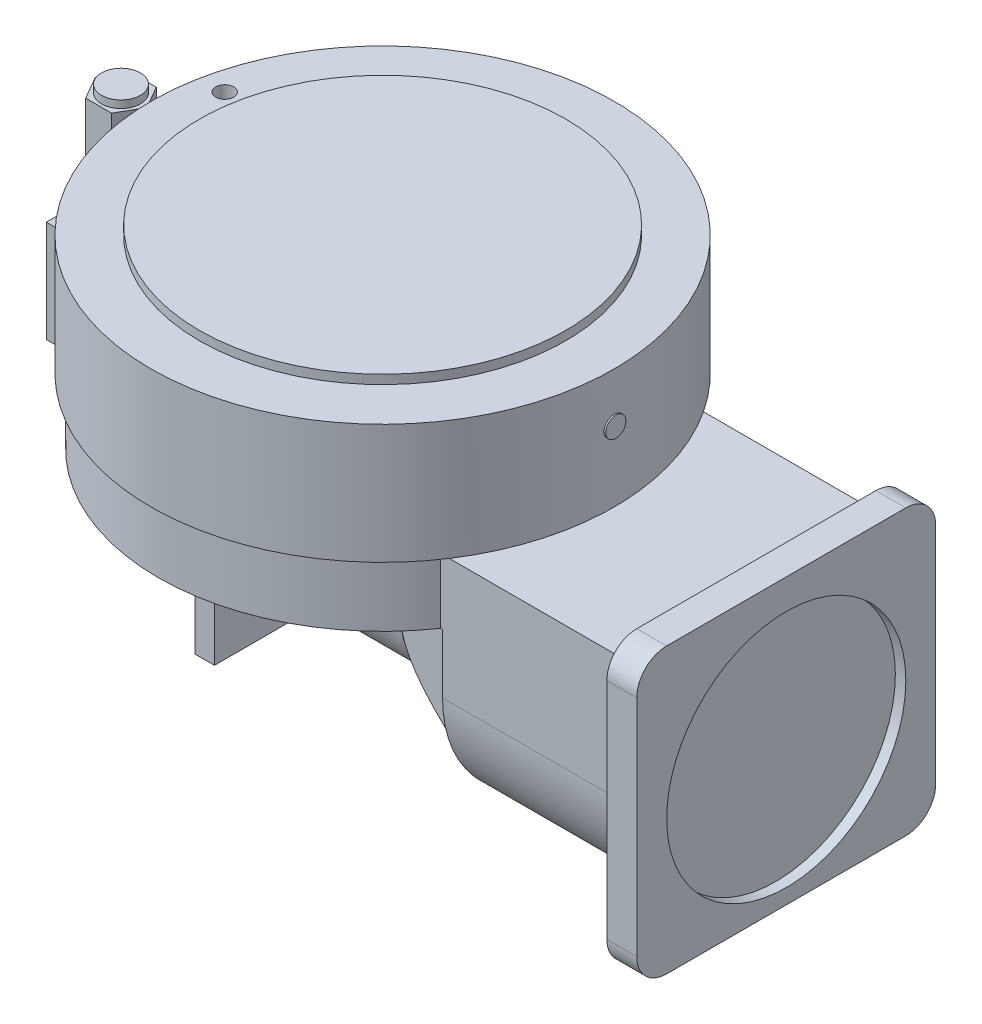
ISO-10303-21;
HEADER;
FILE_DESCRIPTION(('STEP AP214'),'2;1');
FILE_NAME('part.step','',(''),(''),'','','');
FILE_SCHEMA(('AUTOMOTIVE_DESIGN { 1 0 10303 214 1 1 1 1 }'));
ENDSEC;
DATA;
#1=APPLICATION_CONTEXT('core data for automotive mechanical design processes');
#2=APPLICATION_PROTOCOL_DEFINITION('international standard','automotive_design',2000,#1);
#3=PRODUCT_CONTEXT('',#1,'mechanical');
#4=PRODUCT('Part','Part','',(#3));
#5=PRODUCT_RELATED_PRODUCT_CATEGORY('part','',(#4));
#6=PRODUCT_DEFINITION_FORMATION('','',#4);
#7=PRODUCT_DEFINITION_CONTEXT('part definition',#1,'design');
#8=PRODUCT_DEFINITION('design','',#6,#7);
#9=PRODUCT_DEFINITION_SHAPE('','',#8);
#10=(LENGTH_UNIT() NAMED_UNIT(*) SI_UNIT(.MILLI.,.METRE.));
#11=(NAMED_UNIT(*) PLANE_ANGLE_UNIT() SI_UNIT($,.RADIAN.));
#12=(NAMED_UNIT(*) SI_UNIT($,.STERADIAN.) SOLID_ANGLE_UNIT());
#13=UNCERTAINTY_MEASURE_WITH_UNIT(LENGTH_MEASURE(1.E-05),#10,'distance_accuracy_value','');
#14=(GEOMETRIC_REPRESENTATION_CONTEXT(3) GLOBAL_UNCERTAINTY_ASSIGNED_CONTEXT((#13)) GLOBAL_UNIT_ASSIGNED_CONTEXT((#10,
#11,#12)) REPRESENTATION_CONTEXT('',''));
#15=CARTESIAN_POINT('',(0.,0.,0.));
#16=DIRECTION('',(0.,0.,1.));
#17=DIRECTION('',(1.,0.,0.));
#18=AXIS2_PLACEMENT_3D('',#15,#16,#17);
#19=CARTESIAN_POINT('',(-473.980762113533,158.,15.));
#20=DIRECTION('',(0.,1.,0.));
#21=DIRECTION('',(0.,0.,1.));
#22=AXIS2_PLACEMENT_3D('',#19,#20,#21);
#23=PLANE('',#22);
#24=DIRECTION('',(-0.5,0.,0.866025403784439));
#25=VECTOR('',#24,1.);
#26=CARTESIAN_POINT('',(-456.660254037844,158.,-15.));
#27=LINE('',#26,#25);
#28=CARTESIAN_POINT('',(-456.660254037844,158.,-15.));
#29=VERTEX_POINT('',#28);
#30=CARTESIAN_POINT('',(-465.320508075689,158.,1.66533453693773E-13));
#31=VERTEX_POINT('',#30);
#32=EDGE_CURVE('E316',#29,#31,#27,.T.);
#33=ORIENTED_EDGE('',*,*,#32,.T.);
#34=DIRECTION('',(0.5,0.,0.866025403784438));
#35=VECTOR('',#34,1.);
#36=CARTESIAN_POINT('',(-465.320508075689,158.,1.66533453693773E-13));
#37=LINE('',#36,#35);
#38=CARTESIAN_POINT('',(-456.660254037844,158.,15.));
#39=VERTEX_POINT('',#38);
#40=EDGE_CURVE('E305',#31,#39,#37,.T.);
#41=ORIENTED_EDGE('',*,*,#40,.T.);
#42=DIRECTION('',(1.,0.,0.));
#43=VECTOR('',#42,1.);
#44=CARTESIAN_POINT('',(-456.660254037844,158.,15.));
#45=LINE('',#44,#43);
#46=CARTESIAN_POINT('',(-439.339745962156,158.,15.));
#47=VERTEX_POINT('',#46);
#48=EDGE_CURVE('E315',#39,#47,#45,.T.);
#49=ORIENTED_EDGE('',*,*,#48,.T.);
#50=DIRECTION('',(0.5,0.,-0.866025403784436));
#51=VECTOR('',#50,1.);
#52=CARTESIAN_POINT('',(-439.339745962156,158.,15.));
#53=LINE('',#52,#51);
#54=CARTESIAN_POINT('',(-430.679491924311,158.,-1.66533453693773E-13));
#55=VERTEX_POINT('',#54);
#56=EDGE_CURVE('E1140',#47,#55,#53,.T.);
#57=ORIENTED_EDGE('',*,*,#56,.T.);
#58=DIRECTION('',(-0.5,0.,-0.866025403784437));
#59=VECTOR('',#58,1.);
#60=CARTESIAN_POINT('',(-430.679491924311,158.,-1.66533453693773E-13));
#61=LINE('',#60,#59);
#62=CARTESIAN_POINT('',(-439.339745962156,158.,-15.));
#63=VERTEX_POINT('',#62);
#64=EDGE_CURVE('E1142',#55,#63,#61,.T.);
#65=ORIENTED_EDGE('',*,*,#64,.T.);
#66=DIRECTION('',(-1.,0.,0.));
#67=VECTOR('',#66,1.);
#68=CARTESIAN_POINT('',(-439.339745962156,158.,-15.));
#69=LINE('',#68,#67);
#70=EDGE_CURVE('E321',#63,#29,#69,.T.);
#71=ORIENTED_EDGE('',*,*,#70,.T.);
#72=EDGE_LOOP('',(#33,#41,#49,#57,#65,#71));
#73=FACE_BOUND('',#72,.T.);
#74=CARTESIAN_POINT('',(-448.,158.,1.66533453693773E-13));
#75=DIRECTION('',(0.,1.,0.));
#76=DIRECTION('',(0.,0.,1.));
#77=AXIS2_PLACEMENT_3D('',#74,#75,#76);
#78=CIRCLE('',#77,13.);
#79=CARTESIAN_POINT('',(-448.,158.,13.0000000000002));
#80=VERTEX_POINT('',#79);
#81=EDGE_CURVE('E1133',#80,#80,#78,.T.);
#82=ORIENTED_EDGE('',*,*,#81,.F.);
#83=EDGE_LOOP('',(#82));
#84=FACE_BOUND('',#83,.T.);
#85=ADVANCED_FACE('F17',(#73,#84),#23,.T.);
#86=CARTESIAN_POINT('',(-273.,83.,85.));
#87=DIRECTION('',(0.,-1.,0.));
#88=DIRECTION('',(0.,0.,-1.));
#89=AXIS2_PLACEMENT_3D('',#86,#87,#88);
#90=PLANE('',#89);
#91=CARTESIAN_POINT('',(-273.,83.,-1.66533453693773E-13));
#92=DIRECTION('',(0.,1.,0.));
#93=DIRECTION('',(0.,0.,1.));
#94=AXIS2_PLACEMENT_3D('',#91,#92,#93);
#95=CIRCLE('',#94,155.);
#96=CARTESIAN_POINT('',(-425.970585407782,83.,-25.));
#97=VERTEX_POINT('',#96);
#98=CARTESIAN_POINT('',(-425.970585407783,83.,25.));
#99=VERTEX_POINT('',#98);
#100=EDGE_CURVE('E958',#97,#99,#95,.T.);
#101=ORIENTED_EDGE('',*,*,#100,.F.);
#102=DIRECTION('',(1.,0.,0.));
#103=VECTOR('',#102,1.);
#104=CARTESIAN_POINT('',(-473.,83.,-25.));
#105=LINE('',#104,#103);
#106=CARTESIAN_POINT('',(-473.,83.,-25.));
#107=VERTEX_POINT('',#106);
#108=EDGE_CURVE('E945',#107,#97,#105,.T.);
#109=ORIENTED_EDGE('',*,*,#108,.F.);
#110=DIRECTION('',(0.,0.,-1.));
#111=VECTOR('',#110,1.);
#112=CARTESIAN_POINT('',(-473.,83.,-52.5));
#113=LINE('',#112,#111);
#114=CARTESIAN_POINT('',(-473.,83.,25.));
#115=VERTEX_POINT('',#114);
#116=EDGE_CURVE('E899',#115,#107,#113,.T.);
#117=ORIENTED_EDGE('',*,*,#116,.F.);
#118=DIRECTION('',(-1.,0.,0.));
#119=VECTOR('',#118,1.);
#120=CARTESIAN_POINT('',(-473.,83.,25.));
#121=LINE('',#120,#119);
#122=EDGE_CURVE('E809',#99,#115,#121,.T.);
#123=ORIENTED_EDGE('',*,*,#122,.F.);
#124=EDGE_LOOP('',(#101,#109,#117,#123));
#125=FACE_BOUND('',#124,.T.);
#126=DIRECTION('',(-0.5,0.,0.866025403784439));
#127=VECTOR('',#126,1.);
#128=CARTESIAN_POINT('',(-456.660254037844,83.,-15.));
#129=LINE('',#128,#127);
#130=CARTESIAN_POINT('',(-456.660254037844,83.,-15.));
#131=VERTEX_POINT('',#130);
#132=CARTESIAN_POINT('',(-465.320508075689,83.,1.66533453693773E-13));
#133=VERTEX_POINT('',#132);
#134=EDGE_CURVE('E328',#131,#133,#129,.T.);
#135=ORIENTED_EDGE('',*,*,#134,.F.);
#136=DIRECTION('',(-1.,0.,0.));
#137=VECTOR('',#136,1.);
#138=CARTESIAN_POINT('',(-439.339745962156,83.,-15.));
#139=LINE('',#138,#137);
#140=CARTESIAN_POINT('',(-439.339745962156,83.,-15.));
#141=VERTEX_POINT('',#140);
#142=EDGE_CURVE('E325',#141,#131,#139,.T.);
#143=ORIENTED_EDGE('',*,*,#142,.F.);
#144=DIRECTION('',(-0.5,0.,-0.866025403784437));
#145=VECTOR('',#144,1.);
#146=CARTESIAN_POINT('',(-430.679491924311,83.,-1.66533453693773E-13));
#147=LINE('',#146,#145);
#148=CARTESIAN_POINT('',(-430.679491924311,83.,-1.66533453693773E-13));
#149=VERTEX_POINT('',#148);
#150=EDGE_CURVE('E1151',#149,#141,#147,.T.);
#151=ORIENTED_EDGE('',*,*,#150,.F.);
#152=DIRECTION('',(0.5,0.,-0.866025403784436));
#153=VECTOR('',#152,1.);
#154=CARTESIAN_POINT('',(-439.339745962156,83.,15.));
#155=LINE('',#154,#153);
#156=CARTESIAN_POINT('',(-439.339745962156,83.,15.));
#157=VERTEX_POINT('',#156);
#158=EDGE_CURVE('E1148',#157,#149,#155,.T.);
#159=ORIENTED_EDGE('',*,*,#158,.F.);
#160=DIRECTION('',(1.,0.,0.));
#161=VECTOR('',#160,1.);
#162=CARTESIAN_POINT('',(-456.660254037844,83.,15.));
#163=LINE('',#162,#161);
#164=CARTESIAN_POINT('',(-456.660254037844,83.,15.));
#165=VERTEX_POINT('',#164);
#166=EDGE_CURVE('E42',#165,#157,#163,.T.);
#167=ORIENTED_EDGE('',*,*,#166,.F.);
#168=DIRECTION('',(0.5,0.,0.866025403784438));
#169=VECTOR('',#168,1.);
#170=CARTESIAN_POINT('',(-465.320508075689,83.,1.66533453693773E-13));
#171=LINE('',#170,#169);
#172=EDGE_CURVE('E37',#133,#165,#171,.T.);
#173=ORIENTED_EDGE('',*,*,#172,.F.);
#174=EDGE_LOOP('',(#135,#143,#151,#159,#167,#173));
#175=FACE_BOUND('',#174,.T.);
#176=ADVANCED_FACE('F654',(#125,#175),#90,.F.);
#177=CARTESIAN_POINT('',(-358.,-29.,-2.22044604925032E-13));
#178=DIRECTION('',(-1.,0.,0.));
#179=DIRECTION('',(0.,0.,1.));
#180=AXIS2_PLACEMENT_3D('',#177,#178,#179);
#181=PLANE('',#180);
#182=CARTESIAN_POINT('',(-358.,-29.,-2.22044604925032E-13));
#183=DIRECTION('',(-1.,0.,0.));
#184=DIRECTION('',(0.,0.,1.));
#185=AXIS2_PLACEMENT_3D('',#182,#183,#184);
#186=CIRCLE('',#185,25.);
#187=CARTESIAN_POINT('',(-358.,-29.,24.9999999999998));
#188=VERTEX_POINT('',#187);
#189=EDGE_CURVE('E377',#188,#188,#186,.T.);
#190=ORIENTED_EDGE('',*,*,#189,.T.);
#191=EDGE_LOOP('',(#190));
#192=FACE_BOUND('',#191,.T.);
#193=DIRECTION('',(0.,1.,0.));
#194=VECTOR('',#193,1.);
#195=CARTESIAN_POINT('',(-358.,-38.237604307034,15.9999999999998));
#196=LINE('',#195,#194);
#197=CARTESIAN_POINT('',(-358.,-38.237604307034,15.9999999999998));
#198=VERTEX_POINT('',#197);
#199=CARTESIAN_POINT('',(-358.,-19.7623956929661,15.9999999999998));
#200=VERTEX_POINT('',#199);
#201=EDGE_CURVE('E332',#198,#200,#196,.T.);
#202=ORIENTED_EDGE('',*,*,#201,.F.);
#203=DIRECTION('',(0.,0.5,0.866025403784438));
#204=VECTOR('',#203,1.);
#205=CARTESIAN_POINT('',(-358.,-47.4752086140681,-2.22044604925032E-13));
#206=LINE('',#205,#204);
#207=CARTESIAN_POINT('',(-358.,-47.4752086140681,-2.22044604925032E-13));
#208=VERTEX_POINT('',#207);
#209=EDGE_CURVE('E329',#208,#198,#206,.T.);
#210=ORIENTED_EDGE('',*,*,#209,.F.);
#211=DIRECTION('',(0.,-0.5,0.866025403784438));
#212=VECTOR('',#211,1.);
#213=CARTESIAN_POINT('',(-358.,-38.237604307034,-16.0000000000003));
#214=LINE('',#213,#212);
#215=CARTESIAN_POINT('',(-358.,-38.237604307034,-16.0000000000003));
#216=VERTEX_POINT('',#215);
#217=EDGE_CURVE('E342',#216,#208,#214,.T.);
#218=ORIENTED_EDGE('',*,*,#217,.F.);
#219=DIRECTION('',(0.,-1.,0.));
#220=VECTOR('',#219,1.);
#221=CARTESIAN_POINT('',(-358.,-19.7623956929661,-16.0000000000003));
#222=LINE('',#221,#220);
#223=CARTESIAN_POINT('',(-358.,-19.7623956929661,-16.0000000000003));
#224=VERTEX_POINT('',#223);
#225=EDGE_CURVE('E358',#224,#216,#222,.T.);
#226=ORIENTED_EDGE('',*,*,#225,.F.);
#227=DIRECTION('',(0.,-0.5,-0.866025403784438));
#228=VECTOR('',#227,1.);
#229=CARTESIAN_POINT('',(-358.,-10.524791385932,-2.22044604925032E-13));
#230=LINE('',#229,#228);
#231=CARTESIAN_POINT('',(-358.,-10.524791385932,-2.22044604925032E-13));
#232=VERTEX_POINT('',#231);
#233=EDGE_CURVE('E356',#232,#224,#230,.T.);
#234=ORIENTED_EDGE('',*,*,#233,.F.);
#235=DIRECTION('',(0.,0.5,-0.866025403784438));
#236=VECTOR('',#235,1.);
#237=CARTESIAN_POINT('',(-358.,-19.7623956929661,15.9999999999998));
#238=LINE('',#237,#236);
#239=EDGE_CURVE('E354',#200,#232,#238,.T.);
#240=ORIENTED_EDGE('',*,*,#239,.F.);
#241=EDGE_LOOP('',(#202,#210,#218,#226,#234,#240));
#242=FACE_BOUND('',#241,.T.);
#243=ADVANCED_FACE('F400',(#192,#242),#181,.T.);
#244=CARTESIAN_POINT('',(-273.,126.294830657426,-1.66533453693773E-13));
#245=DIRECTION('',(0.,-1.,0.));
#246=DIRECTION('',(0.,0.,-1.));
#247=AXIS2_PLACEMENT_3D('',#244,#245,#246);
#248=CYLINDRICAL_SURFACE('',#247,90.);
#249=CARTESIAN_POINT('',(-360.926105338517,-45.,-19.2093727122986));
#250=CARTESIAN_POINT('',(-360.975259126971,-45.2701186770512,-18.9843818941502));
#251=CARTESIAN_POINT('',(-361.024740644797,-45.5354242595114,-18.7537518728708));
#252=CARTESIAN_POINT('',(-361.124022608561,-46.0560448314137,-18.2815448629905));
#253=CARTESIAN_POINT('',(-361.17382305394,-46.3113598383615,-18.0399678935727));
#254=CARTESIAN_POINT('',(-361.323180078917,-47.0616825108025,-17.2994025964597));
#255=CARTESIAN_POINT('',(-361.422710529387,-47.541166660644,-16.7844975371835));
#256=CARTESIAN_POINT('',(-361.618956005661,-48.4555659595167,-15.7154764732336));
#257=CARTESIAN_POINT('',(-361.715668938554,-48.890448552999,-15.1613323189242));
#258=CARTESIAN_POINT('',(-361.903543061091,-49.712315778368,-14.0176931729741));
#259=CARTESIAN_POINT('',(-361.994704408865,-50.0993017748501,-13.4281991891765));
#260=CARTESIAN_POINT('',(-362.169034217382,-50.8229274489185,-12.2171169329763));
#261=CARTESIAN_POINT('',(-362.252194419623,-51.159515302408,-11.595496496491));
#262=CARTESIAN_POINT('',(-362.408087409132,-51.7792909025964,-10.3248980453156));
#263=CARTESIAN_POINT('',(-362.480820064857,-52.0624779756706,-9.67591968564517));
#264=CARTESIAN_POINT('',(-362.613746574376,-52.5729570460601,-8.35561382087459));
#265=CARTESIAN_POINT('',(-362.673949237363,-52.8002883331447,-7.68430240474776));
#266=CARTESIAN_POINT('',(-362.780151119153,-53.1973588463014,-6.32376188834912));
#267=CARTESIAN_POINT('',(-362.826150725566,-53.3670996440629,-5.63453327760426));
#268=CARTESIAN_POINT('',(-362.901785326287,-53.6444398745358,-4.25835451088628));
#269=CARTESIAN_POINT('',(-362.931752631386,-53.7533034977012,-3.57167727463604));
#270=CARTESIAN_POINT('',(-362.975973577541,-53.9134857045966,-2.19113890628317));
#271=CARTESIAN_POINT('',(-362.990227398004,-53.9648049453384,-1.49727785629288));
#272=CARTESIAN_POINT('',(-363.002618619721,-54.0094345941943,-0.107521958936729));
#273=CARTESIAN_POINT('',(-363.00075538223,-54.0027427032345,0.588372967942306));
#274=CARTESIAN_POINT('',(-362.980963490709,-53.931405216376,1.9769479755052));
#275=CARTESIAN_POINT('',(-362.963035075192,-53.8667604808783,2.66962810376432));
#276=CARTESIAN_POINT('',(-362.912250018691,-53.6823888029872,4.02978170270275));
#277=CARTESIAN_POINT('',(-362.879768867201,-53.5640464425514,4.6974575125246));
#278=CARTESIAN_POINT('',(-362.800869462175,-53.2737646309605,6.02020125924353));
#279=CARTESIAN_POINT('',(-362.754451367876,-53.1018257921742,6.67526934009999));
#280=CARTESIAN_POINT('',(-362.648884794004,-52.7056738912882,7.96860221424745));
#281=CARTESIAN_POINT('',(-362.589731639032,-52.4814416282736,8.60686073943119));
#282=CARTESIAN_POINT('',(-362.460251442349,-51.9824846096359,9.86212836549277));
#283=CARTESIAN_POINT('',(-362.389924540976,-51.707760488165,10.4791377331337));
#284=CARTESIAN_POINT('',(-362.238741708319,-51.1051888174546,11.697419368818));
#285=CARTESIAN_POINT('',(-362.157738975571,-50.7765811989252,12.2982973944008));
#286=CARTESIAN_POINT('',(-361.988197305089,-50.0716931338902,13.4703926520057));
#287=CARTESIAN_POINT('',(-361.899657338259,-49.695406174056,14.0416058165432));
#288=CARTESIAN_POINT('',(-361.717485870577,-48.8983071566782,15.1500100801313));
#289=CARTESIAN_POINT('',(-361.623861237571,-48.4775544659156,15.6872450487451));
#290=CARTESIAN_POINT('',(-361.433877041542,-47.593992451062,16.7250568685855));
#291=CARTESIAN_POINT('',(-361.337518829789,-47.1312036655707,17.2256514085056));
#292=CARTESIAN_POINT('',(-361.188317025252,-46.385223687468,17.9692142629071));
#293=CARTESIAN_POINT('',(-361.135551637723,-46.1157349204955,18.2260857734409));
#294=CARTESIAN_POINT('',(-361.030437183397,-45.5659458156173,18.7271871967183));
#295=CARTESIAN_POINT('',(-360.978087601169,-45.2856627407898,18.9714359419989));
#296=CARTESIAN_POINT('',(-360.926105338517,-45.,19.2093727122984));
#297=B_SPLINE_CURVE_WITH_KNOTS('',3,(#249,#250,#251,#252,#253,#254,#255,#256,#257,#258,#259,
#260,#261,#262,#263,#264,#265,#266,#267,#268,#269,#270,#271,#272,#273,#274,#275,#276,#277,#278,
#279,#280,#281,#282,#283,#284,#285,#286,#287,#288,#289,#290,#291,#292,#293,#294,#295,#296),
.UNSPECIFIED.,.F.,.F.,(4,2,2,2,2,2,2,2,2,2,2,2,2,2,2,2,2,2,2,2,2,2,2,4),(0.,1.06473590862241,
2.12946995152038,4.25854950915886,6.38917222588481,8.51973422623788,10.6524722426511,
12.7852371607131,14.9164975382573,17.0476997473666,19.1328239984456,21.2179244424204,
23.3031075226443,25.3882596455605,27.422459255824,29.4566356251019,31.4915600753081,
33.5264589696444,35.5930201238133,37.659863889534,39.7239822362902,41.7870974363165,
42.9148326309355,44.0408336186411),.UNSPECIFIED.);
#298=CARTESIAN_POINT('',(-360.926105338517,-45.,-19.2093727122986));
#299=VERTEX_POINT('',#298);
#300=CARTESIAN_POINT('',(-360.926105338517,-45.,19.2093727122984));
#301=VERTEX_POINT('',#300);
#302=EDGE_CURVE('E380',#299,#301,#297,.T.);
#303=ORIENTED_EDGE('',*,*,#302,.F.);
#304=CARTESIAN_POINT('',(-273.,-45.,-1.66533453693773E-13));
#305=DIRECTION('',(0.,-1.,0.));
#306=DIRECTION('',(0.,0.,-1.));
#307=AXIS2_PLACEMENT_3D('',#304,#305,#306);
#308=CIRCLE('',#307,90.);
#309=CARTESIAN_POINT('',(-346.100957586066,-45.,-52.5));
#310=VERTEX_POINT('',#309);
#311=EDGE_CURVE('E746',#299,#310,#308,.T.);
#312=ORIENTED_EDGE('',*,*,#311,.T.);
#313=DIRECTION('',(0.,-1.,0.));
#314=VECTOR('',#313,1.);
#315=CARTESIAN_POINT('',(-346.100957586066,126.294830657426,-52.5));
#316=LINE('',#315,#314);
#317=CARTESIAN_POINT('',(-346.100957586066,-90.,-52.5));
#318=VERTEX_POINT('',#317);
#319=EDGE_CURVE('E938',#310,#318,#316,.T.);
#320=ORIENTED_EDGE('',*,*,#319,.T.);
#321=CARTESIAN_POINT('',(-273.,-90.,-1.66533453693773E-13));
#322=DIRECTION('',(0.,1.,0.));
#323=DIRECTION('',(0.,0.,-1.));
#324=AXIS2_PLACEMENT_3D('',#321,#322,#323);
#325=CIRCLE('',#324,90.);
#326=CARTESIAN_POINT('',(-346.100957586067,-90.,52.5));
#327=VERTEX_POINT('',#326);
#328=EDGE_CURVE('E937',#318,#327,#325,.T.);
#329=ORIENTED_EDGE('',*,*,#328,.T.);
#330=DIRECTION('',(0.,-1.,0.));
#331=VECTOR('',#330,1.);
#332=CARTESIAN_POINT('',(-346.100957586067,126.294830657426,52.5));
#333=LINE('',#332,#331);
#334=CARTESIAN_POINT('',(-346.100957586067,-45.,52.5));
#335=VERTEX_POINT('',#334);
#336=EDGE_CURVE('E749',#335,#327,#333,.T.);
#337=ORIENTED_EDGE('',*,*,#336,.F.);
#338=EDGE_CURVE('E744',#335,#301,#308,.T.);
#339=ORIENTED_EDGE('',*,*,#338,.T.);
#340=EDGE_LOOP('',(#303,#312,#320,#329,#337,#339));
#341=FACE_BOUND('',#340,.T.);
#342=ADVANCED_FACE('F389',(#341),#248,.T.);
#343=CARTESIAN_POINT('',(-273.,-45.,-1.66533453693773E-13));
#344=DIRECTION('',(0.,-1.,0.));
#345=DIRECTION('',(0.,0.,-1.));
#346=AXIS2_PLACEMENT_3D('',#343,#344,#345);
#347=TOROIDAL_SURFACE('',#346,150.,60.);
#348=CARTESIAN_POINT('',(-362.052570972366,-49.5851433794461,14.1863269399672));
#349=CARTESIAN_POINT('',(-361.934577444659,-49.2028681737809,14.7410519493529));
#350=CARTESIAN_POINT('',(-361.815573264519,-48.7982364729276,15.2801838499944));
#351=CARTESIAN_POINT('',(-361.580756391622,-47.9462545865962,16.3246324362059));
#352=CARTESIAN_POINT('',(-361.464944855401,-47.4988891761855,16.8299369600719));
#353=CARTESIAN_POINT('',(-361.241130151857,-46.5608280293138,17.8067027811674));
#354=CARTESIAN_POINT('',(-361.133179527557,-46.0698821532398,18.2779362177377));
#355=CARTESIAN_POINT('',(-360.931515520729,-45.0495542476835,19.1800793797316));
#356=CARTESIAN_POINT('',(-360.837800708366,-44.5201760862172,19.6109931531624));
#357=CARTESIAN_POINT('',(-360.669994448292,-43.4238528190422,20.4309241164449));
#358=CARTESIAN_POINT('',(-360.595975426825,-42.8567783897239,20.8197836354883));
#359=CARTESIAN_POINT('',(-360.473699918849,-41.6904065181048,21.5505712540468));
#360=CARTESIAN_POINT('',(-360.42544409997,-41.0911082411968,21.8924981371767));
#361=CARTESIAN_POINT('',(-360.360127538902,-39.8668226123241,22.5252169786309));
#362=CARTESIAN_POINT('',(-360.342967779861,-39.2419233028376,22.8161685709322));
#363=CARTESIAN_POINT('',(-360.344088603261,-37.9702455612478,23.3454233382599));
#364=CARTESIAN_POINT('',(-360.362364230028,-37.3234702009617,23.5837338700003));
#365=CARTESIAN_POINT('',(-360.434162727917,-36.0761323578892,23.9857563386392));
#366=CARTESIAN_POINT('',(-360.484207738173,-35.4769468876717,24.1543772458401));
#367=CARTESIAN_POINT('',(-360.617567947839,-34.2712052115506,24.4458380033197));
#368=CARTESIAN_POINT('',(-360.700880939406,-33.6646494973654,24.5686808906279));
#369=CARTESIAN_POINT('',(-360.90113664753,-32.4492687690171,24.7685700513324));
#370=CARTESIAN_POINT('',(-361.018095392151,-31.8404428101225,24.8455944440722));
#371=CARTESIAN_POINT('',(-361.284822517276,-30.6259803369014,24.9545166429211));
#372=CARTESIAN_POINT('',(-361.434590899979,-30.0203438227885,24.9864144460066));
#373=CARTESIAN_POINT('',(-361.753878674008,-28.8579539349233,25.0058875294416));
#374=CARTESIAN_POINT('',(-361.921357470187,-28.3006811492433,24.9963342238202));
#375=CARTESIAN_POINT('',(-362.28122641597,-27.1961596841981,24.9409684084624));
#376=CARTESIAN_POINT('',(-362.473614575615,-26.6489102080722,24.895158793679));
#377=CARTESIAN_POINT('',(-362.880979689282,-25.566850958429,24.7691400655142));
#378=CARTESIAN_POINT('',(-363.095961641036,-25.0320439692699,24.6889233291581));
#379=CARTESIAN_POINT('',(-363.545974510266,-23.9768104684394,24.4960266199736));
#380=CARTESIAN_POINT('',(-363.781009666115,-23.4563870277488,24.3833397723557));
#381=CARTESIAN_POINT('',(-364.198786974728,-22.5779619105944,24.1640179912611));
#382=CARTESIAN_POINT('',(-364.377282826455,-22.2160385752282,24.0648533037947));
#383=CARTESIAN_POINT('',(-364.74215331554,-21.5007641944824,23.8516394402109));
#384=CARTESIAN_POINT('',(-364.928526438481,-21.1474115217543,23.7375931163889));
#385=CARTESIAN_POINT('',(-365.498283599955,-20.1002609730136,23.3739359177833));
#386=CARTESIAN_POINT('',(-365.892231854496,-19.4195239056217,23.1028455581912));
#387=CARTESIAN_POINT('',(-366.701663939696,-18.0936082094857,22.5073314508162));
#388=CARTESIAN_POINT('',(-367.117184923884,-17.448495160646,22.1828134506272));
#389=CARTESIAN_POINT('',(-367.962468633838,-16.195772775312,21.4840883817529));
#390=CARTESIAN_POINT('',(-368.39222996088,-15.5881597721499,21.1098861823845));
#391=CARTESIAN_POINT('',(-369.267907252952,-14.3996695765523,20.3065173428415));
#392=CARTESIAN_POINT('',(-369.713975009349,-13.8195205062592,19.8764408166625));
#393=CARTESIAN_POINT('',(-370.607718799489,-12.6991505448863,18.968454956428));
#394=CARTESIAN_POINT('',(-371.055394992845,-12.1589337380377,18.4905407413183));
#395=CARTESIAN_POINT('',(-371.945115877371,-11.119862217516,17.4877581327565));
#396=CARTESIAN_POINT('',(-372.387164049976,-10.6209807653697,16.962920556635));
#397=CARTESIAN_POINT('',(-373.258336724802,-9.6659862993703,15.865834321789));
#398=CARTESIAN_POINT('',(-373.68746414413,-9.2098635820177,15.2935964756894));
#399=CARTESIAN_POINT('',(-374.435187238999,-8.43525714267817,14.227723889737));
#400=CARTESIAN_POINT('',(-374.757886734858,-8.10812692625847,13.7432407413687));
#401=CARTESIAN_POINT('',(-375.38500059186,-7.48395250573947,12.7438933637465));
#402=CARTESIAN_POINT('',(-375.68941494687,-7.18690831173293,12.2290291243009));
#403=CARTESIAN_POINT('',(-376.273910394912,-6.62575653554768,11.1692488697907));
#404=CARTESIAN_POINT('',(-376.554022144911,-6.36160726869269,10.6243721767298));
#405=CARTESIAN_POINT('',(-376.951187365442,-5.99228272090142,9.78460163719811));
#406=CARTESIAN_POINT('',(-377.079732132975,-5.87366666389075,9.50096049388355));
#407=CARTESIAN_POINT('',(-377.328322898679,-5.64579496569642,8.92618124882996));
#408=CARTESIAN_POINT('',(-377.448366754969,-5.53654168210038,8.63504128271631));
#409=CARTESIAN_POINT('',(-377.739441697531,-5.27322761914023,7.89096708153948));
#410=CARTESIAN_POINT('',(-377.904215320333,-5.12569871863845,7.43321876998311));
#411=CARTESIAN_POINT('',(-378.208238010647,-4.85552997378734,6.50226120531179));
#412=CARTESIAN_POINT('',(-378.347493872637,-4.73288350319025,6.02905610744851));
#413=CARTESIAN_POINT('',(-378.596991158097,-4.51443260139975,5.0694038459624));
#414=CARTESIAN_POINT('',(-378.707259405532,-4.41860334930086,4.58296938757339));
#415=CARTESIAN_POINT('',(-378.89581375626,-4.2554158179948,3.5991828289));
#416=CARTESIAN_POINT('',(-378.974099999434,-4.18805741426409,3.10183077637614));
#417=CARTESIAN_POINT('',(-379.096634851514,-4.08286946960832,2.09617836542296));
#418=CARTESIAN_POINT('',(-379.14063737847,-4.04525338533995,1.58782529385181));
#419=CARTESIAN_POINT('',(-379.192143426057,-4.00124013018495,0.567908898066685));
#420=CARTESIAN_POINT('',(-379.199647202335,-3.99484274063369,0.0563455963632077));
#421=CARTESIAN_POINT('',(-379.177886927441,-4.01342309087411,-0.965474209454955));
#422=CARTESIAN_POINT('',(-379.148618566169,-4.03840450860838,-1.47573055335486));
#423=CARTESIAN_POINT('',(-379.05434140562,-4.11914833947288,-2.49043408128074));
#424=CARTESIAN_POINT('',(-378.989333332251,-4.17491012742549,-2.99488138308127));
#425=CARTESIAN_POINT('',(-378.833753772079,-4.3090612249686,-3.94524154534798));
#426=CARTESIAN_POINT('',(-378.746296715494,-4.38471074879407,-4.39206192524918));
#427=CARTESIAN_POINT('',(-378.546199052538,-4.55883546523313,-5.27563386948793));
#428=CARTESIAN_POINT('',(-378.433549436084,-4.65731882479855,-5.71238176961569));
#429=CARTESIAN_POINT('',(-378.185562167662,-4.87570573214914,-6.57388256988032));
#430=CARTESIAN_POINT('',(-378.050223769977,-4.99560998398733,-6.99863507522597));
#431=CARTESIAN_POINT('',(-377.759443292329,-5.25542157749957,-7.8349758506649));
#432=CARTESIAN_POINT('',(-377.603996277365,-5.39533383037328,-8.24656085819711));
#433=CARTESIAN_POINT('',(-377.184558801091,-5.77649295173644,-9.2799685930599));
#434=CARTESIAN_POINT('',(-376.908145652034,-6.03093687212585,-9.89193634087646));
#435=CARTESIAN_POINT('',(-376.321948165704,-6.58023769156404,-11.0807727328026));
#436=CARTESIAN_POINT('',(-376.012148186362,-6.87511355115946,-11.6576247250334));
#437=CARTESIAN_POINT('',(-375.366255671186,-7.5023297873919,-12.7774433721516));
#438=CARTESIAN_POINT('',(-375.030096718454,-7.83476579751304,-13.3203178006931));
#439=CARTESIAN_POINT('',(-374.339004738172,-8.53356994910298,-14.370917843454));
#440=CARTESIAN_POINT('',(-373.984072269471,-8.89993708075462,-14.8786445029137));
#441=CARTESIAN_POINT('',(-373.142791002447,-9.78978846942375,-16.0202861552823));
#442=CARTESIAN_POINT('',(-372.651464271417,-10.3254398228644,-16.6410869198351));
#443=CARTESIAN_POINT('',(-371.657387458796,-11.4497816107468,-17.8228858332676));
#444=CARTESIAN_POINT('',(-371.154633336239,-12.0384910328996,-18.3838624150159));
#445=CARTESIAN_POINT('',(-370.148070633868,-13.2668806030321,-19.4455081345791));
#446=CARTESIAN_POINT('',(-369.64426227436,-13.9065509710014,-19.9461887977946));
#447=CARTESIAN_POINT('',(-368.645153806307,-15.2358172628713,-20.8856258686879));
#448=CARTESIAN_POINT('',(-368.149851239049,-15.9253984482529,-21.3244004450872));
#449=CARTESIAN_POINT('',(-367.26541488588,-17.2243247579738,-22.0632243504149));
#450=CARTESIAN_POINT('',(-366.873308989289,-17.8255599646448,-22.3740033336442));
#451=CARTESIAN_POINT('',(-366.106599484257,-19.0605739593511,-22.9493312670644));
#452=CARTESIAN_POINT('',(-365.731995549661,-19.6943521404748,-23.2138810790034));
#453=CARTESIAN_POINT('',(-365.00672622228,-20.9923309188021,-23.692931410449));
#454=CARTESIAN_POINT('',(-364.656022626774,-21.6564799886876,-23.9075131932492));
#455=CARTESIAN_POINT('',(-363.984071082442,-23.014221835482,-24.2830440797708));
#456=CARTESIAN_POINT('',(-363.66281619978,-23.7078076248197,-24.4440058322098));
#457=CARTESIAN_POINT('',(-363.117759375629,-24.9774987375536,-24.6809146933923));
#458=CARTESIAN_POINT('',(-362.887421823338,-25.548827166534,-24.7674918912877));
#459=CARTESIAN_POINT('',(-362.452565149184,-26.7057650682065,-24.9013141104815));
#460=CARTESIAN_POINT('',(-362.248042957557,-27.2913728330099,-24.9485638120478));
#461=CARTESIAN_POINT('',(-361.86778911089,-28.4734230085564,-25.0014498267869));
#462=CARTESIAN_POINT('',(-361.692042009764,-29.0698594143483,-25.007108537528));
#463=CARTESIAN_POINT('',(-361.371587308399,-30.2699203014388,-24.974938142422));
#464=CARTESIAN_POINT('',(-361.226879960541,-30.8735448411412,-24.9371086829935));
#465=CARTESIAN_POINT('',(-360.969517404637,-32.0862544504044,-24.8162871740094));
#466=CARTESIAN_POINT('',(-360.857022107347,-32.6953517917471,-24.7330755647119));
#467=CARTESIAN_POINT('',(-360.665696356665,-33.9108331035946,-24.5206916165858));
#468=CARTESIAN_POINT('',(-360.586866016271,-34.517217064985,-24.3915191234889));
#469=CARTESIAN_POINT('',(-360.462411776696,-35.7217508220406,-24.0874213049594));
#470=CARTESIAN_POINT('',(-360.416782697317,-36.3199018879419,-23.9125031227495));
#471=CARTESIAN_POINT('',(-360.357114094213,-37.5028178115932,-23.5178831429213));
#472=CARTESIAN_POINT('',(-360.343073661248,-38.0875830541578,-23.298182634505));
#473=CARTESIAN_POINT('',(-360.343945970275,-39.198204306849,-22.8327217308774));
#474=CARTESIAN_POINT('',(-360.356881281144,-39.7253017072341,-22.5899032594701));
#475=CARTESIAN_POINT('',(-360.405092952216,-40.7604783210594,-22.0686871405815));
#476=CARTESIAN_POINT('',(-360.440368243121,-41.268558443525,-21.7902911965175));
#477=CARTESIAN_POINT('',(-360.530241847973,-42.2635289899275,-21.1993879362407));
#478=CARTESIAN_POINT('',(-360.584864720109,-42.7503915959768,-20.8868376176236));
#479=CARTESIAN_POINT('',(-360.710106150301,-43.6999039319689,-20.2298339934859));
#480=CARTESIAN_POINT('',(-360.780725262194,-44.1625528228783,-19.8853795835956));
#481=CARTESIAN_POINT('',(-360.939658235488,-45.091581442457,-19.1425662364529));
#482=CARTESIAN_POINT('',(-361.02883626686,-45.5561649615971,-18.7421461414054));
#483=CARTESIAN_POINT('',(-361.217369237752,-46.4536189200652,-17.9093831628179));
#484=CARTESIAN_POINT('',(-361.316725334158,-46.8864857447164,-17.4770366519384));
#485=CARTESIAN_POINT('',(-361.521218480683,-47.71740876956,-16.5840101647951));
#486=CARTESIAN_POINT('',(-361.626336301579,-48.1155704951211,-16.1234238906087));
#487=CARTESIAN_POINT('',(-361.838763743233,-48.8769310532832,-15.1748959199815));
#488=CARTESIAN_POINT('',(-361.946072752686,-49.2401394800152,-14.6869617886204));
#489=CARTESIAN_POINT('',(-362.052570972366,-49.5851433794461,-14.1863269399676));
#490=B_SPLINE_CURVE_WITH_KNOTS('',3,(#348,#349,#350,#351,#352,#353,#354,#355,#356,#357,#358,
#359,#360,#361,#362,#363,#364,#365,#366,#367,#368,#369,#370,#371,#372,#373,#374,#375,#376,#377,
#378,#379,#380,#381,#382,#383,#384,#385,#386,#387,#388,#389,#390,#391,#392,#393,#394,#395,#396,
#397,#398,#399,#400,#401,#402,#403,#404,#405,#406,#407,#408,#409,#410,#411,#412,#413,#414,#415,
#416,#417,#418,#419,#420,#421,#422,#423,#424,#425,#426,#427,#428,#429,#430,#431,#432,#433,#434,
#435,#436,#437,#438,#439,#440,#441,#442,#443,#444,#445,#446,#447,#448,#449,#450,#451,#452,#453,
#454,#455,#456,#457,#458,#459,#460,#461,#462,#463,#464,#465,#466,#467,#468,#469,#470,#471,#472,
#473,#474,#475,#476,#477,#478,#479,#480,#481,#482,#483,#484,#485,#486,#487,#488,#489),
.UNSPECIFIED.,.F.,.F.,(4,2,2,2,2,2,2,2,2,2,2,2,2,2,2,2,2,2,2,2,2,2,2,2,2,2,2,2,2,2,2,2,2,2,2,2,
2,2,2,2,2,2,2,2,2,2,2,2,2,2,2,2,2,2,2,2,2,2,2,2,2,2,2,2,2,2,2,2,2,2,4),(0.,2.05132688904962,
4.10338735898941,6.1680993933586,8.23260391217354,10.3045983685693,12.3766465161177,
14.4420851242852,16.5072348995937,18.3780931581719,20.2488272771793,22.120454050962,
23.9920809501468,25.736204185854,27.4801881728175,29.2245587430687,30.9692989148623,
32.2155287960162,33.4615201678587,35.9540243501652,38.4509736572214,40.947678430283,
43.4918603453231,46.0363021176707,48.5790849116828,51.1212892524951,53.1230491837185,
55.1248097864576,57.124007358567,58.123437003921,59.1231175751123,60.6468125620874,
62.1701012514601,63.6919753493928,65.2138427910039,66.7465357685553,68.2792180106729,
69.812079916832,71.3449106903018,72.7281295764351,74.1118439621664,75.4956038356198,
76.8797039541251,79.0306217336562,81.1825516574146,83.3400897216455,85.4975635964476,
88.3614433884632,91.2263521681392,94.0907124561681,96.9542303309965,99.2987544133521,
101.643234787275,103.98387526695,106.323963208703,108.188394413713,110.052603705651,
111.91580901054,113.779029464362,115.651345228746,117.523667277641,119.395697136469,
121.267673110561,123.007257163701,124.746757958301,126.488474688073,128.230251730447,
130.087807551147,131.945574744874,133.797480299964,135.648876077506),.UNSPECIFIED.);
#491=EDGE_CURVE('E11',#301,#299,#490,.T.);
#492=ORIENTED_EDGE('',*,*,#491,.F.);
#493=ORIENTED_EDGE('',*,*,#338,.F.);
#494=CARTESIAN_POINT('',(-413.512454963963,15.,52.5));
#495=CARTESIAN_POINT('',(-412.517781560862,15.00001043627,52.5));
#496=CARTESIAN_POINT('',(-411.523132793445,14.9782956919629,52.5));
#497=CARTESIAN_POINT('',(-409.535743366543,14.8918397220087,52.5));
#498=CARTESIAN_POINT('',(-408.543002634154,14.8271001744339,52.5));
#499=CARTESIAN_POINT('',(-406.561486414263,14.655042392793,52.5));
#500=CARTESIAN_POINT('',(-405.572709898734,14.5477360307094,52.5));
#501=CARTESIAN_POINT('',(-403.600692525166,14.2910664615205,52.5));
#502=CARTESIAN_POINT('',(-402.617451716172,14.1417028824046,52.5));
#503=CARTESIAN_POINT('',(-399.682194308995,13.6319282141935,52.5));
#504=CARTESIAN_POINT('',(-397.740580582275,13.2094772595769,52.5));
#505=CARTESIAN_POINT('',(-393.899612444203,12.2039550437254,52.5));
#506=CARTESIAN_POINT('',(-392.000260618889,11.6208739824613,52.5));
#507=CARTESIAN_POINT('',(-388.257725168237,10.2999731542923,52.5));
#508=CARTESIAN_POINT('',(-386.414500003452,9.56227117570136,52.5));
#509=CARTESIAN_POINT('',(-382.795098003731,7.93759625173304,52.5));
#510=CARTESIAN_POINT('',(-381.018920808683,7.05062410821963,52.5));
#511=CARTESIAN_POINT('',(-377.543819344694,5.13223598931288,52.5));
#512=CARTESIAN_POINT('',(-375.844980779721,4.10066469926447,52.5));
#513=CARTESIAN_POINT('',(-372.538957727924,1.89976057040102,52.5));
#514=CARTESIAN_POINT('',(-370.931773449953,0.730427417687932,52.5));
#515=CARTESIAN_POINT('',(-367.792070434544,-1.76376668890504,52.5));
#516=CARTESIAN_POINT('',(-366.261578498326,-3.09118332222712,52.5));
#517=CARTESIAN_POINT('',(-363.323826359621,-5.87658262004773,52.5));
#518=CARTESIAN_POINT('',(-361.916580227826,-7.33458015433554,52.5));
#519=CARTESIAN_POINT('',(-359.243376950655,-10.3723604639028,52.5));
#520=CARTESIAN_POINT('',(-357.97727460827,-11.9520152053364,52.5));
#521=CARTESIAN_POINT('',(-355.603462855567,-15.2259086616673,52.5));
#522=CARTESIAN_POINT('',(-354.495692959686,-16.9201032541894,52.5));
#523=CARTESIAN_POINT('',(-352.720945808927,-19.963189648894,52.5));
#524=CARTESIAN_POINT('',(-352.013879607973,-21.288811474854,52.5));
#525=CARTESIAN_POINT('',(-350.707169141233,-23.992076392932,52.5));
#526=CARTESIAN_POINT('',(-350.107517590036,-25.3697159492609,52.5));
#527=CARTESIAN_POINT('',(-349.025841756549,-28.1671452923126,52.5));
#528=CARTESIAN_POINT('',(-348.543550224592,-29.5868308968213,52.5));
#529=CARTESIAN_POINT('',(-347.913464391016,-31.7430466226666,52.5));
#530=CARTESIAN_POINT('',(-347.718999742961,-32.4662062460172,52.5));
#531=CARTESIAN_POINT('',(-347.362033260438,-33.9203485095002,52.5));
#532=CARTESIAN_POINT('',(-347.199528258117,-34.6513303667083,52.5));
#533=CARTESIAN_POINT('',(-346.896094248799,-36.1761588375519,52.5));
#534=CARTESIAN_POINT('',(-346.757776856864,-36.9705261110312,52.5));
#535=CARTESIAN_POINT('',(-346.520009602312,-38.5649758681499,52.5));
#536=CARTESIAN_POINT('',(-346.420555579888,-39.3650577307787,52.5));
#537=CARTESIAN_POINT('',(-346.261077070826,-40.9698372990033,52.5));
#538=CARTESIAN_POINT('',(-346.201086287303,-41.7745383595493,52.5));
#539=CARTESIAN_POINT('',(-346.12099731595,-43.3861553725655,52.5));
#540=CARTESIAN_POINT('',(-346.100910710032,-44.1930719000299,52.5));
#541=CARTESIAN_POINT('',(-346.100957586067,-45.,52.5));
#542=B_SPLINE_CURVE_WITH_KNOTS('',3,(#494,#495,#496,#497,#498,#499,#500,#501,#502,#503,#504,
#505,#506,#507,#508,#509,#510,#511,#512,#513,#514,#515,#516,#517,#518,#519,#520,#521,#522,#523,
#524,#525,#526,#527,#528,#529,#530,#531,#532,#533,#534,#535,#536,#537,#538,#539,#540,#541),
.UNSPECIFIED.,.F.,.F.,(4,2,2,2,2,2,2,2,2,2,2,2,2,2,2,2,2,2,2,2,2,2,2,4),(0.,2.9837428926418,
5.96736941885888,8.95016438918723,11.9329857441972,17.8864348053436,23.8402471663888,
29.7895403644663,35.7388016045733,41.6945026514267,47.6502172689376,53.7203143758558,
59.7911035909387,65.8555889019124,71.9177512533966,76.4206360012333,80.9232152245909,
85.4154432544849,87.6613935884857,89.9071211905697,92.3251316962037,94.7428833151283,
97.1626971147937,99.5832131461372),.UNSPECIFIED.);
#543=CARTESIAN_POINT('',(-413.512454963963,15.,52.5));
#544=VERTEX_POINT('',#543);
#545=EDGE_CURVE('E762',#544,#335,#542,.T.);
#546=ORIENTED_EDGE('',*,*,#545,.F.);
#547=CARTESIAN_POINT('',(-273.,15.,-1.66533453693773E-13));
#548=DIRECTION('',(0.,-1.,0.));
#549=DIRECTION('',(0.,0.,-1.));
#550=AXIS2_PLACEMENT_3D('',#547,#548,#549);
#551=CIRCLE('',#550,150.);
#552=CARTESIAN_POINT('',(-420.90199457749,15.,24.9999999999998));
#553=VERTEX_POINT('',#552);
#554=EDGE_CURVE('E864',#553,#544,#551,.F.);
#555=ORIENTED_EDGE('',*,*,#554,.F.);
#556=CARTESIAN_POINT('',(-273.,15.,-1.66533453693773E-13));
#557=DIRECTION('',(0.,-1.,0.));
#558=DIRECTION('',(0.,0.,-1.));
#559=AXIS2_PLACEMENT_3D('',#556,#557,#558);
#560=CIRCLE('',#559,150.);
#561=CARTESIAN_POINT('',(-420.90199457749,15.,-24.9999999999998));
#562=VERTEX_POINT('',#561);
#563=EDGE_CURVE('E750',#562,#553,#560,.F.);
#564=ORIENTED_EDGE('',*,*,#563,.F.);
#565=CARTESIAN_POINT('',(-273.,15.,-1.66533453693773E-13));
#566=DIRECTION('',(0.,-1.,0.));
#567=DIRECTION('',(0.,0.,-1.));
#568=AXIS2_PLACEMENT_3D('',#565,#566,#567);
#569=CIRCLE('',#568,150.);
#570=CARTESIAN_POINT('',(-413.512454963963,15.,-52.5));
#571=VERTEX_POINT('',#570);
#572=EDGE_CURVE('E754',#571,#562,#569,.F.);
#573=ORIENTED_EDGE('',*,*,#572,.F.);
#574=CARTESIAN_POINT('',(-346.100957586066,-45.,-52.5));
#575=CARTESIAN_POINT('',(-346.100922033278,-44.2476470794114,-52.5));
#576=CARTESIAN_POINT('',(-346.11837846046,-43.4953023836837,-52.5));
#577=CARTESIAN_POINT('',(-346.18801636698,-41.9922585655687,-52.5));
#578=CARTESIAN_POINT('',(-346.2401960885,-41.2415593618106,-52.5));
#579=CARTESIAN_POINT('',(-346.378971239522,-39.7439039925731,-52.5));
#580=CARTESIAN_POINT('',(-346.465541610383,-38.9969455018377,-52.5));
#581=CARTESIAN_POINT('',(-346.672603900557,-37.5077450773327,-52.5));
#582=CARTESIAN_POINT('',(-346.793096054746,-36.7655031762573,-52.5));
#583=CARTESIAN_POINT('',(-347.066400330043,-35.2923351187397,-52.5));
#584=CARTESIAN_POINT('',(-347.218982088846,-34.5613661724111,-52.5));
#585=CARTESIAN_POINT('',(-347.556194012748,-33.1067864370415,-52.5));
#586=CARTESIAN_POINT('',(-347.74082761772,-32.3831764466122,-52.5));
#587=CARTESIAN_POINT('',(-348.141248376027,-30.944608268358,-52.5));
#588=CARTESIAN_POINT('',(-348.357036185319,-30.2296502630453,-52.5));
#589=CARTESIAN_POINT('',(-348.818776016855,-28.809517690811,-52.5));
#590=CARTESIAN_POINT('',(-349.064731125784,-28.1043441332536,-52.5));
#591=CARTESIAN_POINT('',(-349.844747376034,-26.0092831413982,-52.5));
#592=CARTESIAN_POINT('',(-350.422233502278,-24.6353123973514,-52.5));
#593=CARTESIAN_POINT('',(-351.684208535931,-21.937845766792,-52.5));
#594=CARTESIAN_POINT('',(-352.368695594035,-20.6143490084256,-52.5));
#595=CARTESIAN_POINT('',(-353.83725175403,-18.0208887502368,-52.5));
#596=CARTESIAN_POINT('',(-354.62148934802,-16.7510207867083,-52.5));
#597=CARTESIAN_POINT('',(-356.280193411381,-14.2717402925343,-52.5));
#598=CARTESIAN_POINT('',(-357.15466448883,-13.0623308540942,-52.5));
#599=CARTESIAN_POINT('',(-359.078094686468,-10.5892331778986,-52.5));
#600=CARTESIAN_POINT('',(-360.135757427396,-9.33231259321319,-52.5));
#601=CARTESIAN_POINT('',(-362.341282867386,-6.90035944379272,-52.5));
#602=CARTESIAN_POINT('',(-363.489149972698,-5.72533088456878,-52.5));
#603=CARTESIAN_POINT('',(-365.866550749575,-3.46073282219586,-52.5));
#604=CARTESIAN_POINT('',(-367.096096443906,-2.37117595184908,-52.5));
#605=CARTESIAN_POINT('',(-369.628724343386,-0.281195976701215,-52.5));
#606=CARTESIAN_POINT('',(-370.931810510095,0.719222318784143,-52.5));
#607=CARTESIAN_POINT('',(-373.820189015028,2.7818276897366,-52.5));
#608=CARTESIAN_POINT('',(-375.417049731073,3.82785866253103,-52.5));
#609=CARTESIAN_POINT('',(-378.688955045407,5.78977148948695,-52.5));
#610=CARTESIAN_POINT('',(-380.364008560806,6.70563845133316,-52.5));
#611=CARTESIAN_POINT('',(-383.781370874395,8.40187402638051,-52.5));
#612=CARTESIAN_POINT('',(-385.523679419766,9.18224314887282,-52.5));
#613=CARTESIAN_POINT('',(-389.064628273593,10.6022653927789,-52.5));
#614=CARTESIAN_POINT('',(-390.863264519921,11.2419286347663,-52.5));
#615=CARTESIAN_POINT('',(-394.367281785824,12.3324998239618,-52.5));
#616=CARTESIAN_POINT('',(-396.069353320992,12.7940625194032,-52.5));
#617=CARTESIAN_POINT('',(-399.502976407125,13.5891938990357,-52.5));
#618=CARTESIAN_POINT('',(-401.234525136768,13.9227747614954,-52.5));
#619=CARTESIAN_POINT('',(-404.718519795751,14.4587704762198,-52.5));
#620=CARTESIAN_POINT('',(-406.470971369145,14.6611490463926,-52.5));
#621=CARTESIAN_POINT('',(-409.10726651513,14.8641154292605,-52.5));
#622=CARTESIAN_POINT('',(-409.987488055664,14.9150040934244,-52.5));
#623=CARTESIAN_POINT('',(-411.749259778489,14.982946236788,-52.5));
#624=CARTESIAN_POINT('',(-412.630809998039,14.9999987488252,-52.5));
#625=CARTESIAN_POINT('',(-413.512454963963,15.,-52.5));
#626=B_SPLINE_CURVE_WITH_KNOTS('',3,(#574,#575,#576,#577,#578,#579,#580,#581,#582,#583,#584,
#585,#586,#587,#588,#589,#590,#591,#592,#593,#594,#595,#596,#597,#598,#599,#600,#601,#602,#603,
#604,#605,#606,#607,#608,#609,#610,#611,#612,#613,#614,#615,#616,#617,#618,#619,#620,#621,#622,
#623,#624,#625),.UNSPECIFIED.,.F.,.F.,(4,2,2,2,2,2,2,2,2,2,2,2,2,2,2,2,2,2,2,2,2,2,2,2,2,4),(0.,
2.25684325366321,4.51357226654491,6.76865992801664,9.02376320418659,11.2631989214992,
13.5028751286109,15.7425984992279,17.9825512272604,22.4483465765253,26.9140647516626,
31.3874288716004,35.8610215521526,40.7843840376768,45.7079871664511,50.6323166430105,
55.5569116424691,61.2775556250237,66.9988535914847,72.7201300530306,78.4409948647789,
83.7268213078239,89.0121446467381,94.2989289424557,96.9434392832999,99.5880252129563),.UNSPECIFIED.);
#627=EDGE_CURVE('E752',#310,#571,#626,.T.);
#628=ORIENTED_EDGE('',*,*,#627,.F.);
#629=ORIENTED_EDGE('',*,*,#311,.F.);
#630=EDGE_LOOP('',(#492,#493,#546,#555,#564,#573,#628,#629));
#631=FACE_BOUND('',#630,.T.);
#632=ADVANCED_FACE('F565',(#631),#347,.F.);
#633=CARTESIAN_POINT('',(-273.,163.,-1.66533453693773E-13));
#634=DIRECTION('',(0.,1.,0.));
#635=DIRECTION('',(0.,0.,1.));
#636=AXIS2_PLACEMENT_3D('',#633,#634,#635);
#637=PLANE('',#636);
#638=CARTESIAN_POINT('',(-273.,163.,-1.66533453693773E-13));
#639=DIRECTION('',(0.,1.,0.));
#640=DIRECTION('',(0.,0.,1.));
#641=AXIS2_PLACEMENT_3D('',#638,#639,#640);
#642=CIRCLE('',#641,155.);
#643=CARTESIAN_POINT('',(-273.,163.,155.));
#644=VERTEX_POINT('',#643);
#645=EDGE_CURVE('E617',#644,#644,#642,.T.);
#646=ORIENTED_EDGE('',*,*,#645,.T.);
#647=EDGE_LOOP('',(#646));
#648=FACE_BOUND('',#647,.T.);
#649=CARTESIAN_POINT('',(-408.705144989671,163.,-30.0851063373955));
#650=DIRECTION('',(0.,1.,0.));
#651=DIRECTION('',(0.,0.,1.));
#652=AXIS2_PLACEMENT_3D('',#649,#650,#651);
#653=CIRCLE('',#652,6.);
#654=CARTESIAN_POINT('',(-408.705144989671,163.,-24.0851063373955));
#655=VERTEX_POINT('',#654);
#656=EDGE_CURVE('E635',#655,#655,#653,.T.);
#657=ORIENTED_EDGE('',*,*,#656,.F.);
#658=EDGE_LOOP('',(#657));
#659=FACE_BOUND('',#658,.T.);
#660=CARTESIAN_POINT('',(-273.,163.,-1.66533453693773E-13));
#661=DIRECTION('',(0.,1.,0.));
#662=DIRECTION('',(0.,0.,1.));
#663=AXIS2_PLACEMENT_3D('',#660,#661,#662);
#664=CIRCLE('',#663,122.5);
#665=CARTESIAN_POINT('',(-273.,163.,122.5));
#666=VERTEX_POINT('',#665);
#667=EDGE_CURVE('E386',#666,#666,#664,.T.);
#668=ORIENTED_EDGE('',*,*,#667,.F.);
#669=EDGE_LOOP('',(#668));
#670=FACE_BOUND('',#669,.T.);
#671=ADVANCED_FACE('F442',(#648,#659,#670),#637,.T.);
#672=CARTESIAN_POINT('',(-273.,163.,-1.66533453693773E-13));
#673=DIRECTION('',(0.,-1.,0.));
#674=DIRECTION('',(0.,0.,-1.));
#675=AXIS2_PLACEMENT_3D('',#672,#673,#674);
#676=CYLINDRICAL_SURFACE('',#675,155.);
#677=CARTESIAN_POINT('',(-143.385186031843,83.,85.));
#678=VERTEX_POINT('',#677);
#679=CARTESIAN_POINT('',(-143.385186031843,83.,-85.));
#680=VERTEX_POINT('',#679);
#681=EDGE_CURVE('E620',#678,#680,#95,.T.);
#682=ORIENTED_EDGE('',*,*,#681,.T.);
#683=EDGE_CURVE('E623',#680,#97,#95,.T.);
#684=ORIENTED_EDGE('',*,*,#683,.T.);
#685=ORIENTED_EDGE('',*,*,#100,.T.);
#686=EDGE_CURVE('E624',#99,#678,#95,.T.);
#687=ORIENTED_EDGE('',*,*,#686,.T.);
#688=EDGE_LOOP('',(#682,#684,#685,#687));
#689=FACE_BOUND('',#688,.T.);
#690=ORIENTED_EDGE('',*,*,#645,.F.);
#691=EDGE_LOOP('',(#690));
#692=FACE_BOUND('',#691,.T.);
#693=CARTESIAN_POINT('',(-118.147045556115,130.,6.75));
#694=CARTESIAN_POINT('',(-118.147045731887,129.81045323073,6.75000145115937));
#695=CARTESIAN_POINT('',(-118.14669680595,129.620929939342,6.74201277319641));
#696=CARTESIAN_POINT('',(-118.145311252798,129.243168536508,6.71011448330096));
#697=CARTESIAN_POINT('',(-118.144274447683,129.054930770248,6.68620075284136));
#698=CARTESIAN_POINT('',(-118.14154102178,128.680980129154,6.62258959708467));
#699=CARTESIAN_POINT('',(-118.139843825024,128.495269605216,6.58287839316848));
#700=CARTESIAN_POINT('',(-118.135837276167,128.12779134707,6.4879395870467));
#701=CARTESIAN_POINT('',(-118.133527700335,127.946025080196,6.43270631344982));
#702=CARTESIAN_POINT('',(-118.128364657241,127.587955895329,6.3071788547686));
#703=CARTESIAN_POINT('',(-118.125511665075,127.411648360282,6.23689781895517));
#704=CARTESIAN_POINT('',(-118.119340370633,127.065518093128,6.08171856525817));
#705=CARTESIAN_POINT('',(-118.116021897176,126.895697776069,5.99681496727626));
#706=CARTESIAN_POINT('',(-118.109016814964,126.563916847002,5.81306899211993));
#707=CARTESIAN_POINT('',(-118.105330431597,126.401951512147,5.71423513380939));
#708=CARTESIAN_POINT('',(-118.097690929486,126.086858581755,5.50325238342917));
#709=CARTESIAN_POINT('',(-118.093737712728,125.933734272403,5.39109858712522));
#710=CARTESIAN_POINT('',(-118.085676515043,125.637424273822,5.15426208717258));
#711=CARTESIAN_POINT('',(-118.081568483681,125.494241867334,5.02957527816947));
#712=CARTESIAN_POINT('',(-118.073313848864,125.218834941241,4.76853972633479));
#713=CARTESIAN_POINT('',(-118.069167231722,125.086614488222,4.63218669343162));
#714=CARTESIAN_POINT('',(-118.060955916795,124.834170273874,4.34887227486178));
#715=CARTESIAN_POINT('',(-118.056891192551,124.713942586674,4.20191438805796));
#716=CARTESIAN_POINT('',(-118.048956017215,124.486245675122,3.89833662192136));
#717=CARTESIAN_POINT('',(-118.045085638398,124.378781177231,3.74171319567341));
#718=CARTESIAN_POINT('',(-118.037650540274,124.177425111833,3.41996157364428));
#719=CARTESIAN_POINT('',(-118.034085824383,124.083533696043,3.25483328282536));
#720=CARTESIAN_POINT('',(-118.027361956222,123.909961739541,2.91718811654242));
#721=CARTESIAN_POINT('',(-118.024202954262,123.830286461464,2.74466853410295));
#722=CARTESIAN_POINT('',(-118.018383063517,123.685784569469,2.39357216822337));
#723=CARTESIAN_POINT('',(-118.015721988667,123.62095240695,2.21499767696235));
#724=CARTESIAN_POINT('',(-118.010970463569,123.506542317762,1.85300035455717));
#725=CARTESIAN_POINT('',(-118.008880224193,123.456970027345,1.66957575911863));
#726=CARTESIAN_POINT('',(-118.003566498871,123.331847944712,1.11434263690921));
#727=CARTESIAN_POINT('',(-118.00128958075,123.279642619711,0.736964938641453));
#728=CARTESIAN_POINT('',(-117.999537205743,123.239356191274,-0.0209991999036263));
#729=CARTESIAN_POINT('',(-118.000061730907,123.251274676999,-0.401585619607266));
#730=CARTESIAN_POINT('',(-118.00384700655,123.338781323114,-1.15514239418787));
#731=CARTESIAN_POINT('',(-118.007105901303,123.414326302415,-1.52811773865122));
#732=CARTESIAN_POINT('',(-118.015991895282,123.626896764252,-2.25607311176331));
#733=CARTESIAN_POINT('',(-118.021619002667,123.76392245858,-2.61105307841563));
#734=CARTESIAN_POINT('',(-118.034610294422,124.095608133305,-3.29309822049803));
#735=CARTESIAN_POINT('',(-118.041975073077,124.290287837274,-3.62015379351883));
#736=CARTESIAN_POINT('',(-118.057612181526,124.731742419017,-4.23695638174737));
#737=CARTESIAN_POINT('',(-118.065884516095,124.978517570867,-4.52670320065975));
#738=CARTESIAN_POINT('',(-118.082412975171,125.517401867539,-5.06091656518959));
#739=CARTESIAN_POINT('',(-118.090669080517,125.809548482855,-5.30534531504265));
#740=CARTESIAN_POINT('',(-118.10622739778,126.430751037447,-5.74169268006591));
#741=CARTESIAN_POINT('',(-118.113529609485,126.759806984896,-5.93361128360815));
#742=CARTESIAN_POINT('',(-118.126356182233,127.44550973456,-6.2594869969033));
#743=CARTESIAN_POINT('',(-118.131880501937,127.802157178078,-6.39344275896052));
#744=CARTESIAN_POINT('',(-118.140526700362,128.53290898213,-6.59956535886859));
#745=CARTESIAN_POINT('',(-118.143648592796,128.907013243,-6.67173254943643));
#746=CARTESIAN_POINT('',(-118.14713537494,129.661730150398,-6.7521828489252));
#747=CARTESIAN_POINT('',(-118.147502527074,130.042337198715,-6.76051838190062));
#748=CARTESIAN_POINT('',(-118.145444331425,130.799544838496,-6.71320547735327));
#749=CARTESIAN_POINT('',(-118.14301899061,131.176145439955,-6.65755719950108));
#750=CARTESIAN_POINT('',(-118.135651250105,131.914503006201,-6.48389980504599));
#751=CARTESIAN_POINT('',(-118.130709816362,132.27626560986,-6.36591461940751));
#752=CARTESIAN_POINT('',(-118.118867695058,132.974851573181,-6.07095670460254));
#753=CARTESIAN_POINT('',(-118.111966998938,133.311674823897,-5.89398371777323));
#754=CARTESIAN_POINT('',(-118.096978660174,133.951062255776,-5.48593940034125));
#755=CARTESIAN_POINT('',(-118.088890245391,134.253603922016,-5.25483281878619));
#756=CARTESIAN_POINT('',(-118.072440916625,134.815613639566,-4.74513182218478));
#757=CARTESIAN_POINT('',(-118.064080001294,135.075081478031,-4.46653717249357));
#758=CARTESIAN_POINT('',(-118.048021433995,135.543754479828,-3.86954841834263));
#759=CARTESIAN_POINT('',(-118.040324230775,135.75292580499,-3.55112773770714));
#760=CARTESIAN_POINT('',(-118.026467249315,136.11483486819,-2.88364161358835));
#761=CARTESIAN_POINT('',(-118.020307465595,136.267572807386,-2.53457627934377));
#762=CARTESIAN_POINT('',(-118.010220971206,136.512227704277,-1.81590631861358));
#763=CARTESIAN_POINT('',(-118.006293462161,136.604166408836,-1.44630908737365));
#764=CARTESIAN_POINT('',(-118.001113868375,136.724656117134,-0.696700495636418));
#765=CARTESIAN_POINT('',(-117.999861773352,136.753207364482,-0.31668917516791));
#766=CARTESIAN_POINT('',(-118.000088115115,136.747959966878,0.252344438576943));
#767=CARTESIAN_POINT('',(-118.000514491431,136.738194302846,0.441881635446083));
#768=CARTESIAN_POINT('',(-118.002051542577,136.702753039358,0.819440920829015));
#769=CARTESIAN_POINT('',(-118.003161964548,136.677083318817,1.0074635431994));
#770=CARTESIAN_POINT('',(-118.006037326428,136.609997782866,1.38073155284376));
#771=CARTESIAN_POINT('',(-118.007802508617,136.568576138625,1.565975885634));
#772=CARTESIAN_POINT('',(-118.011936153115,136.470304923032,1.93224947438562));
#773=CARTESIAN_POINT('',(-118.014304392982,136.413461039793,2.11328025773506));
#774=CARTESIAN_POINT('',(-118.019578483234,136.284718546,2.46997570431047));
#775=CARTESIAN_POINT('',(-118.022484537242,136.212814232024,2.64563830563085));
#776=CARTESIAN_POINT('',(-118.028750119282,136.054505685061,2.99021673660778));
#777=CARTESIAN_POINT('',(-118.032109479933,135.968106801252,3.15913502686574));
#778=CARTESIAN_POINT('',(-118.039188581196,135.781373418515,3.48915156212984));
#779=CARTESIAN_POINT('',(-118.042908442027,135.681034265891,3.65024717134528));
#780=CARTESIAN_POINT('',(-118.050600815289,135.467194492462,3.96335877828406));
#781=CARTESIAN_POINT('',(-118.054573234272,135.353698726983,4.1153780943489));
#782=CARTESIAN_POINT('',(-118.062663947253,135.114189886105,4.40948601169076));
#783=CARTESIAN_POINT('',(-118.066782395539,134.988163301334,4.55156360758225));
#784=CARTESIAN_POINT('',(-118.075042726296,134.724639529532,4.82454758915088));
#785=CARTESIAN_POINT('',(-118.079184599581,134.587146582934,4.95545806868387));
#786=CARTESIAN_POINT('',(-118.087378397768,134.30153638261,5.20531528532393));
#787=CARTESIAN_POINT('',(-118.091430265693,134.153412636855,5.3242546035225));
#788=CARTESIAN_POINT('',(-118.099324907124,133.847723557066,5.54919101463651));
#789=CARTESIAN_POINT('',(-118.103167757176,133.69016172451,5.65519286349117));
#790=CARTESIAN_POINT('',(-118.110541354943,133.366467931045,5.8536723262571));
#791=CARTESIAN_POINT('',(-118.114071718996,133.20032582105,5.94613340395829));
#792=CARTESIAN_POINT('',(-118.120713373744,132.860892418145,6.11668689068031));
#793=CARTESIAN_POINT('',(-118.123824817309,132.687603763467,6.19478454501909));
#794=CARTESIAN_POINT('',(-118.129539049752,132.335203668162,6.33603368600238));
#795=CARTESIAN_POINT('',(-118.132142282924,132.156097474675,6.39919823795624));
#796=CARTESIAN_POINT('',(-118.136768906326,131.79325384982,6.51020237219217));
#797=CARTESIAN_POINT('',(-118.138792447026,131.609517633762,6.55804593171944));
#798=CARTESIAN_POINT('',(-118.142646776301,131.190338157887,6.64851443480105));
#799=CARTESIAN_POINT('',(-118.144290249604,130.953886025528,6.68653844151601));
#800=CARTESIAN_POINT('',(-118.146489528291,130.478276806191,6.73728030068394));
#801=CARTESIAN_POINT('',(-118.147045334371,130.239119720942,6.7499981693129));
#802=CARTESIAN_POINT('',(-118.147045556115,130.,6.75));
#803=B_SPLINE_CURVE_WITH_KNOTS('',3,(#693,#694,#695,#696,#697,#698,#699,#700,#701,#702,#703,
#704,#705,#706,#707,#708,#709,#710,#711,#712,#713,#714,#715,#716,#717,#718,#719,#720,#721,#722,
#723,#724,#725,#726,#727,#728,#729,#730,#731,#732,#733,#734,#735,#736,#737,#738,#739,#740,#741,
#742,#743,#744,#745,#746,#747,#748,#749,#750,#751,#752,#753,#754,#755,#756,#757,#758,#759,#760,
#761,#762,#763,#764,#765,#766,#767,#768,#769,#770,#771,#772,#773,#774,#775,#776,#777,#778,#779,
#780,#781,#782,#783,#784,#785,#786,#787,#788,#789,#790,#791,#792,#793,#794,#795,#796,#797,#798,
#799,#800,#801,#802),.UNSPECIFIED.,.T.,.F.,(4,2,2,2,2,2,2,2,2,2,2,2,2,2,2,2,2,2,2,2,2,2,2,2,2,2,
2,2,2,2,2,2,2,2,2,2,2,2,2,2,2,2,2,2,2,2,2,2,2,2,2,2,2,2,4),(0.,0.568431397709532,
1.1370098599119,1.70608532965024,2.27536899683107,2.8441572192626,3.4131551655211,
3.98180664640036,4.55066815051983,5.11971660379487,5.68897522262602,6.25804687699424,
6.82732861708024,7.39661671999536,7.96611513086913,8.53540030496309,9.10489549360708,
10.2419329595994,11.378963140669,12.5152222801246,13.651485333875,14.7881375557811,
15.9247957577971,17.0623977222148,18.1999999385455,19.3376286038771,20.4752507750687,
21.6119385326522,22.7486234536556,23.8848723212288,25.0211261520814,26.1581219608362,
27.2951233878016,28.432887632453,29.570647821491,30.708000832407,31.8453494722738,
32.4141635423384,32.982767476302,33.5515820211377,34.1201870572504,34.6890078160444,
35.2576191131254,35.8264206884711,36.3950130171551,36.9642251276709,37.533227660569,
38.1025806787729,38.6717237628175,39.2415561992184,39.8111801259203,40.380303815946,
40.9492796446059,41.666375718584,42.3834713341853),.UNSPECIFIED.);
#804=CARTESIAN_POINT('',(-118.147045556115,130.,6.75));
#805=VERTEX_POINT('',#804);
#806=EDGE_CURVE('E30',#805,#805,#803,.T.);
#807=ORIENTED_EDGE('',*,*,#806,.F.);
#808=EDGE_LOOP('',(#807));
#809=FACE_BOUND('',#808,.T.);
#810=ADVANCED_FACE('F436',(#689,#692,#809),#676,.T.);
#811=CARTESIAN_POINT('',(-473.,0.,52.5));
#812=DIRECTION('',(-1.,0.,0.));
#813=DIRECTION('',(0.,0.,1.));
#814=AXIS2_PLACEMENT_3D('',#811,#812,#813);
#815=PLANE('',#814);
#816=DIRECTION('',(0.,1.,0.));
#817=VECTOR('',#816,1.);
#818=CARTESIAN_POINT('',(-473.,-90.,-25.));
#819=LINE('',#818,#817);
#820=CARTESIAN_POINT('',(-473.,15.,-25.));
#821=VERTEX_POINT('',#820);
#822=EDGE_CURVE('E947',#821,#107,#819,.T.);
#823=ORIENTED_EDGE('',*,*,#822,.F.);
#824=DIRECTION('',(0.,0.,-1.));
#825=VECTOR('',#824,1.);
#826=CARTESIAN_POINT('',(-473.,15.,52.5));
#827=LINE('',#826,#825);
#828=CARTESIAN_POINT('',(-473.,15.,25.));
#829=VERTEX_POINT('',#828);
#830=EDGE_CURVE('E880',#829,#821,#827,.T.);
#831=ORIENTED_EDGE('',*,*,#830,.F.);
#832=DIRECTION('',(0.,1.,0.));
#833=VECTOR('',#832,1.);
#834=CARTESIAN_POINT('',(-473.,-90.,25.));
#835=LINE('',#834,#833);
#836=EDGE_CURVE('E892',#829,#115,#835,.T.);
#837=ORIENTED_EDGE('',*,*,#836,.T.);
#838=ORIENTED_EDGE('',*,*,#116,.T.);
#839=EDGE_LOOP('',(#823,#831,#837,#838));
#840=FACE_BOUND('',#839,.T.);
#841=CARTESIAN_POINT('',(-473.,50.,0.));
#842=DIRECTION('',(-1.,0.,0.));
#843=DIRECTION('',(0.,0.,1.));
#844=AXIS2_PLACEMENT_3D('',#841,#842,#843);
#845=CIRCLE('',#844,6.75);
#846=CARTESIAN_POINT('',(-473.,50.,6.74999999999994));
#847=VERTEX_POINT('',#846);
#848=EDGE_CURVE('E625',#847,#847,#845,.T.);
#849=ORIENTED_EDGE('',*,*,#848,.F.);
#850=EDGE_LOOP('',(#849));
#851=FACE_BOUND('',#850,.T.);
#852=ADVANCED_FACE('F441',(#840,#851),#815,.T.);
#853=ORIENTED_EDGE('',*,*,#681,.F.);
#854=DIRECTION('',(1.,0.,0.));
#855=VECTOR('',#854,1.);
#856=CARTESIAN_POINT('',(-273.,83.,85.));
#857=LINE('',#856,#855);
#858=CARTESIAN_POINT('',(-23.,83.,85.));
#859=VERTEX_POINT('',#858);
#860=EDGE_CURVE('E838',#678,#859,#857,.T.);
#861=ORIENTED_EDGE('',*,*,#860,.T.);
#862=DIRECTION('',(0.,0.,-1.));
#863=VECTOR('',#862,1.);
#864=CARTESIAN_POINT('',(-23.,83.,85.));
#865=LINE('',#864,#863);
#866=CARTESIAN_POINT('',(-23.,83.,-85.));
#867=VERTEX_POINT('',#866);
#868=EDGE_CURVE('E826',#859,#867,#865,.T.);
#869=ORIENTED_EDGE('',*,*,#868,.T.);
#870=DIRECTION('',(1.,0.,0.));
#871=VECTOR('',#870,1.);
#872=CARTESIAN_POINT('',(-273.,83.,-85.));
#873=LINE('',#872,#871);
#874=EDGE_CURVE('E845',#680,#867,#873,.T.);
#875=ORIENTED_EDGE('',*,*,#874,.F.);
#876=EDGE_LOOP('',(#853,#861,#869,#875));
#877=FACE_BOUND('',#876,.T.);
#878=ADVANCED_FACE('F660',(#877),#90,.F.);
#879=CARTESIAN_POINT('',(-23.,100.,100.));
#880=DIRECTION('',(0.,0.,1.));
#881=DIRECTION('',(0.,-1.,0.));
#882=AXIS2_PLACEMENT_3D('',#879,#880,#881);
#883=PLANE('',#882);
#884=DIRECTION('',(1.,0.,0.));
#885=VECTOR('',#884,1.);
#886=CARTESIAN_POINT('',(-23.,-70.,100.));
#887=LINE('',#886,#885);
#888=CARTESIAN_POINT('',(-23.,-70.,100.));
#889=VERTEX_POINT('',#888);
#890=CARTESIAN_POINT('',(-3.00000000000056,-70.,100.));
#891=VERTEX_POINT('',#890);
#892=EDGE_CURVE('E1366',#889,#891,#887,.T.);
#893=ORIENTED_EDGE('',*,*,#892,.T.);
#894=DIRECTION('',(0.,1.,0.));
#895=VECTOR('',#894,1.);
#896=CARTESIAN_POINT('',(-3.00000000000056,100.,100.));
#897=LINE('',#896,#895);
#898=CARTESIAN_POINT('',(-3.00000000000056,80.,100.));
#899=VERTEX_POINT('',#898);
#900=EDGE_CURVE('E605',#891,#899,#897,.T.);
#901=ORIENTED_EDGE('',*,*,#900,.T.);
#902=DIRECTION('',(1.,0.,0.));
#903=VECTOR('',#902,1.);
#904=CARTESIAN_POINT('',(-23.,80.,100.));
#905=LINE('',#904,#903);
#906=CARTESIAN_POINT('',(-23.,80.,100.));
#907=VERTEX_POINT('',#906);
#908=EDGE_CURVE('E1370',#899,#907,#905,.F.);
#909=ORIENTED_EDGE('',*,*,#908,.T.);
#910=DIRECTION('',(0.,-1.,0.));
#911=VECTOR('',#910,1.);
#912=CARTESIAN_POINT('',(-23.,100.,100.));
#913=LINE('',#912,#911);
#914=EDGE_CURVE('E849',#907,#889,#913,.T.);
#915=ORIENTED_EDGE('',*,*,#914,.T.);
#916=EDGE_LOOP('',(#893,#901,#909,#915));
#917=FACE_BOUND('',#916,.T.);
#918=ADVANCED_FACE('F19',(#917),#883,.T.);
#919=CARTESIAN_POINT('',(-23.,100.,100.));
#920=DIRECTION('',(0.,1.,0.));
#921=DIRECTION('',(0.,0.,1.));
#922=AXIS2_PLACEMENT_3D('',#919,#920,#921);
#923=PLANE('',#922);
#924=DIRECTION('',(1.,0.,0.));
#925=VECTOR('',#924,1.);
#926=CARTESIAN_POINT('',(-23.,100.,80.));
#927=LINE('',#926,#925);
#928=CARTESIAN_POINT('',(-23.,100.,80.));
#929=VERTEX_POINT('',#928);
#930=CARTESIAN_POINT('',(-3.00000000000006,100.,80.));
#931=VERTEX_POINT('',#930);
#932=EDGE_CURVE('E1376',#929,#931,#927,.T.);
#933=ORIENTED_EDGE('',*,*,#932,.T.);
#934=DIRECTION('',(0.,0.,-1.));
#935=VECTOR('',#934,1.);
#936=CARTESIAN_POINT('',(-3.00000000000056,100.,100.));
#937=LINE('',#936,#935);
#938=CARTESIAN_POINT('',(-3.,100.,-80.));
#939=VERTEX_POINT('',#938);
#940=EDGE_CURVE('E608',#931,#939,#937,.T.);
#941=ORIENTED_EDGE('',*,*,#940,.T.);
#942=DIRECTION('',(1.,0.,0.));
#943=VECTOR('',#942,1.);
#944=CARTESIAN_POINT('',(-23.,100.,-80.));
#945=LINE('',#944,#943);
#946=CARTESIAN_POINT('',(-23.,100.,-80.));
#947=VERTEX_POINT('',#946);
#948=EDGE_CURVE('E1372',#939,#947,#945,.F.);
#949=ORIENTED_EDGE('',*,*,#948,.T.);
#950=DIRECTION('',(0.,0.,1.));
#951=VECTOR('',#950,1.);
#952=CARTESIAN_POINT('',(-23.,100.,100.));
#953=LINE('',#952,#951);
#954=EDGE_CURVE('E858',#947,#929,#953,.T.);
#955=ORIENTED_EDGE('',*,*,#954,.T.);
#956=EDGE_LOOP('',(#933,#941,#949,#955));
#957=FACE_BOUND('',#956,.T.);
#958=ADVANCED_FACE('F1317',(#957),#923,.T.);
#959=CARTESIAN_POINT('',(-23.,100.,-100.));
#960=DIRECTION('',(0.,0.,-1.));
#961=DIRECTION('',(0.,1.,0.));
#962=AXIS2_PLACEMENT_3D('',#959,#960,#961);
#963=PLANE('',#962);
#964=DIRECTION('',(1.,0.,0.));
#965=VECTOR('',#964,1.);
#966=CARTESIAN_POINT('',(-23.,80.,-100.));
#967=LINE('',#966,#965);
#968=CARTESIAN_POINT('',(-23.,80.,-100.));
#969=VERTEX_POINT('',#968);
#970=CARTESIAN_POINT('',(-2.99999999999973,80.,-100.));
#971=VERTEX_POINT('',#970);
#972=EDGE_CURVE('E1389',#969,#971,#967,.T.);
#973=ORIENTED_EDGE('',*,*,#972,.T.);
#974=DIRECTION('',(0.,-1.,0.));
#975=VECTOR('',#974,1.);
#976=CARTESIAN_POINT('',(-2.99999999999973,100.,-100.));
#977=LINE('',#976,#975);
#978=CARTESIAN_POINT('',(-2.99999999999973,-70.,-100.));
#979=VERTEX_POINT('',#978);
#980=EDGE_CURVE('E593',#971,#979,#977,.T.);
#981=ORIENTED_EDGE('',*,*,#980,.T.);
#982=DIRECTION('',(1.,0.,0.));
#983=VECTOR('',#982,1.);
#984=CARTESIAN_POINT('',(-23.,-70.,-100.));
#985=LINE('',#984,#983);
#986=CARTESIAN_POINT('',(-23.,-70.,-100.));
#987=VERTEX_POINT('',#986);
#988=EDGE_CURVE('E1387',#979,#987,#985,.F.);
#989=ORIENTED_EDGE('',*,*,#988,.T.);
#990=DIRECTION('',(0.,1.,0.));
#991=VECTOR('',#990,1.);
#992=CARTESIAN_POINT('',(-23.,100.,-100.));
#993=LINE('',#992,#991);
#994=EDGE_CURVE('E855',#987,#969,#993,.T.);
#995=ORIENTED_EDGE('',*,*,#994,.T.);
#996=EDGE_LOOP('',(#973,#981,#989,#995));
#997=FACE_BOUND('',#996,.T.);
#998=ADVANCED_FACE('F1310',(#997),#963,.T.);
#999=CARTESIAN_POINT('',(-23.,-90.,100.));
#1000=DIRECTION('',(0.,-1.,0.));
#1001=DIRECTION('',(0.,0.,-1.));
#1002=AXIS2_PLACEMENT_3D('',#999,#1000,#1001);
#1003=PLANE('',#1002);
#1004=DIRECTION('',(1.,0.,0.));
#1005=VECTOR('',#1004,1.);
#1006=CARTESIAN_POINT('',(-23.,-90.,-80.));
#1007=LINE('',#1006,#1005);
#1008=CARTESIAN_POINT('',(-23.,-90.,-80.));
#1009=VERTEX_POINT('',#1008);
#1010=CARTESIAN_POINT('',(-3.,-90.,-80.));
#1011=VERTEX_POINT('',#1010);
#1012=EDGE_CURVE('E1392',#1009,#1011,#1007,.T.);
#1013=ORIENTED_EDGE('',*,*,#1012,.T.);
#1014=DIRECTION('',(0.,0.,1.));
#1015=VECTOR('',#1014,1.);
#1016=CARTESIAN_POINT('',(-3.00000000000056,-90.,100.));
#1017=LINE('',#1016,#1015);
#1018=CARTESIAN_POINT('',(-3.00000000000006,-90.,80.));
#1019=VERTEX_POINT('',#1018);
#1020=EDGE_CURVE('E596',#1011,#1019,#1017,.T.);
#1021=ORIENTED_EDGE('',*,*,#1020,.T.);
#1022=DIRECTION('',(1.,0.,0.));
#1023=VECTOR('',#1022,1.);
#1024=CARTESIAN_POINT('',(-23.,-90.,80.));
#1025=LINE('',#1024,#1023);
#1026=CARTESIAN_POINT('',(-23.,-90.,80.));
#1027=VERTEX_POINT('',#1026);
#1028=EDGE_CURVE('E994',#1019,#1027,#1025,.F.);
#1029=ORIENTED_EDGE('',*,*,#1028,.T.);
#1030=DIRECTION('',(0.,0.,-1.));
#1031=VECTOR('',#1030,1.);
#1032=CARTESIAN_POINT('',(-23.,-90.,100.));
#1033=LINE('',#1032,#1031);
#1034=EDGE_CURVE('E852',#1027,#1009,#1033,.T.);
#1035=ORIENTED_EDGE('',*,*,#1034,.T.);
#1036=EDGE_LOOP('',(#1013,#1021,#1029,#1035));
#1037=FACE_BOUND('',#1036,.T.);
#1038=ADVANCED_FACE('F475',(#1037),#1003,.T.);
#1039=CARTESIAN_POINT('',(-23.,-70.,-80.));
#1040=DIRECTION('',(1.,0.,0.));
#1041=DIRECTION('',(0.,0.,-1.));
#1042=AXIS2_PLACEMENT_3D('',#1039,#1040,#1041);
#1043=CYLINDRICAL_SURFACE('',#1042,20.);
#1044=ORIENTED_EDGE('',*,*,#988,.F.);
#1045=CARTESIAN_POINT('',(-3.,-70.,-80.));
#1046=DIRECTION('',(1.,0.,0.));
#1047=DIRECTION('',(0.,0.,-1.));
#1048=AXIS2_PLACEMENT_3D('',#1045,#1046,#1047);
#1049=CIRCLE('',#1048,20.);
#1050=EDGE_CURVE('E590',#979,#1011,#1049,.F.);
#1051=ORIENTED_EDGE('',*,*,#1050,.T.);
#1052=ORIENTED_EDGE('',*,*,#1012,.F.);
#1053=CARTESIAN_POINT('',(-23.,-70.,-80.));
#1054=DIRECTION('',(1.,0.,0.));
#1055=DIRECTION('',(0.,0.,-1.));
#1056=AXIS2_PLACEMENT_3D('',#1053,#1054,#1055);
#1057=CIRCLE('',#1056,20.);
#1058=EDGE_CURVE('E1379',#987,#1009,#1057,.F.);
#1059=ORIENTED_EDGE('',*,*,#1058,.F.);
#1060=EDGE_LOOP('',(#1044,#1051,#1052,#1059));
#1061=FACE_BOUND('',#1060,.T.);
#1062=ADVANCED_FACE('F471',(#1061),#1043,.T.);
#1063=CARTESIAN_POINT('',(-23.,80.,-80.));
#1064=DIRECTION('',(1.,0.,0.));
#1065=DIRECTION('',(0.,0.,-1.));
#1066=AXIS2_PLACEMENT_3D('',#1063,#1064,#1065);
#1067=CYLINDRICAL_SURFACE('',#1066,20.);
#1068=ORIENTED_EDGE('',*,*,#948,.F.);
#1069=CARTESIAN_POINT('',(-3.,80.,-80.));
#1070=DIRECTION('',(1.,0.,0.));
#1071=DIRECTION('',(0.,0.,-1.));
#1072=AXIS2_PLACEMENT_3D('',#1069,#1070,#1071);
#1073=CIRCLE('',#1072,20.);
#1074=EDGE_CURVE('E599',#939,#971,#1073,.F.);
#1075=ORIENTED_EDGE('',*,*,#1074,.T.);
#1076=ORIENTED_EDGE('',*,*,#972,.F.);
#1077=CARTESIAN_POINT('',(-23.,80.,-80.));
#1078=DIRECTION('',(1.,0.,0.));
#1079=DIRECTION('',(0.,0.,-1.));
#1080=AXIS2_PLACEMENT_3D('',#1077,#1078,#1079);
#1081=CIRCLE('',#1080,20.);
#1082=EDGE_CURVE('E1381',#947,#969,#1081,.F.);
#1083=ORIENTED_EDGE('',*,*,#1082,.F.);
#1084=EDGE_LOOP('',(#1068,#1075,#1076,#1083));
#1085=FACE_BOUND('',#1084,.T.);
#1086=ADVANCED_FACE('F467',(#1085),#1067,.T.);
#1087=CARTESIAN_POINT('',(-23.,-70.,80.));
#1088=DIRECTION('',(1.,0.,0.));
#1089=DIRECTION('',(0.,0.,-1.));
#1090=AXIS2_PLACEMENT_3D('',#1087,#1088,#1089);
#1091=CYLINDRICAL_SURFACE('',#1090,20.);
#1092=ORIENTED_EDGE('',*,*,#1028,.F.);
#1093=CARTESIAN_POINT('',(-3.00000000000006,-70.,80.));
#1094=DIRECTION('',(1.,0.,0.));
#1095=DIRECTION('',(0.,0.,-1.));
#1096=AXIS2_PLACEMENT_3D('',#1093,#1094,#1095);
#1097=CIRCLE('',#1096,20.);
#1098=EDGE_CURVE('E602',#1019,#891,#1097,.F.);
#1099=ORIENTED_EDGE('',*,*,#1098,.T.);
#1100=ORIENTED_EDGE('',*,*,#892,.F.);
#1101=CARTESIAN_POINT('',(-23.,-70.,80.));
#1102=DIRECTION('',(1.,0.,0.));
#1103=DIRECTION('',(0.,0.,-1.));
#1104=AXIS2_PLACEMENT_3D('',#1101,#1102,#1103);
#1105=CIRCLE('',#1104,20.);
#1106=EDGE_CURVE('E1383',#1027,#889,#1105,.F.);
#1107=ORIENTED_EDGE('',*,*,#1106,.F.);
#1108=EDGE_LOOP('',(#1092,#1099,#1100,#1107));
#1109=FACE_BOUND('',#1108,.T.);
#1110=ADVANCED_FACE('F463',(#1109),#1091,.T.);
#1111=CARTESIAN_POINT('',(-23.,80.,80.));
#1112=DIRECTION('',(1.,0.,0.));
#1113=DIRECTION('',(0.,0.,-1.));
#1114=AXIS2_PLACEMENT_3D('',#1111,#1112,#1113);
#1115=CYLINDRICAL_SURFACE('',#1114,20.);
#1116=ORIENTED_EDGE('',*,*,#908,.F.);
#1117=CARTESIAN_POINT('',(-3.00000000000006,80.,80.));
#1118=DIRECTION('',(1.,0.,0.));
#1119=DIRECTION('',(0.,0.,-1.));
#1120=AXIS2_PLACEMENT_3D('',#1117,#1118,#1119);
#1121=CIRCLE('',#1120,20.);
#1122=EDGE_CURVE('E434',#899,#931,#1121,.F.);
#1123=ORIENTED_EDGE('',*,*,#1122,.T.);
#1124=ORIENTED_EDGE('',*,*,#932,.F.);
#1125=CARTESIAN_POINT('',(-23.,80.,80.));
#1126=DIRECTION('',(1.,0.,0.));
#1127=DIRECTION('',(0.,0.,-1.));
#1128=AXIS2_PLACEMENT_3D('',#1125,#1126,#1127);
#1129=CIRCLE('',#1128,20.);
#1130=EDGE_CURVE('E1385',#907,#929,#1129,.F.);
#1131=ORIENTED_EDGE('',*,*,#1130,.F.);
#1132=EDGE_LOOP('',(#1116,#1123,#1124,#1131));
#1133=FACE_BOUND('',#1132,.T.);
#1134=ADVANCED_FACE('F459',(#1133),#1115,.T.);
#1135=CARTESIAN_POINT('',(-273.,39.5,-1.66533453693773E-13));
#1136=DIRECTION('',(0.,1.,0.));
#1137=DIRECTION('',(0.,0.,1.));
#1138=AXIS2_PLACEMENT_3D('',#1135,#1136,#1137);
#1139=CYLINDRICAL_SURFACE('',#1138,150.);
#1140=CARTESIAN_POINT('',(-273.,39.5,-1.66533453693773E-13));
#1141=DIRECTION('',(0.,1.,0.));
#1142=DIRECTION('',(0.,0.,1.));
#1143=AXIS2_PLACEMENT_3D('',#1140,#1141,#1142);
#1144=CIRCLE('',#1143,150.);
#1145=CARTESIAN_POINT('',(-149.407929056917,39.5,-85.));
#1146=VERTEX_POINT('',#1145);
#1147=CARTESIAN_POINT('',(-413.512454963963,39.5,-52.5));
#1148=VERTEX_POINT('',#1147);
#1149=EDGE_CURVE('E796',#1146,#1148,#1144,.T.);
#1150=ORIENTED_EDGE('',*,*,#1149,.T.);
#1151=DIRECTION('',(0.,1.,0.));
#1152=VECTOR('',#1151,1.);
#1153=CARTESIAN_POINT('',(-413.512454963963,-90.,-52.5));
#1154=LINE('',#1153,#1152);
#1155=EDGE_CURVE('E799',#571,#1148,#1154,.T.);
#1156=ORIENTED_EDGE('',*,*,#1155,.F.);
#1157=ORIENTED_EDGE('',*,*,#572,.T.);
#1158=DIRECTION('',(0.,1.,0.));
#1159=VECTOR('',#1158,1.);
#1160=CARTESIAN_POINT('',(-420.90199457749,-90.,-24.9999999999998));
#1161=LINE('',#1160,#1159);
#1162=CARTESIAN_POINT('',(-420.90199457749,83.,-24.9999999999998));
#1163=VERTEX_POINT('',#1162);
#1164=EDGE_CURVE('E810',#562,#1163,#1161,.T.);
#1165=ORIENTED_EDGE('',*,*,#1164,.T.);
#1166=CARTESIAN_POINT('',(-273.,83.,-1.66533453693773E-13));
#1167=DIRECTION('',(0.,1.,0.));
#1168=DIRECTION('',(0.,0.,1.));
#1169=AXIS2_PLACEMENT_3D('',#1166,#1167,#1168);
#1170=CIRCLE('',#1169,150.);
#1171=CARTESIAN_POINT('',(-149.407929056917,83.,-85.));
#1172=VERTEX_POINT('',#1171);
#1173=EDGE_CURVE('E817',#1172,#1163,#1170,.T.);
#1174=ORIENTED_EDGE('',*,*,#1173,.F.);
#1175=DIRECTION('',(0.,1.,0.));
#1176=VECTOR('',#1175,1.);
#1177=CARTESIAN_POINT('',(-149.407929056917,39.5,-85.));
#1178=LINE('',#1177,#1176);
#1179=EDGE_CURVE('E803',#1146,#1172,#1178,.T.);
#1180=ORIENTED_EDGE('',*,*,#1179,.F.);
#1181=EDGE_LOOP('',(#1150,#1156,#1157,#1165,#1174,#1180));
#1182=FACE_BOUND('',#1181,.T.);
#1183=ADVANCED_FACE('F462',(#1182),#1139,.T.);
#1184=CARTESIAN_POINT('',(-420.90199457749,83.,24.9999999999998));
#1185=VERTEX_POINT('',#1184);
#1186=CARTESIAN_POINT('',(-149.407929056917,83.,85.));
#1187=VERTEX_POINT('',#1186);
#1188=EDGE_CURVE('E814',#1185,#1187,#1170,.T.);
#1189=ORIENTED_EDGE('',*,*,#1188,.F.);
#1190=DIRECTION('',(0.,1.,0.));
#1191=VECTOR('',#1190,1.);
#1192=CARTESIAN_POINT('',(-420.90199457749,-90.,24.9999999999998));
#1193=LINE('',#1192,#1191);
#1194=EDGE_CURVE('E887',#553,#1185,#1193,.T.);
#1195=ORIENTED_EDGE('',*,*,#1194,.F.);
#1196=ORIENTED_EDGE('',*,*,#554,.T.);
#1197=DIRECTION('',(0.,1.,0.));
#1198=VECTOR('',#1197,1.);
#1199=CARTESIAN_POINT('',(-413.512454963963,-90.,52.5));
#1200=LINE('',#1199,#1198);
#1201=CARTESIAN_POINT('',(-413.512454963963,39.5,52.5));
#1202=VERTEX_POINT('',#1201);
#1203=EDGE_CURVE('E884',#544,#1202,#1200,.T.);
#1204=ORIENTED_EDGE('',*,*,#1203,.T.);
#1205=CARTESIAN_POINT('',(-149.407929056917,39.5,85.));
#1206=VERTEX_POINT('',#1205);
#1207=EDGE_CURVE('E805',#1202,#1206,#1144,.T.);
#1208=ORIENTED_EDGE('',*,*,#1207,.T.);
#1209=DIRECTION('',(0.,1.,0.));
#1210=VECTOR('',#1209,1.);
#1211=CARTESIAN_POINT('',(-149.407929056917,39.5,85.));
#1212=LINE('',#1211,#1210);
#1213=EDGE_CURVE('E861',#1187,#1206,#1212,.F.);
#1214=ORIENTED_EDGE('',*,*,#1213,.F.);
#1215=EDGE_LOOP('',(#1189,#1195,#1196,#1204,#1208,#1214));
#1216=FACE_BOUND('',#1215,.T.);
#1217=ADVANCED_FACE('F781',(#1216),#1139,.T.);
#1218=CARTESIAN_POINT('',(-123.,0.,52.5));
#1219=DIRECTION('',(0.,0.,1.));
#1220=DIRECTION('',(1.,0.,0.));
#1221=AXIS2_PLACEMENT_3D('',#1218,#1219,#1220);
#1222=PLANE('',#1221);
#1223=ORIENTED_EDGE('',*,*,#1203,.F.);
#1224=ORIENTED_EDGE('',*,*,#545,.T.);
#1225=ORIENTED_EDGE('',*,*,#336,.T.);
#1226=DIRECTION('',(-1.,0.,0.));
#1227=VECTOR('',#1226,1.);
#1228=CARTESIAN_POINT('',(-333.,-90.,52.5));
#1229=LINE('',#1228,#1227);
#1230=CARTESIAN_POINT('',(-333.,-90.,52.5));
#1231=VERTEX_POINT('',#1230);
#1232=EDGE_CURVE('E902',#1231,#327,#1229,.T.);
#1233=ORIENTED_EDGE('',*,*,#1232,.F.);
#1234=DIRECTION('',(0.,-1.,0.));
#1235=VECTOR('',#1234,1.);
#1236=CARTESIAN_POINT('',(-333.,500000.,52.5));
#1237=LINE('',#1236,#1235);
#1238=CARTESIAN_POINT('',(-333.,0.,52.5));
#1239=VERTEX_POINT('',#1238);
#1240=EDGE_CURVE('E909',#1239,#1231,#1237,.T.);
#1241=ORIENTED_EDGE('',*,*,#1240,.F.);
#1242=DIRECTION('',(-1.,0.,0.));
#1243=VECTOR('',#1242,1.);
#1244=CARTESIAN_POINT('',(-208.25,0.,52.5));
#1245=LINE('',#1244,#1243);
#1246=CARTESIAN_POINT('',(-208.25,0.,52.5));
#1247=VERTEX_POINT('',#1246);
#1248=EDGE_CURVE('E822',#1247,#1239,#1245,.T.);
#1249=ORIENTED_EDGE('',*,*,#1248,.F.);
#1250=CARTESIAN_POINT('',(-118.631027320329,-97.4580526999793,52.4999999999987));
#1251=CARTESIAN_POINT('',(-120.057600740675,-96.4057381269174,52.4999999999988));
#1252=CARTESIAN_POINT('',(-121.482361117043,-95.350961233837,52.4999999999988));
#1253=CARTESIAN_POINT('',(-124.327853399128,-93.2359741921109,52.4999999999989));
#1254=CARTESIAN_POINT('',(-125.748585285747,-92.1757640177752,52.4999999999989));
#1255=CARTESIAN_POINT('',(-128.585754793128,-90.0492992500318,52.4999999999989));
#1256=CARTESIAN_POINT('',(-130.002191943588,-88.9830440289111,52.4999999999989));
#1257=CARTESIAN_POINT('',(-132.830133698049,-86.8440137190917,52.499999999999));
#1258=CARTESIAN_POINT('',(-134.241638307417,-85.7712386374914,52.499999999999));
#1259=CARTESIAN_POINT('',(-137.065256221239,-83.613845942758,52.499999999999));
#1260=CARTESIAN_POINT('',(-138.477345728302,-82.5291971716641,52.4999999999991));
#1261=CARTESIAN_POINT('',(-141.295331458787,-80.3518848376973,52.4999999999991));
#1262=CARTESIAN_POINT('',(-142.701227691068,-79.2592212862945,52.4999999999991));
#1263=CARTESIAN_POINT('',(-145.505990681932,-77.065050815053,52.4999999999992));
#1264=CARTESIAN_POINT('',(-146.904857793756,-75.9635443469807,52.4999999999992));
#1265=CARTESIAN_POINT('',(-149.694730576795,-73.7506147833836,52.4999999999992));
#1266=CARTESIAN_POINT('',(-151.08573624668,-72.6391916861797,52.4999999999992));
#1267=CARTESIAN_POINT('',(-153.927917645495,-70.3495819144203,52.4999999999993));
#1268=CARTESIAN_POINT('',(-155.378637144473,-69.1708284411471,52.4999999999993));
#1269=CARTESIAN_POINT('',(-158.268744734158,-66.7994919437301,52.4999999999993));
#1270=CARTESIAN_POINT('',(-159.708132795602,-65.6069088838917,52.4999999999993));
#1271=CARTESIAN_POINT('',(-162.573999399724,-63.2058222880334,52.4999999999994));
#1272=CARTESIAN_POINT('',(-164.000475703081,-61.9973160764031,52.4999999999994));
#1273=CARTESIAN_POINT('',(-166.838018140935,-59.5623414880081,52.4999999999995));
#1274=CARTESIAN_POINT('',(-168.249084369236,-58.3358732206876,52.4999999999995));
#1275=CARTESIAN_POINT('',(-171.050372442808,-55.8646083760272,52.4999999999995));
#1276=CARTESIAN_POINT('',(-172.44062860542,-54.6198507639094,52.4999999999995));
#1277=CARTESIAN_POINT('',(-175.199521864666,-52.1064918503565,52.4999999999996));
#1278=CARTESIAN_POINT('',(-176.568158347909,-50.8378898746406,52.4999999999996));
#1279=CARTESIAN_POINT('',(-179.278860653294,-48.2733646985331,52.4999999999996));
#1280=CARTESIAN_POINT('',(-180.62093483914,-46.977450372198,52.4999999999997));
#1281=CARTESIAN_POINT('',(-182.609910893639,-45.0092982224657,52.4999999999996));
#1282=CARTESIAN_POINT('',(-183.268861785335,-44.3492200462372,52.4999999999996));
#1283=CARTESIAN_POINT('',(-184.577807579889,-43.020249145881,52.4999999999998));
#1284=CARTESIAN_POINT('',(-185.22780259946,-42.3513565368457,52.5));
#1285=CARTESIAN_POINT('',(-186.598317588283,-40.9198971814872,52.5));
#1286=CARTESIAN_POINT('',(-187.317512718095,-40.1560600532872,52.4999999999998));
#1287=CARTESIAN_POINT('',(-188.741515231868,-38.6150620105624,52.4999999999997));
#1288=CARTESIAN_POINT('',(-189.446322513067,-37.8379010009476,52.4999999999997));
#1289=CARTESIAN_POINT('',(-190.839724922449,-36.2686274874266,52.4999999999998));
#1290=CARTESIAN_POINT('',(-191.528313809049,-35.4765094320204,52.4999999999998));
#1291=CARTESIAN_POINT('',(-192.886504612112,-33.8761374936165,52.4999999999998));
#1292=CARTESIAN_POINT('',(-193.556106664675,-33.0678837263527,52.4999999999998));
#1293=CARTESIAN_POINT('',(-194.869945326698,-31.4378259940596,52.4999999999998));
#1294=CARTESIAN_POINT('',(-195.514294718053,-30.6161131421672,52.4999999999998));
#1295=CARTESIAN_POINT('',(-196.777715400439,-28.9533774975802,52.4999999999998));
#1296=CARTESIAN_POINT('',(-197.396785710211,-28.1123539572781,52.4999999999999));
#1297=CARTESIAN_POINT('',(-198.605042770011,-26.4096676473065,52.4999999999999));
#1298=CARTESIAN_POINT('',(-199.194244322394,-25.5480154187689,52.4999999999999));
#1299=CARTESIAN_POINT('',(-200.33786489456,-23.8020226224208,52.4999999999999));
#1300=CARTESIAN_POINT('',(-200.892288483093,-22.9176850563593,52.5));
#1301=CARTESIAN_POINT('',(-202.034948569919,-20.9992605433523,52.5));
#1302=CARTESIAN_POINT('',(-202.617086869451,-19.9615137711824,52.5));
#1303=CARTESIAN_POINT('',(-203.717490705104,-17.8524434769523,52.4999999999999));
#1304=CARTESIAN_POINT('',(-204.235755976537,-16.7811198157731,52.4999999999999));
#1305=CARTESIAN_POINT('',(-205.194968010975,-14.6060200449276,52.5));
#1306=CARTESIAN_POINT('',(-205.636028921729,-13.5022947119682,52.5));
#1307=CARTESIAN_POINT('',(-206.427655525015,-11.2627047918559,52.5));
#1308=CARTESIAN_POINT('',(-206.778241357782,-10.1268474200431,52.5));
#1309=CARTESIAN_POINT('',(-207.326336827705,-8.01511979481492,52.5));
#1310=CARTESIAN_POINT('',(-207.539477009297,-7.04331690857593,52.5));
#1311=CARTESIAN_POINT('',(-207.88540680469,-5.08545370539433,52.5));
#1312=CARTESIAN_POINT('',(-208.018205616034,-4.09939503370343,52.5));
#1313=CARTESIAN_POINT('',(-208.198386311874,-2.12023668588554,52.5));
#1314=CARTESIAN_POINT('',(-208.245837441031,-1.12714337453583,52.5));
#1315=CARTESIAN_POINT('',(-208.253636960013,0.859414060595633,52.5));
#1316=CARTESIAN_POINT('',(-208.213983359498,1.852878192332,52.5));
#1317=CARTESIAN_POINT('',(-208.049309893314,3.83084023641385,52.5));
#1318=CARTESIAN_POINT('',(-207.924442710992,4.81535099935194,52.5));
#1319=CARTESIAN_POINT('',(-207.594228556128,6.77064995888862,52.5));
#1320=CARTESIAN_POINT('',(-207.388880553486,7.74143797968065,52.5));
#1321=CARTESIAN_POINT('',(-206.904467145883,9.66508544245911,52.5));
#1322=CARTESIAN_POINT('',(-206.625345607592,10.6179306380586,52.5));
#1323=CARTESIAN_POINT('',(-206.001567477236,12.5017757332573,52.5));
#1324=CARTESIAN_POINT('',(-205.656903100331,13.4327730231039,52.5));
#1325=CARTESIAN_POINT('',(-204.632866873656,15.9547001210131,52.5));
#1326=CARTESIAN_POINT('',(-203.895055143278,17.5221009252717,52.5));
#1327=CARTESIAN_POINT('',(-202.68812869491,19.8196032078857,52.4999999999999));
#1328=CARTESIAN_POINT('',(-202.268871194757,20.5768887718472,52.4999999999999));
#1329=CARTESIAN_POINT('',(-201.400983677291,22.0744979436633,52.4999999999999));
#1330=CARTESIAN_POINT('',(-200.95235496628,22.8148223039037,52.4999999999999));
#1331=CARTESIAN_POINT('',(-200.024532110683,24.2871616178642,52.4999999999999));
#1332=CARTESIAN_POINT('',(-199.545060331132,25.0190006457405,52.4999999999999));
#1333=CARTESIAN_POINT('',(-198.563273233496,26.4671734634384,52.4999999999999));
#1334=CARTESIAN_POINT('',(-198.06095764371,27.1835070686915,52.4999999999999));
#1335=CARTESIAN_POINT('',(-197.036607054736,28.6013418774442,52.4999999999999));
#1336=CARTESIAN_POINT('',(-196.514582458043,29.3028506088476,52.4999999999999));
#1337=CARTESIAN_POINT('',(-195.718416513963,30.3450280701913,52.4999999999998));
#1338=CARTESIAN_POINT('',(-195.450840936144,30.690738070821,52.4999999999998));
#1339=CARTESIAN_POINT('',(-194.911569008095,31.378935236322,52.4999999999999));
#1340=CARTESIAN_POINT('',(-194.639872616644,31.7214223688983,52.5));
#1341=CARTESIAN_POINT('',(-193.81888502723,32.7443607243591,52.5000000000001));
#1342=CARTESIAN_POINT('',(-193.263791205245,33.4201638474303,52.4999999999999));
#1343=CARTESIAN_POINT('',(-192.13992364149,34.7603218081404,52.4999999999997));
#1344=CARTESIAN_POINT('',(-191.571149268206,35.4246761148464,52.4999999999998));
#1345=CARTESIAN_POINT('',(-190.421378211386,36.74289935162,52.4999999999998));
#1346=CARTESIAN_POINT('',(-189.840379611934,37.3967666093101,52.4999999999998));
#1347=CARTESIAN_POINT('',(-188.667552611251,38.694724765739,52.4999999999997));
#1348=CARTESIAN_POINT('',(-188.075723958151,39.3388154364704,52.4999999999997));
#1349=CARTESIAN_POINT('',(-186.284872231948,41.2584934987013,52.4999999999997));
#1350=CARTESIAN_POINT('',(-185.071312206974,42.5205428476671,52.4999999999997));
#1351=CARTESIAN_POINT('',(-182.613054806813,45.0136205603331,52.4999999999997));
#1352=CARTESIAN_POINT('',(-181.368359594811,46.2446510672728,52.4999999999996));
#1353=CARTESIAN_POINT('',(-178.848143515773,48.6851433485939,52.4999999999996));
#1354=CARTESIAN_POINT('',(-177.572517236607,49.8944960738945,52.4999999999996));
#1355=CARTESIAN_POINT('',(-174.999754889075,52.2900905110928,52.4999999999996));
#1356=CARTESIAN_POINT('',(-173.702618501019,53.4763318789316,52.4999999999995));
#1357=CARTESIAN_POINT('',(-171.090814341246,55.8282498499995,52.4999999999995));
#1358=CARTESIAN_POINT('',(-169.776153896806,56.9939346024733,52.4999999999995));
#1359=CARTESIAN_POINT('',(-167.131522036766,59.3077650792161,52.4999999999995));
#1360=CARTESIAN_POINT('',(-165.801550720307,60.4559109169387,52.4999999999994));
#1361=CARTESIAN_POINT('',(-163.248039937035,62.6347837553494,52.4999999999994));
#1362=CARTESIAN_POINT('',(-162.025622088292,63.6668269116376,52.4999999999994));
#1363=CARTESIAN_POINT('',(-159.571260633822,65.7195138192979,52.4999999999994));
#1364=CARTESIAN_POINT('',(-158.339317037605,66.7401575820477,52.4999999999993));
#1365=CARTESIAN_POINT('',(-155.866907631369,68.7713416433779,52.4999999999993));
#1366=CARTESIAN_POINT('',(-154.626440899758,69.7818808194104,52.4999999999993));
#1367=CARTESIAN_POINT('',(-152.138076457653,71.7937696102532,52.4999999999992));
#1368=CARTESIAN_POINT('',(-150.890178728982,72.7951192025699,52.4999999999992));
#1369=CARTESIAN_POINT('',(-148.398980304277,74.7805858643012,52.4999999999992));
#1370=CARTESIAN_POINT('',(-147.155738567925,75.7647769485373,52.4999999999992));
#1371=CARTESIAN_POINT('',(-144.663438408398,77.7257680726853,52.4999999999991));
#1372=CARTESIAN_POINT('',(-143.414379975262,78.7025680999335,52.4999999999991));
#1373=CARTESIAN_POINT('',(-140.911293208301,80.6492489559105,52.4999999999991));
#1374=CARTESIAN_POINT('',(-139.657265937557,81.6191311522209,52.4999999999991));
#1375=CARTESIAN_POINT('',(-137.14449283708,83.5527442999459,52.499999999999));
#1376=CARTESIAN_POINT('',(-135.885747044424,84.5164752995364,52.499999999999));
#1377=CARTESIAN_POINT('',(-134.624884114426,85.477421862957,52.4999999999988));
#1378=B_SPLINE_CURVE_WITH_KNOTS('',3,(#1250,#1251,#1252,#1253,#1254,#1255,#1256,#1257,#1258,
#1259,#1260,#1261,#1262,#1263,#1264,#1265,#1266,#1267,#1268,#1269,#1270,#1271,#1272,#1273,#1274,
#1275,#1276,#1277,#1278,#1279,#1280,#1281,#1282,#1283,#1284,#1285,#1286,#1287,#1288,#1289,#1290,
#1291,#1292,#1293,#1294,#1295,#1296,#1297,#1298,#1299,#1300,#1301,#1302,#1303,#1304,#1305,#1306,
#1307,#1308,#1309,#1310,#1311,#1312,#1313,#1314,#1315,#1316,#1317,#1318,#1319,#1320,#1321,#1322,
#1323,#1324,#1325,#1326,#1327,#1328,#1329,#1330,#1331,#1332,#1333,#1334,#1335,#1336,#1337,#1338,
#1339,#1340,#1341,#1342,#1343,#1344,#1345,#1346,#1347,#1348,#1349,#1350,#1351,#1352,#1353,#1354,
#1355,#1356,#1357,#1358,#1359,#1360,#1361,#1362,#1363,#1364,#1365,#1366,#1367,#1368,#1369,#1370,
#1371,#1372,#1373,#1374,#1375,#1376,#1377),.UNSPECIFIED.,.F.,.F.,(4,2,2,2,2,2,2,2,2,2,2,2,2,2,2,
2,2,2,2,2,2,2,2,2,2,2,2,2,2,2,2,2,2,2,2,2,2,2,2,2,2,2,2,2,2,2,2,2,2,2,2,2,2,2,2,2,2,2,2,2,2,2,2,
4),(0.,5.31811177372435,10.6362487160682,15.9549483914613,21.2736422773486,26.6153518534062,
31.9570537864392,37.2984845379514,42.6399161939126,48.2475520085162,53.8552022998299,
59.4638071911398,65.0723779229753,70.6703622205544,76.2685050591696,81.8648562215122,
84.6628709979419,87.4608492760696,90.6080962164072,93.7553656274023,96.9038270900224,
100.052265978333,103.184505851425,106.316867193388,109.44766071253,112.578042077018,
116.14578118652,119.713535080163,123.275968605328,126.837608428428,129.819265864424,
132.800581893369,135.779478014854,138.758442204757,141.732082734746,144.705761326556,
147.681709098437,150.65801055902,155.845303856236,158.441686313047,161.037953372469,
163.662242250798,166.286562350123,168.909516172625,170.220981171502,171.532459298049,
174.155888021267,176.779438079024,179.40340243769,182.027427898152,187.279245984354,
192.530700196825,197.803672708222,203.076723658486,208.347634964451,213.618512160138,
218.417891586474,223.217266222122,228.017168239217,232.81708200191,237.573997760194,
242.33092166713,247.08687755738,251.842796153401),.UNSPECIFIED.);
#1379=CARTESIAN_POINT('',(-160.416697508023,-65.0121277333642,52.4999999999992));
#1380=VERTEX_POINT('',#1379);
#1381=EDGE_CURVE('E554',#1247,#1380,#1378,.F.);
#1382=ORIENTED_EDGE('',*,*,#1381,.T.);
#1383=DIRECTION('',(0.,-1.,0.));
#1384=VECTOR('',#1383,1.);
#1385=CARTESIAN_POINT('',(-160.416697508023,116.287742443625,52.4999999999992));
#1386=LINE('',#1385,#1384);
#1387=CARTESIAN_POINT('',(-160.416697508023,39.5,52.4999999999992));
#1388=VERTEX_POINT('',#1387);
#1389=EDGE_CURVE('E535',#1388,#1380,#1386,.T.);
#1390=ORIENTED_EDGE('',*,*,#1389,.F.);
#1391=DIRECTION('',(1.,0.,0.));
#1392=VECTOR('',#1391,1.);
#1393=CARTESIAN_POINT('',(-473.,39.5,52.5));
#1394=LINE('',#1393,#1392);
#1395=EDGE_CURVE('E815',#1202,#1388,#1394,.T.);
#1396=ORIENTED_EDGE('',*,*,#1395,.F.);
#1397=EDGE_LOOP('',(#1223,#1224,#1225,#1233,#1241,#1249,#1382,#1390,#1396));
#1398=FACE_BOUND('',#1397,.T.);
#1399=ADVANCED_FACE('F519',(#1398),#1222,.T.);
#1400=CARTESIAN_POINT('',(-273.,0.,-1.66533453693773E-13));
#1401=DIRECTION('',(1.,0.,0.));
#1402=DIRECTION('',(0.,0.,-1.));
#1403=AXIS2_PLACEMENT_3D('',#1400,#1401,#1402);
#1404=CYLINDRICAL_SURFACE('',#1403,85.);
#1405=CARTESIAN_POINT('',(-160.416697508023,-34.9106001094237,-77.5));
#1406=CARTESIAN_POINT('',(-160.578369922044,-34.9106033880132,-77.4999986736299));
#1407=CARTESIAN_POINT('',(-160.740092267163,-34.9175874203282,-77.4968536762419));
#1408=CARTESIAN_POINT('',(-161.062180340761,-34.9452920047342,-77.4843647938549));
#1409=CARTESIAN_POINT('',(-161.222545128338,-34.9660214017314,-77.4750169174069));
#1410=CARTESIAN_POINT('',(-161.540923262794,-35.0205850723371,-77.450368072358));
#1411=CARTESIAN_POINT('',(-161.698930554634,-35.0544485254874,-77.4350538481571));
#1412=CARTESIAN_POINT('',(-162.011274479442,-35.1342602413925,-77.3988738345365));
#1413=CARTESIAN_POINT('',(-162.165608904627,-35.1802155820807,-77.3780047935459));
#1414=CARTESIAN_POINT('',(-162.512419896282,-35.2973840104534,-77.3246396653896));
#1415=CARTESIAN_POINT('',(-162.703476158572,-35.3720663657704,-77.290524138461));
#1416=CARTESIAN_POINT('',(-163.077529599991,-35.5366091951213,-77.2150088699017));
#1417=CARTESIAN_POINT('',(-163.260520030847,-35.6264820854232,-77.1736031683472));
#1418=CARTESIAN_POINT('',(-163.618320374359,-35.8189974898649,-77.0844385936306));
#1419=CARTESIAN_POINT('',(-163.793118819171,-35.9216572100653,-77.0366711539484));
#1420=CARTESIAN_POINT('',(-164.134360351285,-36.1374354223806,-76.9356873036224));
#1421=CARTESIAN_POINT('',(-164.300805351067,-36.2505515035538,-76.8824721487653));
#1422=CARTESIAN_POINT('',(-164.748045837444,-36.5737952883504,-76.7294540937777));
#1423=CARTESIAN_POINT('',(-165.020684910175,-36.7928959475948,-76.6247161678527));
#1424=CARTESIAN_POINT('',(-165.544301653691,-37.2502159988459,-76.4034432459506));
#1425=CARTESIAN_POINT('',(-165.795261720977,-37.4884506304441,-76.2868988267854));
#1426=CARTESIAN_POINT('',(-166.278449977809,-37.979364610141,-76.0436918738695));
#1427=CARTESIAN_POINT('',(-166.510637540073,-38.2320733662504,-75.9170085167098));
#1428=CARTESIAN_POINT('',(-166.957967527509,-38.7479683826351,-75.6549980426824));
#1429=CARTESIAN_POINT('',(-167.173103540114,-39.0111585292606,-75.5196677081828));
#1430=CARTESIAN_POINT('',(-167.590955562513,-39.5491373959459,-75.2393450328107));
#1431=CARTESIAN_POINT('',(-167.793454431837,-39.8240371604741,-75.0942436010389));
#1432=CARTESIAN_POINT('',(-168.184129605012,-40.37992549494,-74.7967980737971));
#1433=CARTESIAN_POINT('',(-168.372307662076,-40.6609133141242,-74.6444548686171));
#1434=CARTESIAN_POINT('',(-168.735675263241,-41.2278226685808,-74.3328417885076));
#1435=CARTESIAN_POINT('',(-168.910852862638,-41.513748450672,-74.1735657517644));
#1436=CARTESIAN_POINT('',(-169.248905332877,-42.08917783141,-73.8485633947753));
#1437=CARTESIAN_POINT('',(-169.411779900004,-42.3786815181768,-73.6828369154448));
#1438=CARTESIAN_POINT('',(-169.726071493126,-42.960747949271,-73.3449896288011));
#1439=CARTESIAN_POINT('',(-169.877473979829,-43.2533140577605,-73.1728611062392));
#1440=CARTESIAN_POINT('',(-170.16906787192,-43.8404480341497,-72.8226066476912));
#1441=CARTESIAN_POINT('',(-170.309258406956,-44.1350160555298,-72.6444802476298));
#1442=CARTESIAN_POINT('',(-170.713403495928,-45.0205481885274,-72.1015204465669));
#1443=CARTESIAN_POINT('',(-170.961096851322,-45.6136493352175,-71.7279275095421));
#1444=CARTESIAN_POINT('',(-171.436119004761,-46.8590311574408,-70.9213209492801));
#1445=CARTESIAN_POINT('',(-171.659157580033,-47.511484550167,-70.4860556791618));
#1446=CARTESIAN_POINT('',(-172.053801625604,-48.8146150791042,-69.5899327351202));
#1447=CARTESIAN_POINT('',(-172.22539674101,-49.4652918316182,-69.1290699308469));
#1448=CARTESIAN_POINT('',(-172.514518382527,-50.7603108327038,-68.1838157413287));
#1449=CARTESIAN_POINT('',(-172.632112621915,-51.4046600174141,-67.6994546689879));
#1450=CARTESIAN_POINT('',(-172.809597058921,-52.684137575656,-66.7085890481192));
#1451=CARTESIAN_POINT('',(-172.869502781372,-53.3192683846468,-66.2020904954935));
#1452=CARTESIAN_POINT('',(-172.920223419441,-54.4432405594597,-65.2789772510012));
#1453=CARTESIAN_POINT('',(-172.922983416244,-54.9345774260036,-64.8660433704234));
#1454=CARTESIAN_POINT('',(-172.8860198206,-55.9069399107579,-64.0298760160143));
#1455=CARTESIAN_POINT('',(-172.84629530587,-56.3879653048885,-63.6066423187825));
#1456=CARTESIAN_POINT('',(-172.720607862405,-57.3366510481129,-62.7528117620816));
#1457=CARTESIAN_POINT('',(-172.634683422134,-57.8043221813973,-62.322221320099));
#1458=CARTESIAN_POINT('',(-172.412348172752,-58.7235222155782,-61.4568620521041));
#1459=CARTESIAN_POINT('',(-172.275953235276,-59.1750561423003,-61.0220945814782));
#1460=CARTESIAN_POINT('',(-171.991185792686,-59.9421453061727,-60.2673055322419));
#1461=CARTESIAN_POINT('',(-171.855377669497,-60.2622550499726,-59.9471509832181));
#1462=CARTESIAN_POINT('',(-171.551914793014,-60.8899088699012,-59.3095183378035));
#1463=CARTESIAN_POINT('',(-171.384261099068,-61.1974533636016,-58.9920401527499));
#1464=CARTESIAN_POINT('',(-171.015465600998,-61.7975832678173,-58.363066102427));
#1465=CARTESIAN_POINT('',(-170.814357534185,-62.0901833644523,-58.0515645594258));
#1466=CARTESIAN_POINT('',(-170.376916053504,-62.6583343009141,-57.4378606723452));
#1467=CARTESIAN_POINT('',(-170.140591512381,-62.9338894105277,-57.1356560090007));
#1468=CARTESIAN_POINT('',(-169.688614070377,-63.405635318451,-56.6111344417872));
#1469=CARTESIAN_POINT('',(-169.48021085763,-63.6057659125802,-56.3861006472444));
#1470=CARTESIAN_POINT('',(-169.041171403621,-63.9927246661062,-55.9465535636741));
#1471=CARTESIAN_POINT('',(-168.810539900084,-64.1795556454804,-55.7320380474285));
#1472=CARTESIAN_POINT('',(-168.327189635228,-64.5382957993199,-55.3162159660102));
#1473=CARTESIAN_POINT('',(-168.074487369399,-64.7102159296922,-55.114899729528));
#1474=CARTESIAN_POINT('',(-167.547262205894,-65.0376739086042,-54.7281022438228));
#1475=CARTESIAN_POINT('',(-167.272742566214,-65.193214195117,-54.5426186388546));
#1476=CARTESIAN_POINT('',(-166.74826176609,-65.4628953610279,-54.2185065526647));
#1477=CARTESIAN_POINT('',(-166.501360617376,-65.5796833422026,-54.0771221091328));
#1478=CARTESIAN_POINT('',(-165.993695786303,-65.7995278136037,-53.8094056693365));
#1479=CARTESIAN_POINT('',(-165.732934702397,-65.9025868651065,-53.6830708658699));
#1480=CARTESIAN_POINT('',(-165.198755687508,-66.0940217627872,-53.4472017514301));
#1481=CARTESIAN_POINT('',(-164.925339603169,-66.1823997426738,-53.3376649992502));
#1482=CARTESIAN_POINT('',(-164.367352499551,-66.3436005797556,-53.1370232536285));
#1483=CARTESIAN_POINT('',(-164.082781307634,-66.4164231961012,-53.0459185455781));
#1484=CARTESIAN_POINT('',(-163.502895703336,-66.5460489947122,-52.8832133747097));
#1485=CARTESIAN_POINT('',(-163.207533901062,-66.602768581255,-52.8117147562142));
#1486=CARTESIAN_POINT('',(-162.609674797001,-66.6990293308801,-52.6900893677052));
#1487=CARTESIAN_POINT('',(-162.307177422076,-66.7385703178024,-52.639962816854));
#1488=CARTESIAN_POINT('',(-161.697624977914,-66.799982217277,-52.5620095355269));
#1489=CARTESIAN_POINT('',(-161.39057115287,-66.8218578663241,-52.5341768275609));
#1490=CARTESIAN_POINT('',(-160.774505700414,-66.8476796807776,-52.5013158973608));
#1491=CARTESIAN_POINT('',(-160.465494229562,-66.8516272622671,-52.4962858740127));
#1492=CARTESIAN_POINT('',(-159.875938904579,-66.8420022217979,-52.5085399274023));
#1493=CARTESIAN_POINT('',(-159.595326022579,-66.8299682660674,-52.5238643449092));
#1494=CARTESIAN_POINT('',(-159.036799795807,-66.7911360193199,-52.573235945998));
#1495=CARTESIAN_POINT('',(-158.758886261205,-66.7643387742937,-52.6072818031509));
#1496=CARTESIAN_POINT('',(-158.2077451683,-66.6962604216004,-52.6935655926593));
#1497=CARTESIAN_POINT('',(-157.934517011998,-66.654981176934,-52.7458011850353));
#1498=CARTESIAN_POINT('',(-157.394515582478,-66.5583487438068,-52.8676862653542));
#1499=CARTESIAN_POINT('',(-157.127742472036,-66.5029952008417,-52.9373361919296));
#1500=CARTESIAN_POINT('',(-156.602033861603,-66.3786832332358,-53.0931289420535));
#1501=CARTESIAN_POINT('',(-156.343106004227,-66.3097120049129,-53.1792872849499));
#1502=CARTESIAN_POINT('',(-155.834758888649,-66.1588204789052,-53.3668900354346));
#1503=CARTESIAN_POINT('',(-155.585339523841,-66.076900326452,-53.4683342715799));
#1504=CARTESIAN_POINT('',(-155.097146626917,-65.9007908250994,-53.6852426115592));
#1505=CARTESIAN_POINT('',(-154.858374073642,-65.8066003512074,-53.8007080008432));
#1506=CARTESIAN_POINT('',(-154.392396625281,-65.6066793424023,-54.0443193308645));
#1507=CARTESIAN_POINT('',(-154.165193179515,-65.5009473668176,-54.1724668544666));
#1508=CARTESIAN_POINT('',(-153.700566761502,-65.2673903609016,-54.4536909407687));
#1509=CARTESIAN_POINT('',(-153.464455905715,-65.1384120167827,-54.6079773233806));
#1510=CARTESIAN_POINT('',(-153.007773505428,-64.868381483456,-54.928471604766));
#1511=CARTESIAN_POINT('',(-152.787202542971,-64.7273288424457,-55.0946799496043));
#1512=CARTESIAN_POINT('',(-152.361856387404,-64.4340775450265,-55.4373565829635));
#1513=CARTESIAN_POINT('',(-152.157087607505,-64.2818744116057,-55.6138289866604));
#1514=CARTESIAN_POINT('',(-151.763533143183,-63.9673109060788,-55.9753571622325));
#1515=CARTESIAN_POINT('',(-151.57475043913,-63.8049486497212,-56.1604145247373));
#1516=CARTESIAN_POINT('',(-151.12280994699,-63.3875667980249,-56.6317822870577));
#1517=CARTESIAN_POINT('',(-150.86956785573,-63.126752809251,-56.9225225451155));
#1518=CARTESIAN_POINT('',(-150.39801162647,-62.5870744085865,-57.5153804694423));
#1519=CARTESIAN_POINT('',(-150.179710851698,-62.3082031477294,-57.8175024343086));
#1520=CARTESIAN_POINT('',(-149.776371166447,-61.73442692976,-58.4297595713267));
#1521=CARTESIAN_POINT('',(-149.591390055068,-61.4394952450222,-58.7399076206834));
#1522=CARTESIAN_POINT('',(-149.253500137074,-60.8362351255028,-59.3644774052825));
#1523=CARTESIAN_POINT('',(-149.100591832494,-60.5279064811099,-59.6788992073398));
#1524=CARTESIAN_POINT('',(-148.770990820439,-59.7764901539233,-60.4330580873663));
#1525=CARTESIAN_POINT('',(-148.608474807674,-59.3279600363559,-60.8735988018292));
#1526=CARTESIAN_POINT('',(-148.337190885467,-58.41274081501,-61.7523664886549));
#1527=CARTESIAN_POINT('',(-148.228443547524,-57.9460448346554,-62.190592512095));
#1528=CARTESIAN_POINT('',(-148.060044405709,-56.9976061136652,-63.0609827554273));
#1529=CARTESIAN_POINT('',(-148.00044206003,-56.5158487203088,-63.4931404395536));
#1530=CARTESIAN_POINT('',(-147.926350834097,-55.5407092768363,-64.3478850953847));
#1531=CARTESIAN_POINT('',(-147.911861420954,-55.0473273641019,-64.7704721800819));
#1532=CARTESIAN_POINT('',(-147.926745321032,-53.8590779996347,-65.7647997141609));
#1533=CARTESIAN_POINT('',(-147.975199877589,-53.1599209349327,-66.3311773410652));
#1534=CARTESIAN_POINT('',(-148.14388304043,-51.7493080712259,-67.4374799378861));
#1535=CARTESIAN_POINT('',(-148.264144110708,-51.0378468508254,-67.9773928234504));
#1536=CARTESIAN_POINT('',(-148.571162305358,-49.60610584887,-69.0291573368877));
#1537=CARTESIAN_POINT('',(-148.758061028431,-48.8858104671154,-69.5409465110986));
#1538=CARTESIAN_POINT('',(-149.085669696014,-47.8038916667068,-70.2849898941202));
#1539=CARTESIAN_POINT('',(-149.202740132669,-47.4430297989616,-70.5290490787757));
#1540=CARTESIAN_POINT('',(-149.452511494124,-46.7213966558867,-71.0091464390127));
#1541=CARTESIAN_POINT('',(-149.585211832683,-46.3606253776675,-71.2451849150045));
#1542=CARTESIAN_POINT('',(-149.950401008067,-45.4239665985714,-71.8479813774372));
#1543=CARTESIAN_POINT('',(-150.195059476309,-44.8486353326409,-72.2083734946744));
#1544=CARTESIAN_POINT('',(-150.592871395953,-43.9898442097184,-72.7324298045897));
#1545=CARTESIAN_POINT('',(-150.730647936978,-43.704216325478,-72.9043975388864));
#1546=CARTESIAN_POINT('',(-151.016819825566,-43.1349358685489,-73.2426573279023));
#1547=CARTESIAN_POINT('',(-151.165214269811,-42.8512831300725,-73.4089498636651));
#1548=CARTESIAN_POINT('',(-151.472380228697,-42.2878774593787,-73.7349366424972));
#1549=CARTESIAN_POINT('',(-151.631102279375,-42.0081127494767,-73.8946571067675));
#1550=CARTESIAN_POINT('',(-151.960107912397,-41.4520325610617,-74.2080239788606));
#1551=CARTESIAN_POINT('',(-152.130390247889,-41.17571671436,-74.3616710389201));
#1552=CARTESIAN_POINT('',(-152.483211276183,-40.6277220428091,-74.6624793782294));
#1553=CARTESIAN_POINT('',(-152.665741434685,-40.3560401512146,-74.80964505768));
#1554=CARTESIAN_POINT('',(-153.044170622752,-39.8184851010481,-75.0971443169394));
#1555=CARTESIAN_POINT('',(-153.240066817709,-39.5526107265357,-75.2374793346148));
#1556=CARTESIAN_POINT('',(-153.594931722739,-39.0950128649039,-75.4760134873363));
#1557=CARTESIAN_POINT('',(-153.75063530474,-38.9016143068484,-75.5758583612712));
#1558=CARTESIAN_POINT('',(-154.070917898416,-38.5199774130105,-75.771084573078));
#1559=CARTESIAN_POINT('',(-154.235496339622,-38.3317387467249,-75.8664661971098));
#1560=CARTESIAN_POINT('',(-154.574713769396,-37.9612112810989,-76.0525443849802));
#1561=CARTESIAN_POINT('',(-154.749374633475,-37.7789368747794,-76.1432298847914));
#1562=CARTESIAN_POINT('',(-155.109341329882,-37.4223723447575,-76.3191034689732));
#1563=CARTESIAN_POINT('',(-155.29464712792,-37.2480821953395,-76.4042915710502));
#1564=CARTESIAN_POINT('',(-155.679377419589,-36.9073914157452,-76.5694504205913));
#1565=CARTESIAN_POINT('',(-155.878952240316,-36.7411202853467,-76.6493404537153));
#1566=CARTESIAN_POINT('',(-156.291221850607,-36.4216832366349,-76.8016425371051));
#1567=CARTESIAN_POINT('',(-156.503920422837,-36.2685211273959,-76.8740524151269));
#1568=CARTESIAN_POINT('',(-156.942635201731,-35.9795546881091,-77.0097204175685));
#1569=CARTESIAN_POINT('',(-157.168604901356,-35.8436944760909,-77.0730080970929));
#1570=CARTESIAN_POINT('',(-157.634595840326,-35.5935892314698,-77.1888293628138));
#1571=CARTESIAN_POINT('',(-157.874602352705,-35.4793220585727,-77.2413739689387));
#1572=CARTESIAN_POINT('',(-158.410193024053,-35.2608490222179,-77.3413824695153));
#1573=CARTESIAN_POINT('',(-158.708329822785,-35.1615786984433,-77.3865003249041));
#1574=CARTESIAN_POINT('',(-159.165422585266,-35.0475771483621,-77.4381626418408));
#1575=CARTESIAN_POINT('',(-159.3192729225,-35.0154090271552,-77.4527076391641));
#1576=CARTESIAN_POINT('',(-159.629455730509,-34.9635057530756,-77.4761517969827));
#1577=CARTESIAN_POINT('',(-159.785786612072,-34.943762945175,-77.485054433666));
#1578=CARTESIAN_POINT('',(-160.021505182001,-34.9239157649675,-77.4940007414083));
#1579=CARTESIAN_POINT('',(-160.100431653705,-34.9189277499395,-77.4962482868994));
#1580=CARTESIAN_POINT('',(-160.258467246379,-34.9122688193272,-77.499248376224));
#1581=CARTESIAN_POINT('',(-160.33757639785,-34.9105985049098,-77.5000006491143));
#1582=CARTESIAN_POINT('',(-160.416697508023,-34.9106001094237,-77.5));
#1583=B_SPLINE_CURVE_WITH_KNOTS('',3,(#1405,#1406,#1407,#1408,#1409,#1410,#1411,#1412,#1413,
#1414,#1415,#1416,#1417,#1418,#1419,#1420,#1421,#1422,#1423,#1424,#1425,#1426,#1427,#1428,#1429,
#1430,#1431,#1432,#1433,#1434,#1435,#1436,#1437,#1438,#1439,#1440,#1441,#1442,#1443,#1444,#1445,
#1446,#1447,#1448,#1449,#1450,#1451,#1452,#1453,#1454,#1455,#1456,#1457,#1458,#1459,#1460,#1461,
#1462,#1463,#1464,#1465,#1466,#1467,#1468,#1469,#1470,#1471,#1472,#1473,#1474,#1475,#1476,#1477,
#1478,#1479,#1480,#1481,#1482,#1483,#1484,#1485,#1486,#1487,#1488,#1489,#1490,#1491,#1492,#1493,
#1494,#1495,#1496,#1497,#1498,#1499,#1500,#1501,#1502,#1503,#1504,#1505,#1506,#1507,#1508,#1509,
#1510,#1511,#1512,#1513,#1514,#1515,#1516,#1517,#1518,#1519,#1520,#1521,#1522,#1523,#1524,#1525,
#1526,#1527,#1528,#1529,#1530,#1531,#1532,#1533,#1534,#1535,#1536,#1537,#1538,#1539,#1540,#1541,
#1542,#1543,#1544,#1545,#1546,#1547,#1548,#1549,#1550,#1551,#1552,#1553,#1554,#1555,#1556,#1557,
#1558,#1559,#1560,#1561,#1562,#1563,#1564,#1565,#1566,#1567,#1568,#1569,#1570,#1571,#1572,#1573,
#1574,#1575,#1576,#1577,#1578,#1579,#1580,#1581,#1582),.UNSPECIFIED.,.T.,.F.,(4,2,2,2,2,2,2,2,2,
2,2,2,2,2,2,2,2,2,2,2,2,2,2,2,2,2,2,2,2,2,2,2,2,2,2,2,2,2,2,2,2,2,2,2,2,2,2,2,2,2,2,2,2,2,2,2,2,
2,2,2,2,2,2,2,2,2,2,2,2,2,2,2,2,2,2,2,2,2,2,2,2,2,2,2,2,2,2,2,4),(0.,0.484925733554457,
0.970163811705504,1.45648616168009,1.94309381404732,2.56595447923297,3.18932673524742,
3.81354705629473,4.43762380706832,5.53111027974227,6.62547648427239,7.72215101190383,
8.81923602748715,9.93174524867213,11.0441180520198,12.1575005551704,13.2709105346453,
14.3857087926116,15.5005935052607,17.7291849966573,20.1734384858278,22.6181836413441,
25.0598548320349,27.5008687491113,29.4249332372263,31.349039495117,33.2715452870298,
35.1934470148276,36.6103483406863,38.0272025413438,39.4426364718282,40.8577143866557,
41.9554444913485,43.0529411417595,44.1496244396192,45.2461442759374,46.1678868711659,
47.0894572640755,48.0108936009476,48.93234420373,49.8584943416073,50.7846539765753,
51.7105652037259,52.6364032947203,53.4792561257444,54.3220492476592,55.1647339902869,
56.0074399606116,56.850942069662,57.6944347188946,58.53800475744,59.3816802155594,
60.3111926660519,61.24073991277,62.1706624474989,63.100757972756,64.4951487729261,
65.8900715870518,67.2873913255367,68.6847329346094,70.6298859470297,72.5757825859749,
74.5236351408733,76.4714646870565,79.1708509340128,81.8714585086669,84.5778391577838,
85.9308522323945,87.2838145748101,89.4469878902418,90.5290718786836,91.6110639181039,
92.688208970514,93.7652380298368,94.8415242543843,95.91758293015,96.7202149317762,
97.5227954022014,98.3271879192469,99.1315778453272,99.9462612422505,100.761180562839,
101.573397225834,102.384776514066,103.332804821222,103.805855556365,104.278614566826,
104.51589012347,104.7532086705),.UNSPECIFIED.);
#1584=CARTESIAN_POINT('',(-158.204388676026,-66.6932636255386,-52.6973299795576));
#1585=VERTEX_POINT('',#1584);
#1586=CARTESIAN_POINT('',(-147.916697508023,-54.7722557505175,-65.));
#1587=VERTEX_POINT('',#1586);
#1588=EDGE_CURVE('E502',#1585,#1587,#1583,.T.);
#1589=ORIENTED_EDGE('',*,*,#1588,.T.);
#1590=CARTESIAN_POINT('',(-147.916697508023,0.,0.));
#1591=DIRECTION('',(1.,0.,0.));
#1592=DIRECTION('',(0.,0.,-1.));
#1593=AXIS2_PLACEMENT_3D('',#1590,#1591,#1592);
#1594=CIRCLE('',#1593,85.);
#1595=CARTESIAN_POINT('',(-147.916697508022,0.,-85.));
#1596=VERTEX_POINT('',#1595);
#1597=EDGE_CURVE('E509',#1587,#1596,#1594,.T.);
#1598=ORIENTED_EDGE('',*,*,#1597,.T.);
#1599=DIRECTION('',(1.,0.,0.));
#1600=VECTOR('',#1599,1.);
#1601=CARTESIAN_POINT('',(-273.,0.,-85.));
#1602=LINE('',#1601,#1600);
#1603=CARTESIAN_POINT('',(-23.,0.,-85.));
#1604=VERTEX_POINT('',#1603);
#1605=EDGE_CURVE('E843',#1596,#1604,#1602,.T.);
#1606=ORIENTED_EDGE('',*,*,#1605,.T.);
#1607=CARTESIAN_POINT('',(-23.,0.,0.));
#1608=DIRECTION('',(-1.,0.,0.));
#1609=DIRECTION('',(0.,0.,1.));
#1610=AXIS2_PLACEMENT_3D('',#1607,#1608,#1609);
#1611=CIRCLE('',#1610,85.);
#1612=CARTESIAN_POINT('',(-23.,0.,85.));
#1613=VERTEX_POINT('',#1612);
#1614=EDGE_CURVE('E832',#1604,#1613,#1611,.T.);
#1615=ORIENTED_EDGE('',*,*,#1614,.T.);
#1616=DIRECTION('',(1.,0.,0.));
#1617=VECTOR('',#1616,1.);
#1618=CARTESIAN_POINT('',(-273.,0.,85.));
#1619=LINE('',#1618,#1617);
#1620=CARTESIAN_POINT('',(-147.916697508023,0.,85.));
#1621=VERTEX_POINT('',#1620);
#1622=EDGE_CURVE('E841',#1621,#1613,#1619,.T.);
#1623=ORIENTED_EDGE('',*,*,#1622,.F.);
#1624=CARTESIAN_POINT('',(-147.916697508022,0.,1.66533453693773E-13));
#1625=DIRECTION('',(1.,0.,0.));
#1626=DIRECTION('',(0.,0.,-1.));
#1627=AXIS2_PLACEMENT_3D('',#1624,#1625,#1626);
#1628=CIRCLE('',#1627,85.);
#1629=CARTESIAN_POINT('',(-147.916697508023,-54.7722557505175,65.));
#1630=VERTEX_POINT('',#1629);
#1631=EDGE_CURVE('E942',#1621,#1630,#1628,.T.);
#1632=ORIENTED_EDGE('',*,*,#1631,.T.);
#1633=CARTESIAN_POINT('',(-160.416697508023,-66.8487097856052,52.4999999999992));
#1634=CARTESIAN_POINT('',(-160.709856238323,-66.848708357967,52.5000024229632));
#1635=CARTESIAN_POINT('',(-161.003078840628,-66.8406001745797,52.5103311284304));
#1636=CARTESIAN_POINT('',(-161.587311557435,-66.8082478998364,52.5514859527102));
#1637=CARTESIAN_POINT('',(-161.87832034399,-66.7839947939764,52.5823235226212));
#1638=CARTESIAN_POINT('',(-162.456335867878,-66.7195528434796,52.6640672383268));
#1639=CARTESIAN_POINT('',(-162.743333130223,-66.6793312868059,52.7150145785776));
#1640=CARTESIAN_POINT('',(-163.310545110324,-66.5834016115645,52.8361295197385));
#1641=CARTESIAN_POINT('',(-163.59076074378,-66.5276955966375,52.9062945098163));
#1642=CARTESIAN_POINT('',(-164.141337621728,-66.4016598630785,53.0643922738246));
#1643=CARTESIAN_POINT('',(-164.411736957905,-66.3313958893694,53.1522451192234));
#1644=CARTESIAN_POINT('',(-164.942375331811,-66.176784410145,53.3446194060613));
#1645=CARTESIAN_POINT('',(-165.202614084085,-66.0924365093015,53.4491413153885));
#1646=CARTESIAN_POINT('',(-165.711480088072,-65.9104712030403,53.6733696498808));
#1647=CARTESIAN_POINT('',(-165.96011248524,-65.8128597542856,53.7930692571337));
#1648=CARTESIAN_POINT('',(-166.444873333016,-65.6051506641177,54.0461932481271));
#1649=CARTESIAN_POINT('',(-166.681000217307,-65.4950514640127,54.1796193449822));
#1650=CARTESIAN_POINT('',(-167.153216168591,-65.2565197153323,54.4667185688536));
#1651=CARTESIAN_POINT('',(-167.388514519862,-65.1273953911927,54.6211161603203));
#1652=CARTESIAN_POINT('',(-167.843605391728,-64.8571416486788,54.9417431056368));
#1653=CARTESIAN_POINT('',(-168.063397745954,-64.7160121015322,55.1079725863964));
#1654=CARTESIAN_POINT('',(-168.487223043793,-64.4226745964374,55.4506073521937));
#1655=CARTESIAN_POINT('',(-168.691250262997,-64.2704626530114,55.6270162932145));
#1656=CARTESIAN_POINT('',(-169.083379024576,-63.9559345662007,55.9883547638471));
#1657=CARTESIAN_POINT('',(-169.271477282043,-63.7936163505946,56.1732860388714));
#1658=CARTESIAN_POINT('',(-169.722586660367,-63.3756573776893,56.645115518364));
#1659=CARTESIAN_POINT('',(-169.975610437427,-63.1141910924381,56.9364564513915));
#1660=CARTESIAN_POINT('',(-170.446655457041,-62.5732029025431,57.5304775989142));
#1661=CARTESIAN_POINT('',(-170.664663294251,-62.2936741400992,57.8331621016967));
#1662=CARTESIAN_POINT('',(-171.067361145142,-61.7185709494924,58.4465139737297));
#1663=CARTESIAN_POINT('',(-171.251992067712,-61.4229692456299,58.7571944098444));
#1664=CARTESIAN_POINT('',(-171.589126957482,-60.8183708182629,59.3827851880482));
#1665=CARTESIAN_POINT('',(-171.741630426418,-60.5093738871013,59.6976955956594));
#1666=CARTESIAN_POINT('',(-172.070243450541,-59.7562827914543,60.4530518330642));
#1667=CARTESIAN_POINT('',(-172.232143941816,-59.3067438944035,60.8942812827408));
#1668=CARTESIAN_POINT('',(-172.502107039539,-58.3895128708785,61.7743420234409));
#1669=CARTESIAN_POINT('',(-172.610149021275,-57.9218138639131,62.2131723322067));
#1670=CARTESIAN_POINT('',(-172.777061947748,-56.9713814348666,63.0846874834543));
#1671=CARTESIAN_POINT('',(-172.835883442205,-56.4886333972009,63.5173657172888));
#1672=CARTESIAN_POINT('',(-172.908347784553,-55.5115233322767,64.3730752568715));
#1673=CARTESIAN_POINT('',(-172.921991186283,-55.0171614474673,64.7961066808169));
#1674=CARTESIAN_POINT('',(-172.905024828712,-53.8269344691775,65.7911254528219));
#1675=CARTESIAN_POINT('',(-172.855343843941,-53.1268049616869,66.3577199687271));
#1676=CARTESIAN_POINT('',(-172.684148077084,-51.7141893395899,67.4644228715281));
#1677=CARTESIAN_POINT('',(-172.562600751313,-51.001697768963,68.0045191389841));
#1678=CARTESIAN_POINT('',(-172.330454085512,-49.9270249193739,68.7930995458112));
#1679=CARTESIAN_POINT('',(-172.244639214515,-49.5673914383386,69.0526537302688));
#1680=CARTESIAN_POINT('',(-172.056834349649,-48.8469469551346,69.564148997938));
#1681=CARTESIAN_POINT('',(-171.954845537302,-48.4861360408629,69.8160906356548));
#1682=CARTESIAN_POINT('',(-171.735069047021,-47.7640604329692,70.3120638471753));
#1683=CARTESIAN_POINT('',(-171.617286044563,-47.4027959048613,70.5560977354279));
#1684=CARTESIAN_POINT('',(-171.366071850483,-46.6804032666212,71.036104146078));
#1685=CARTESIAN_POINT('',(-171.232641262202,-46.3192751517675,71.2720769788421));
#1686=CARTESIAN_POINT('',(-170.866935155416,-45.3853829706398,71.8723223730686));
#1687=CARTESIAN_POINT('',(-170.622712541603,-44.813184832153,72.2303439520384));
#1688=CARTESIAN_POINT('',(-170.225852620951,-43.9591081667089,72.7510017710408));
#1689=CARTESIAN_POINT('',(-170.088443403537,-43.6750549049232,72.9218624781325));
#1690=CARTESIAN_POINT('',(-169.803106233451,-43.1089223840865,73.2579626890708));
#1691=CARTESIAN_POINT('',(-169.655179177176,-42.826842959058,73.4232026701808));
#1692=CARTESIAN_POINT('',(-169.349029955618,-42.2665350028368,73.7471646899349));
#1693=CARTESIAN_POINT('',(-169.190855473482,-41.9882950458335,73.9059119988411));
#1694=CARTESIAN_POINT('',(-168.86304916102,-41.435248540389,74.2173892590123));
#1695=CARTESIAN_POINT('',(-168.693418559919,-41.1604416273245,74.3701198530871));
#1696=CARTESIAN_POINT('',(-168.342014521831,-40.6154395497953,74.6691543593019));
#1697=CARTESIAN_POINT('',(-168.160249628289,-40.3452413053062,74.8154626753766));
#1698=CARTESIAN_POINT('',(-167.783475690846,-39.810610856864,75.1013121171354));
#1699=CARTESIAN_POINT('',(-167.588469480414,-39.5461774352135,75.2408546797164));
#1700=CARTESIAN_POINT('',(-167.242107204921,-39.0998339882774,75.4734844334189));
#1701=CARTESIAN_POINT('',(-167.094342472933,-38.9160781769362,75.5683824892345));
#1702=CARTESIAN_POINT('',(-166.790833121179,-38.5531846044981,75.7541648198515));
#1703=CARTESIAN_POINT('',(-166.635089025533,-38.3740465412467,75.8450493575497));
#1704=CARTESIAN_POINT('',(-166.314678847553,-38.0211175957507,76.0225867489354));
#1705=CARTESIAN_POINT('',(-166.149998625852,-37.8473359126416,76.1092324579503));
#1706=CARTESIAN_POINT('',(-165.811170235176,-37.506742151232,76.277653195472));
#1707=CARTESIAN_POINT('',(-165.637022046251,-37.339930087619,76.3594282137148));
#1708=CARTESIAN_POINT('',(-165.276596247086,-37.0133429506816,76.5182705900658));
#1709=CARTESIAN_POINT('',(-165.090214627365,-36.8536550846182,76.5952825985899));
#1710=CARTESIAN_POINT('',(-164.705946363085,-36.5453538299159,76.7428584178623));
#1711=CARTESIAN_POINT('',(-164.508057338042,-36.3967427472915,76.8134208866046));
#1712=CARTESIAN_POINT('',(-164.100454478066,-36.1139319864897,76.9467886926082));
#1713=CARTESIAN_POINT('',(-163.890772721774,-35.9796958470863,77.0096137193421));
#1714=CARTESIAN_POINT('',(-163.458724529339,-35.7289672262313,77.1262602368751));
#1715=CARTESIAN_POINT('',(-163.236362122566,-35.6124691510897,77.1800845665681));
#1716=CARTESIAN_POINT('',(-162.725269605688,-35.377001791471,77.2883451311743));
#1717=CARTESIAN_POINT('',(-162.433162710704,-35.2638021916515,77.3399919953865));
#1718=CARTESIAN_POINT('',(-161.983276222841,-35.1265619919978,77.4023718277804));
#1719=CARTESIAN_POINT('',(-161.831386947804,-35.0862459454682,77.4206481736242));
#1720=CARTESIAN_POINT('',(-161.524417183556,-35.0174802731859,77.4517753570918));
#1721=CARTESIAN_POINT('',(-161.369338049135,-34.9890257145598,77.4646284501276));
#1722=CARTESIAN_POINT('',(-161.055776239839,-34.9446679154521,77.4846487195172));
#1723=CARTESIAN_POINT('',(-160.897276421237,-34.9288647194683,77.491770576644));
#1724=CARTESIAN_POINT('',(-160.579347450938,-34.9107054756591,77.4999531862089));
#1725=CARTESIAN_POINT('',(-160.41991831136,-34.9083492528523,77.5010140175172));
#1726=CARTESIAN_POINT('',(-160.101462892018,-34.9171733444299,77.4970388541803));
#1727=CARTESIAN_POINT('',(-159.942436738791,-34.9283574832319,77.4920011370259));
#1728=CARTESIAN_POINT('',(-159.626205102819,-34.9638656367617,77.4759863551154));
#1729=CARTESIAN_POINT('',(-159.468999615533,-34.9881896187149,77.4650093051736));
#1730=CARTESIAN_POINT('',(-159.027624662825,-35.0747384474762,77.4258779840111));
#1731=CARTESIAN_POINT('',(-158.746819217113,-35.1516557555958,77.3910322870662));
#1732=CARTESIAN_POINT('',(-158.200213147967,-35.3403577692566,77.3050440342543));
#1733=CARTESIAN_POINT('',(-157.934419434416,-35.452158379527,77.2538940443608));
#1734=CARTESIAN_POINT('',(-157.228320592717,-35.7963040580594,77.0952758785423));
#1735=CARTESIAN_POINT('',(-156.804657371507,-36.0565823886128,76.974162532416));
#1736=CARTESIAN_POINT('',(-156.205336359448,-36.485905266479,76.7711175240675));
#1737=CARTESIAN_POINT('',(-156.011210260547,-36.635864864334,76.6996950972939));
#1738=CARTESIAN_POINT('',(-155.634024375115,-36.9463154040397,76.5506319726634));
#1739=CARTESIAN_POINT('',(-155.450962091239,-37.1068039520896,76.4729926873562));
#1740=CARTESIAN_POINT('',(-155.101354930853,-37.4303228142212,76.3151507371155));
#1741=CARTESIAN_POINT('',(-154.934455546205,-37.5930651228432,76.2351343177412));
#1742=CARTESIAN_POINT('',(-154.609383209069,-37.9248954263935,76.0706030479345));
#1743=CARTESIAN_POINT('',(-154.451211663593,-38.0939844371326,75.9860874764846));
#1744=CARTESIAN_POINT('',(-153.988538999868,-38.609200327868,75.7263317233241));
#1745=CARTESIAN_POINT('',(-153.696075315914,-38.9630907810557,75.5449725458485));
#1746=CARTESIAN_POINT('',(-153.138276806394,-39.685514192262,75.1679895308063));
#1747=CARTESIAN_POINT('',(-152.873001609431,-40.0540769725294,74.9723358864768));
#1748=CARTESIAN_POINT('',(-152.367010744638,-40.8008669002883,74.5685550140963));
#1749=CARTESIAN_POINT('',(-152.126288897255,-41.1790915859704,74.3604309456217));
#1750=CARTESIAN_POINT('',(-151.685142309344,-41.9122267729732,73.949494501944));
#1751=CARTESIAN_POINT('',(-151.483036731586,-42.2666231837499,73.7475579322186));
#1752=CARTESIAN_POINT('',(-151.096355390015,-42.9795737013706,73.3343441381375));
#1753=CARTESIAN_POINT('',(-150.911782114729,-43.3381283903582,73.1230655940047));
#1754=CARTESIAN_POINT('',(-150.559231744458,-44.0582878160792,72.691427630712));
#1755=CARTESIAN_POINT('',(-150.391265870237,-44.4198944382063,72.4710622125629));
#1756=CARTESIAN_POINT('',(-150.071554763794,-45.1448655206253,72.0216842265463));
#1757=CARTESIAN_POINT('',(-149.919808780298,-45.5082298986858,71.7926720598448));
#1758=CARTESIAN_POINT('',(-149.632206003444,-46.2360326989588,71.3261257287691));
#1759=CARTESIAN_POINT('',(-149.496356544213,-46.6004715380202,71.0885876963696));
#1760=CARTESIAN_POINT('',(-149.240593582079,-47.3295066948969,70.605304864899));
#1761=CARTESIAN_POINT('',(-149.120680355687,-47.6941030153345,70.3595599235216));
#1762=CARTESIAN_POINT('',(-148.897001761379,-48.4226090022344,69.8601878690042));
#1763=CARTESIAN_POINT('',(-148.793229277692,-48.7865189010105,69.6065642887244));
#1764=CARTESIAN_POINT('',(-148.602107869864,-49.5131712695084,69.0915644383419));
#1765=CARTESIAN_POINT('',(-148.514759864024,-49.875913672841,68.8301877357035));
#1766=CARTESIAN_POINT('',(-148.299489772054,-50.8632370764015,68.1067682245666));
#1767=CARTESIAN_POINT('',(-148.188351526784,-51.4861005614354,67.6372256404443));
#1768=CARTESIAN_POINT('',(-148.020173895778,-52.7232438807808,66.6773771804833));
#1769=CARTESIAN_POINT('',(-147.963141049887,-53.3375226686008,66.1870688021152));
#1770=CARTESIAN_POINT('',(-147.908163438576,-54.5526227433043,65.1891715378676));
#1771=CARTESIAN_POINT('',(-147.91009745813,-55.1534690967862,64.681620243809));
#1772=CARTESIAN_POINT('',(-147.978898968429,-56.3386564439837,63.6519526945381));
#1773=CARTESIAN_POINT('',(-148.045736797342,-56.9230048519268,63.1298431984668));
#1774=CARTESIAN_POINT('',(-148.217831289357,-57.8820384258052,62.2490492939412));
#1775=CARTESIAN_POINT('',(-148.303310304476,-58.2626570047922,61.8929007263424));
#1776=CARTESIAN_POINT('',(-148.509372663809,-59.0123558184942,61.1785068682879));
#1777=CARTESIAN_POINT('',(-148.629954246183,-59.3814366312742,60.820261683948));
#1778=CARTESIAN_POINT('',(-148.908713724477,-60.1055721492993,60.1047346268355));
#1779=CARTESIAN_POINT('',(-149.06686230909,-60.4606375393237,59.7474522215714));
#1780=CARTESIAN_POINT('',(-149.423432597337,-61.1544355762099,59.0371174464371));
#1781=CARTESIAN_POINT('',(-149.621844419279,-61.4931722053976,58.684064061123));
#1782=CARTESIAN_POINT('',(-150.011449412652,-62.0765113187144,58.0658612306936));
#1783=CARTESIAN_POINT('',(-150.194042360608,-62.325016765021,57.7989630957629));
#1784=CARTESIAN_POINT('',(-150.585758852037,-62.808903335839,57.2727625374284));
#1785=CARTESIAN_POINT('',(-150.794881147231,-63.0442850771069,57.0134597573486));
#1786=CARTESIAN_POINT('',(-151.240160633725,-63.4998838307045,56.5055840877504));
#1787=CARTESIAN_POINT('',(-151.476288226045,-63.7201170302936,56.2569998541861));
#1788=CARTESIAN_POINT('',(-151.976128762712,-64.1437120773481,55.7735370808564));
#1789=CARTESIAN_POINT('',(-152.239836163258,-64.347077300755,55.538655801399));
#1790=CARTESIAN_POINT('',(-152.740950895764,-64.6972744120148,55.1300325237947));
#1791=CARTESIAN_POINT('',(-152.973569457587,-64.8474298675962,54.9532561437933));
#1792=CARTESIAN_POINT('',(-153.456222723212,-65.1342096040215,54.6130406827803));
#1793=CARTESIAN_POINT('',(-153.706253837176,-65.2708366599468,54.4495988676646));
#1794=CARTESIAN_POINT('',(-154.223146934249,-65.5294429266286,54.13809316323));
#1795=CARTESIAN_POINT('',(-154.490016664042,-65.6514153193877,53.9900364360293));
#1796=CARTESIAN_POINT('',(-155.039342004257,-65.8794401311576,53.7115608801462));
#1797=CARTESIAN_POINT('',(-155.321797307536,-65.9854928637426,53.5811417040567));
#1798=CARTESIAN_POINT('',(-155.903093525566,-66.181327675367,53.3390694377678));
#1799=CARTESIAN_POINT('',(-156.202049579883,-66.270969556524,53.2275785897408));
#1800=CARTESIAN_POINT('',(-156.81218676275,-66.4318370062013,53.0266689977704));
#1801=CARTESIAN_POINT('',(-157.123369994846,-66.5030593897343,52.9372540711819));
#1802=CARTESIAN_POINT('',(-157.754503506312,-66.6259749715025,52.7824707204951));
#1803=CARTESIAN_POINT('',(-158.074427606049,-66.6777208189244,52.7170374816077));
#1804=CARTESIAN_POINT('',(-158.720790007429,-66.7612190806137,52.6112555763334));
#1805=CARTESIAN_POINT('',(-159.047223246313,-66.7929864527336,52.5708881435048));
#1806=CARTESIAN_POINT('',(-159.548238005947,-66.8259298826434,52.5289956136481));
#1807=CARTESIAN_POINT('',(-159.72163015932,-66.8344682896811,52.5181295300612));
#1808=CARTESIAN_POINT('',(-160.06890655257,-66.8458586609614,52.5036310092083));
#1809=CARTESIAN_POINT('',(-160.242790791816,-66.8487106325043,52.499998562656));
#1810=CARTESIAN_POINT('',(-160.416697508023,-66.8487097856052,52.4999999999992));
#1811=B_SPLINE_CURVE_WITH_KNOTS('',3,(#1633,#1634,#1635,#1636,#1637,#1638,#1639,#1640,#1641,
#1642,#1643,#1644,#1645,#1646,#1647,#1648,#1649,#1650,#1651,#1652,#1653,#1654,#1655,#1656,#1657,
#1658,#1659,#1660,#1661,#1662,#1663,#1664,#1665,#1666,#1667,#1668,#1669,#1670,#1671,#1672,#1673,
#1674,#1675,#1676,#1677,#1678,#1679,#1680,#1681,#1682,#1683,#1684,#1685,#1686,#1687,#1688,#1689,
#1690,#1691,#1692,#1693,#1694,#1695,#1696,#1697,#1698,#1699,#1700,#1701,#1702,#1703,#1704,#1705,
#1706,#1707,#1708,#1709,#1710,#1711,#1712,#1713,#1714,#1715,#1716,#1717,#1718,#1719,#1720,#1721,
#1722,#1723,#1724,#1725,#1726,#1727,#1728,#1729,#1730,#1731,#1732,#1733,#1734,#1735,#1736,#1737,
#1738,#1739,#1740,#1741,#1742,#1743,#1744,#1745,#1746,#1747,#1748,#1749,#1750,#1751,#1752,#1753,
#1754,#1755,#1756,#1757,#1758,#1759,#1760,#1761,#1762,#1763,#1764,#1765,#1766,#1767,#1768,#1769,
#1770,#1771,#1772,#1773,#1774,#1775,#1776,#1777,#1778,#1779,#1780,#1781,#1782,#1783,#1784,#1785,
#1786,#1787,#1788,#1789,#1790,#1791,#1792,#1793,#1794,#1795,#1796,#1797,#1798,#1799,#1800,#1801,
#1802,#1803,#1804,#1805,#1806,#1807,#1808,#1809,#1810),.UNSPECIFIED.,.T.,.F.,(4,2,2,2,2,2,2,2,2,
2,2,2,2,2,2,2,2,2,2,2,2,2,2,2,2,2,2,2,2,2,2,2,2,2,2,2,2,2,2,2,2,2,2,2,2,2,2,2,2,2,2,2,2,2,2,2,2,
2,2,2,2,2,2,2,2,2,2,2,2,2,2,2,2,2,2,2,2,2,2,2,2,2,2,2,2,2,2,2,4),(0.,0.87929482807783,
1.75908102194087,2.64067887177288,3.52215701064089,4.39973785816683,5.27734334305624,
6.15455598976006,7.03187824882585,7.95989906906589,8.88792984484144,9.81629602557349,
10.7448531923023,12.141107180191,13.5378944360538,14.9371308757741,16.3363890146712,
18.2845696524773,20.2334957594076,22.1843775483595,24.1352354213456,26.8375820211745,
29.5411532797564,30.896080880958,32.2509095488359,33.6053380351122,34.9597143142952,
37.1114161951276,38.1877594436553,39.2640110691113,40.3355716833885,41.4070175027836,
42.477716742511,43.5481875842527,44.3105502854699,45.0728629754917,45.8364191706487,
46.599976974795,47.3711818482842,48.142546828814,48.9119064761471,49.6810230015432,
50.6296537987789,51.103805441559,51.5777597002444,52.0554258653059,52.5330858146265,
53.010880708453,53.4886744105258,54.3646184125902,55.2409623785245,56.7667274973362,
57.532940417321,58.298979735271,59.0380719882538,59.777283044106,61.2565541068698,
62.7390029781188,64.2210778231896,65.5862556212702,66.9516269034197,68.3179144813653,
69.6841387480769,71.0509908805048,72.4178667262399,73.7841382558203,75.1504861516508,
77.5119883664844,79.8737759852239,82.2307089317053,84.5865652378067,86.170113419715,
87.753582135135,89.335819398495,90.9176688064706,92.140154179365,93.36258205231,
94.5836827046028,95.8045383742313,96.7890934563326,97.7734461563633,98.7582550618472,
99.7430445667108,100.735890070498,101.728907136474,102.719220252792,103.708791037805,
104.230404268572,104.752016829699),.UNSPECIFIED.);
#1812=CARTESIAN_POINT('',(-158.204388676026,-66.6932636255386,52.697329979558));
#1813=VERTEX_POINT('',#1812);
#1814=EDGE_CURVE('E526',#1630,#1813,#1811,.T.);
#1815=ORIENTED_EDGE('',*,*,#1814,.T.);
#1816=CARTESIAN_POINT('',(-158.204388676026,0.,-1.11022302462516E-13));
#1817=DIRECTION('',(-1.,0.,0.));
#1818=DIRECTION('',(0.,0.,1.));
#1819=AXIS2_PLACEMENT_3D('',#1816,#1817,#1818);
#1820=CIRCLE('',#1819,85.);
#1821=EDGE_CURVE('E555',#1813,#1585,#1820,.F.);
#1822=ORIENTED_EDGE('',*,*,#1821,.T.);
#1823=EDGE_LOOP('',(#1589,#1598,#1606,#1615,#1623,#1632,#1815,#1822));
#1824=FACE_BOUND('',#1823,.T.);
#1825=ADVANCED_FACE('F513',(#1824),#1404,.T.);
#1826=CARTESIAN_POINT('',(-273.,0.,85.));
#1827=DIRECTION('',(0.,0.,-1.));
#1828=DIRECTION('',(-1.,0.,0.));
#1829=AXIS2_PLACEMENT_3D('',#1826,#1827,#1828);
#1830=PLANE('',#1829);
#1831=ORIENTED_EDGE('',*,*,#1213,.T.);
#1832=DIRECTION('',(1.,0.,0.));
#1833=VECTOR('',#1832,1.);
#1834=CARTESIAN_POINT('',(-273.,39.5,85.));
#1835=LINE('',#1834,#1833);
#1836=CARTESIAN_POINT('',(-147.916697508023,39.5,85.));
#1837=VERTEX_POINT('',#1836);
#1838=EDGE_CURVE('E533',#1206,#1837,#1835,.T.);
#1839=ORIENTED_EDGE('',*,*,#1838,.T.);
#1840=DIRECTION('',(0.,-1.,0.));
#1841=VECTOR('',#1840,1.);
#1842=CARTESIAN_POINT('',(-147.916697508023,0.,85.));
#1843=LINE('',#1842,#1841);
#1844=EDGE_CURVE('E993',#1837,#1621,#1843,.T.);
#1845=ORIENTED_EDGE('',*,*,#1844,.T.);
#1846=ORIENTED_EDGE('',*,*,#1622,.T.);
#1847=DIRECTION('',(0.,1.,0.));
#1848=VECTOR('',#1847,1.);
#1849=CARTESIAN_POINT('',(-23.,0.,85.));
#1850=LINE('',#1849,#1848);
#1851=EDGE_CURVE('E835',#1613,#859,#1850,.T.);
#1852=ORIENTED_EDGE('',*,*,#1851,.T.);
#1853=ORIENTED_EDGE('',*,*,#860,.F.);
#1854=EDGE_CURVE('E839',#1187,#678,#857,.T.);
#1855=ORIENTED_EDGE('',*,*,#1854,.F.);
#1856=EDGE_LOOP('',(#1831,#1839,#1845,#1846,#1852,#1853,#1855));
#1857=FACE_BOUND('',#1856,.T.);
#1858=ADVANCED_FACE('F518',(#1857),#1830,.F.);
#1859=CARTESIAN_POINT('',(-273.,0.,-85.));
#1860=DIRECTION('',(0.,0.,1.));
#1861=DIRECTION('',(0.,-1.,0.));
#1862=AXIS2_PLACEMENT_3D('',#1859,#1860,#1861);
#1863=PLANE('',#1862);
#1864=DIRECTION('',(0.,1.,0.));
#1865=VECTOR('',#1864,1.);
#1866=CARTESIAN_POINT('',(-147.916697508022,0.,-85.));
#1867=LINE('',#1866,#1865);
#1868=CARTESIAN_POINT('',(-147.916697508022,39.5,-85.));
#1869=VERTEX_POINT('',#1868);
#1870=EDGE_CURVE('E985',#1596,#1869,#1867,.T.);
#1871=ORIENTED_EDGE('',*,*,#1870,.T.);
#1872=DIRECTION('',(-1.,0.,0.));
#1873=VECTOR('',#1872,1.);
#1874=CARTESIAN_POINT('',(-273.,39.5,-85.));
#1875=LINE('',#1874,#1873);
#1876=EDGE_CURVE('E510',#1869,#1146,#1875,.T.);
#1877=ORIENTED_EDGE('',*,*,#1876,.T.);
#1878=ORIENTED_EDGE('',*,*,#1179,.T.);
#1879=EDGE_CURVE('E846',#1172,#680,#873,.T.);
#1880=ORIENTED_EDGE('',*,*,#1879,.T.);
#1881=ORIENTED_EDGE('',*,*,#874,.T.);
#1882=DIRECTION('',(0.,-1.,0.));
#1883=VECTOR('',#1882,1.);
#1884=CARTESIAN_POINT('',(-23.,0.,-85.));
#1885=LINE('',#1884,#1883);
#1886=EDGE_CURVE('E829',#867,#1604,#1885,.T.);
#1887=ORIENTED_EDGE('',*,*,#1886,.T.);
#1888=ORIENTED_EDGE('',*,*,#1605,.F.);
#1889=EDGE_LOOP('',(#1871,#1877,#1878,#1880,#1881,#1887,#1888));
#1890=FACE_BOUND('',#1889,.T.);
#1891=ADVANCED_FACE('F522',(#1890),#1863,.F.);
#1892=CARTESIAN_POINT('',(-273.,39.5,-1.66533453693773E-13));
#1893=DIRECTION('',(0.,1.,0.));
#1894=DIRECTION('',(0.,0.,1.));
#1895=AXIS2_PLACEMENT_3D('',#1892,#1893,#1894);
#1896=PLANE('',#1895);
#1897=CARTESIAN_POINT('',(-160.416697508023,39.5,-65.));
#1898=DIRECTION('',(0.,1.,0.));
#1899=DIRECTION('',(0.,0.,1.));
#1900=AXIS2_PLACEMENT_3D('',#1897,#1898,#1899);
#1901=CIRCLE('',#1900,12.5);
#1902=CARTESIAN_POINT('',(-147.916697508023,39.5,-65.));
#1903=VERTEX_POINT('',#1902);
#1904=CARTESIAN_POINT('',(-160.416697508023,39.5,-52.4999999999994));
#1905=VERTEX_POINT('',#1904);
#1906=EDGE_CURVE('E579',#1903,#1905,#1901,.F.);
#1907=ORIENTED_EDGE('',*,*,#1906,.T.);
#1908=DIRECTION('',(-1.,0.,0.));
#1909=VECTOR('',#1908,1.);
#1910=CARTESIAN_POINT('',(-339.848709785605,39.5,-52.5));
#1911=LINE('',#1910,#1909);
#1912=EDGE_CURVE('E808',#1905,#1148,#1911,.T.);
#1913=ORIENTED_EDGE('',*,*,#1912,.T.);
#1914=ORIENTED_EDGE('',*,*,#1149,.F.);
#1915=ORIENTED_EDGE('',*,*,#1876,.F.);
#1916=DIRECTION('',(0.,0.,1.));
#1917=VECTOR('',#1916,1.);
#1918=CARTESIAN_POINT('',(-147.916697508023,39.5,-100.));
#1919=LINE('',#1918,#1917);
#1920=EDGE_CURVE('E583',#1869,#1903,#1919,.T.);
#1921=ORIENTED_EDGE('',*,*,#1920,.T.);
#1922=EDGE_LOOP('',(#1907,#1913,#1914,#1915,#1921));
#1923=FACE_BOUND('',#1922,.T.);
#1924=ADVANCED_FACE('F783',(#1923),#1896,.F.);
#1925=ORIENTED_EDGE('',*,*,#1838,.F.);
#1926=ORIENTED_EDGE('',*,*,#1207,.F.);
#1927=ORIENTED_EDGE('',*,*,#1395,.T.);
#1928=CARTESIAN_POINT('',(-160.416697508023,39.5,65.));
#1929=DIRECTION('',(0.,1.,0.));
#1930=DIRECTION('',(0.,0.,1.));
#1931=AXIS2_PLACEMENT_3D('',#1928,#1929,#1930);
#1932=CIRCLE('',#1931,12.5);
#1933=CARTESIAN_POINT('',(-147.916697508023,39.5,65.));
#1934=VERTEX_POINT('',#1933);
#1935=EDGE_CURVE('E1004',#1388,#1934,#1932,.F.);
#1936=ORIENTED_EDGE('',*,*,#1935,.T.);
#1937=DIRECTION('',(0.,0.,1.));
#1938=VECTOR('',#1937,1.);
#1939=CARTESIAN_POINT('',(-147.916697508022,39.5,100.));
#1940=LINE('',#1939,#1938);
#1941=EDGE_CURVE('E534',#1934,#1837,#1940,.T.);
#1942=ORIENTED_EDGE('',*,*,#1941,.T.);
#1943=EDGE_LOOP('',(#1925,#1926,#1927,#1936,#1942));
#1944=FACE_BOUND('',#1943,.T.);
#1945=ADVANCED_FACE('F785',(#1944),#1896,.F.);
#1946=CARTESIAN_POINT('',(-23.,-90.,100.));
#1947=DIRECTION('',(1.,0.,0.));
#1948=DIRECTION('',(0.,0.,-1.));
#1949=AXIS2_PLACEMENT_3D('',#1946,#1947,#1948);
#1950=PLANE('',#1949);
#1951=ORIENTED_EDGE('',*,*,#994,.F.);
#1952=ORIENTED_EDGE('',*,*,#1058,.T.);
#1953=ORIENTED_EDGE('',*,*,#1034,.F.);
#1954=ORIENTED_EDGE('',*,*,#1106,.T.);
#1955=ORIENTED_EDGE('',*,*,#914,.F.);
#1956=ORIENTED_EDGE('',*,*,#1130,.T.);
#1957=ORIENTED_EDGE('',*,*,#954,.F.);
#1958=ORIENTED_EDGE('',*,*,#1082,.T.);
#1959=EDGE_LOOP('',(#1951,#1952,#1953,#1954,#1955,#1956,#1957,#1958));
#1960=FACE_BOUND('',#1959,.T.);
#1961=ORIENTED_EDGE('',*,*,#868,.F.);
#1962=ORIENTED_EDGE('',*,*,#1851,.F.);
#1963=ORIENTED_EDGE('',*,*,#1614,.F.);
#1964=ORIENTED_EDGE('',*,*,#1886,.F.);
#1965=EDGE_LOOP('',(#1961,#1962,#1963,#1964));
#1966=FACE_BOUND('',#1965,.T.);
#1967=ADVANCED_FACE('F773',(#1960,#1966),#1950,.F.);
#1968=CARTESIAN_POINT('',(-123.,0.,-52.5));
#1969=DIRECTION('',(0.,0.,-1.));
#1970=DIRECTION('',(-1.,0.,0.));
#1971=AXIS2_PLACEMENT_3D('',#1968,#1969,#1970);
#1972=PLANE('',#1971);
#1973=ORIENTED_EDGE('',*,*,#319,.F.);
#1974=ORIENTED_EDGE('',*,*,#627,.T.);
#1975=ORIENTED_EDGE('',*,*,#1155,.T.);
#1976=ORIENTED_EDGE('',*,*,#1912,.F.);
#1977=DIRECTION('',(0.,-1.,0.));
#1978=VECTOR('',#1977,1.);
#1979=CARTESIAN_POINT('',(-160.416697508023,116.287742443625,-52.4999999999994));
#1980=LINE('',#1979,#1978);
#1981=CARTESIAN_POINT('',(-160.416697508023,-65.0121277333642,-52.4999999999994));
#1982=VERTEX_POINT('',#1981);
#1983=EDGE_CURVE('E575',#1905,#1982,#1980,.T.);
#1984=ORIENTED_EDGE('',*,*,#1983,.T.);
#1985=CARTESIAN_POINT('',(-118.631027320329,-97.4580526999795,-52.4999999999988));
#1986=CARTESIAN_POINT('',(-120.057600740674,-96.4057381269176,-52.4999999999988));
#1987=CARTESIAN_POINT('',(-121.482361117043,-95.3509612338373,-52.4999999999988));
#1988=CARTESIAN_POINT('',(-124.327853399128,-93.2359741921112,-52.4999999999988));
#1989=CARTESIAN_POINT('',(-125.748585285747,-92.1757640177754,-52.4999999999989));
#1990=CARTESIAN_POINT('',(-128.585754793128,-90.049299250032,-52.4999999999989));
#1991=CARTESIAN_POINT('',(-130.002191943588,-88.9830440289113,-52.4999999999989));
#1992=CARTESIAN_POINT('',(-132.830133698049,-86.8440137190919,-52.4999999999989));
#1993=CARTESIAN_POINT('',(-134.241638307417,-85.7712386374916,-52.499999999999));
#1994=CARTESIAN_POINT('',(-137.065256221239,-83.6138459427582,-52.499999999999));
#1995=CARTESIAN_POINT('',(-138.477345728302,-82.5291971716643,-52.499999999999));
#1996=CARTESIAN_POINT('',(-141.295331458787,-80.3518848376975,-52.4999999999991));
#1997=CARTESIAN_POINT('',(-142.701227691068,-79.2592212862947,-52.4999999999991));
#1998=CARTESIAN_POINT('',(-145.505990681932,-77.0650508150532,-52.4999999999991));
#1999=CARTESIAN_POINT('',(-146.904857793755,-75.9635443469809,-52.4999999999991));
#2000=CARTESIAN_POINT('',(-149.694730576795,-73.7506147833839,-52.4999999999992));
#2001=CARTESIAN_POINT('',(-151.08573624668,-72.63919168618,-52.4999999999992));
#2002=CARTESIAN_POINT('',(-153.927917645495,-70.3495819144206,-52.4999999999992));
#2003=CARTESIAN_POINT('',(-155.378637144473,-69.1708284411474,-52.4999999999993));
#2004=CARTESIAN_POINT('',(-158.268744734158,-66.7994919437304,-52.4999999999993));
#2005=CARTESIAN_POINT('',(-159.708132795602,-65.6069088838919,-52.4999999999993));
#2006=CARTESIAN_POINT('',(-162.573999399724,-63.2058222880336,-52.4999999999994));
#2007=CARTESIAN_POINT('',(-164.000475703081,-61.9973160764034,-52.4999999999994));
#2008=CARTESIAN_POINT('',(-166.838018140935,-59.5623414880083,-52.4999999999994));
#2009=CARTESIAN_POINT('',(-168.249084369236,-58.3358732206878,-52.4999999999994));
#2010=CARTESIAN_POINT('',(-171.050372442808,-55.8646083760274,-52.4999999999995));
#2011=CARTESIAN_POINT('',(-172.440628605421,-54.6198507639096,-52.4999999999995));
#2012=CARTESIAN_POINT('',(-175.199521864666,-52.1064918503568,-52.4999999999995));
#2013=CARTESIAN_POINT('',(-176.568158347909,-50.8378898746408,-52.4999999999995));
#2014=CARTESIAN_POINT('',(-179.278860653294,-48.2733646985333,-52.4999999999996));
#2015=CARTESIAN_POINT('',(-180.620934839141,-46.9774503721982,-52.4999999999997));
#2016=CARTESIAN_POINT('',(-182.609910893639,-45.0092982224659,-52.4999999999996));
#2017=CARTESIAN_POINT('',(-183.268861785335,-44.3492200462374,-52.4999999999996));
#2018=CARTESIAN_POINT('',(-184.577807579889,-43.0202491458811,-52.4999999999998));
#2019=CARTESIAN_POINT('',(-185.22780259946,-42.3513565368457,-52.5));
#2020=CARTESIAN_POINT('',(-186.598317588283,-40.9198971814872,-52.5));
#2021=CARTESIAN_POINT('',(-187.317512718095,-40.1560600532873,-52.4999999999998));
#2022=CARTESIAN_POINT('',(-188.741515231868,-38.6150620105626,-52.4999999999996));
#2023=CARTESIAN_POINT('',(-189.446322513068,-37.8379010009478,-52.4999999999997));
#2024=CARTESIAN_POINT('',(-190.83972492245,-36.2686274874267,-52.4999999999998));
#2025=CARTESIAN_POINT('',(-191.52831380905,-35.4765094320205,-52.4999999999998));
#2026=CARTESIAN_POINT('',(-192.886504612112,-33.8761374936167,-52.4999999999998));
#2027=CARTESIAN_POINT('',(-193.556106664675,-33.0678837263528,-52.4999999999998));
#2028=CARTESIAN_POINT('',(-194.869945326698,-31.4378259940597,-52.4999999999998));
#2029=CARTESIAN_POINT('',(-195.514294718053,-30.6161131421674,-52.4999999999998));
#2030=CARTESIAN_POINT('',(-196.777715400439,-28.9533774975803,-52.4999999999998));
#2031=CARTESIAN_POINT('',(-197.396785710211,-28.1123539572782,-52.4999999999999));
#2032=CARTESIAN_POINT('',(-198.605042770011,-26.4096676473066,-52.4999999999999));
#2033=CARTESIAN_POINT('',(-199.194244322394,-25.5480154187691,-52.4999999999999));
#2034=CARTESIAN_POINT('',(-200.33786489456,-23.8020226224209,-52.4999999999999));
#2035=CARTESIAN_POINT('',(-200.892288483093,-22.9176850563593,-52.5));
#2036=CARTESIAN_POINT('',(-202.034948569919,-20.9992605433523,-52.5));
#2037=CARTESIAN_POINT('',(-202.617086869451,-19.9615137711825,-52.5));
#2038=CARTESIAN_POINT('',(-203.717490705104,-17.8524434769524,-52.4999999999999));
#2039=CARTESIAN_POINT('',(-204.235755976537,-16.7811198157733,-52.4999999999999));
#2040=CARTESIAN_POINT('',(-205.194968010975,-14.6060200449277,-52.5));
#2041=CARTESIAN_POINT('',(-205.63602892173,-13.5022947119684,-52.5));
#2042=CARTESIAN_POINT('',(-206.427655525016,-11.262704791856,-52.5));
#2043=CARTESIAN_POINT('',(-206.778241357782,-10.1268474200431,-52.5));
#2044=CARTESIAN_POINT('',(-207.326336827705,-8.0151197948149,-52.5));
#2045=CARTESIAN_POINT('',(-207.539477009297,-7.04331690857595,-52.5));
#2046=CARTESIAN_POINT('',(-207.885406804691,-5.08545370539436,-52.5));
#2047=CARTESIAN_POINT('',(-208.018205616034,-4.09939503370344,-52.5));
#2048=CARTESIAN_POINT('',(-208.198386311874,-2.12023668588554,-52.5));
#2049=CARTESIAN_POINT('',(-208.245837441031,-1.12714337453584,-52.5));
#2050=CARTESIAN_POINT('',(-208.253636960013,0.859414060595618,-52.5));
#2051=CARTESIAN_POINT('',(-208.213983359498,1.85287819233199,-52.5));
#2052=CARTESIAN_POINT('',(-208.049309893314,3.83084023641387,-52.5));
#2053=CARTESIAN_POINT('',(-207.924442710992,4.81535099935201,-52.5));
#2054=CARTESIAN_POINT('',(-207.594228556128,6.77064995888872,-52.5));
#2055=CARTESIAN_POINT('',(-207.388880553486,7.74143797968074,-52.5));
#2056=CARTESIAN_POINT('',(-206.904467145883,9.66508544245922,-52.5));
#2057=CARTESIAN_POINT('',(-206.625345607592,10.6179306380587,-52.5));
#2058=CARTESIAN_POINT('',(-206.001567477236,12.5017757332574,-52.5));
#2059=CARTESIAN_POINT('',(-205.656903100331,13.4327730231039,-52.5));
#2060=CARTESIAN_POINT('',(-204.632866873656,15.9547001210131,-52.5));
#2061=CARTESIAN_POINT('',(-203.895055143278,17.5221009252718,-52.5));
#2062=CARTESIAN_POINT('',(-202.68812869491,19.8196032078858,-52.4999999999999));
#2063=CARTESIAN_POINT('',(-202.268871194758,20.5768887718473,-52.4999999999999));
#2064=CARTESIAN_POINT('',(-201.400983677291,22.0744979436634,-52.4999999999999));
#2065=CARTESIAN_POINT('',(-200.95235496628,22.8148223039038,-52.4999999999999));
#2066=CARTESIAN_POINT('',(-200.024532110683,24.2871616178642,-52.4999999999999));
#2067=CARTESIAN_POINT('',(-199.545060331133,25.0190006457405,-52.4999999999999));
#2068=CARTESIAN_POINT('',(-198.563273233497,26.4671734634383,-52.4999999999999));
#2069=CARTESIAN_POINT('',(-198.06095764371,27.1835070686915,-52.4999999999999));
#2070=CARTESIAN_POINT('',(-197.036607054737,28.6013418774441,-52.4999999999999));
#2071=CARTESIAN_POINT('',(-196.514582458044,29.3028506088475,-52.4999999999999));
#2072=CARTESIAN_POINT('',(-195.718416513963,30.3450280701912,-52.4999999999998));
#2073=CARTESIAN_POINT('',(-195.450840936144,30.6907380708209,-52.4999999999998));
#2074=CARTESIAN_POINT('',(-194.911569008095,31.378935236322,-52.4999999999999));
#2075=CARTESIAN_POINT('',(-194.639872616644,31.7214223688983,-52.5));
#2076=CARTESIAN_POINT('',(-193.818885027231,32.7443607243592,-52.5000000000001));
#2077=CARTESIAN_POINT('',(-193.263791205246,33.4201638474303,-52.4999999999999));
#2078=CARTESIAN_POINT('',(-192.13992364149,34.7603218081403,-52.4999999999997));
#2079=CARTESIAN_POINT('',(-191.571149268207,35.4246761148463,-52.4999999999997));
#2080=CARTESIAN_POINT('',(-190.421378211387,36.7428993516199,-52.4999999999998));
#2081=CARTESIAN_POINT('',(-189.840379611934,37.39676660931,-52.4999999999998));
#2082=CARTESIAN_POINT('',(-188.667552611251,38.6947247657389,-52.4999999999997));
#2083=CARTESIAN_POINT('',(-188.075723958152,39.3388154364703,-52.4999999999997));
#2084=CARTESIAN_POINT('',(-186.284872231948,41.2584934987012,-52.4999999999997));
#2085=CARTESIAN_POINT('',(-185.071312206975,42.520542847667,-52.4999999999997));
#2086=CARTESIAN_POINT('',(-182.613054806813,45.0136205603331,-52.4999999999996));
#2087=CARTESIAN_POINT('',(-181.368359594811,46.2446510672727,-52.4999999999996));
#2088=CARTESIAN_POINT('',(-178.848143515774,48.6851433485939,-52.4999999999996));
#2089=CARTESIAN_POINT('',(-177.572517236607,49.8944960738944,-52.4999999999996));
#2090=CARTESIAN_POINT('',(-174.999754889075,52.2900905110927,-52.4999999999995));
#2091=CARTESIAN_POINT('',(-173.70261850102,53.4763318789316,-52.4999999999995));
#2092=CARTESIAN_POINT('',(-171.090814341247,55.8282498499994,-52.4999999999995));
#2093=CARTESIAN_POINT('',(-169.776153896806,56.9939346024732,-52.4999999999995));
#2094=CARTESIAN_POINT('',(-167.131522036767,59.307765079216,-52.4999999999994));
#2095=CARTESIAN_POINT('',(-165.801550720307,60.4559109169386,-52.4999999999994));
#2096=CARTESIAN_POINT('',(-163.248039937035,62.6347837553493,-52.4999999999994));
#2097=CARTESIAN_POINT('',(-162.025622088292,63.6668269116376,-52.4999999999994));
#2098=CARTESIAN_POINT('',(-159.571260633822,65.7195138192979,-52.4999999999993));
#2099=CARTESIAN_POINT('',(-158.339317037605,66.7401575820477,-52.4999999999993));
#2100=CARTESIAN_POINT('',(-155.866907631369,68.7713416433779,-52.4999999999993));
#2101=CARTESIAN_POINT('',(-154.626440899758,69.7818808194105,-52.4999999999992));
#2102=CARTESIAN_POINT('',(-152.138076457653,71.7937696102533,-52.4999999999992));
#2103=CARTESIAN_POINT('',(-150.890178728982,72.79511920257,-52.4999999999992));
#2104=CARTESIAN_POINT('',(-148.398980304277,74.7805858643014,-52.4999999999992));
#2105=CARTESIAN_POINT('',(-147.155738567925,75.7647769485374,-52.4999999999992));
#2106=CARTESIAN_POINT('',(-144.663438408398,77.7257680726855,-52.4999999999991));
#2107=CARTESIAN_POINT('',(-143.414379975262,78.7025680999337,-52.4999999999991));
#2108=CARTESIAN_POINT('',(-140.911293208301,80.6492489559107,-52.4999999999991));
#2109=CARTESIAN_POINT('',(-139.657265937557,81.6191311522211,-52.4999999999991));
#2110=CARTESIAN_POINT('',(-137.144492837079,83.5527442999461,-52.499999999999));
#2111=CARTESIAN_POINT('',(-135.885747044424,84.5164752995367,-52.4999999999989));
#2112=CARTESIAN_POINT('',(-134.624884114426,85.4774218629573,-52.4999999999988));
#2113=B_SPLINE_CURVE_WITH_KNOTS('',3,(#1985,#1986,#1987,#1988,#1989,#1990,#1991,#1992,#1993,
#1994,#1995,#1996,#1997,#1998,#1999,#2000,#2001,#2002,#2003,#2004,#2005,#2006,#2007,#2008,#2009,
#2010,#2011,#2012,#2013,#2014,#2015,#2016,#2017,#2018,#2019,#2020,#2021,#2022,#2023,#2024,#2025,
#2026,#2027,#2028,#2029,#2030,#2031,#2032,#2033,#2034,#2035,#2036,#2037,#2038,#2039,#2040,#2041,
#2042,#2043,#2044,#2045,#2046,#2047,#2048,#2049,#2050,#2051,#2052,#2053,#2054,#2055,#2056,#2057,
#2058,#2059,#2060,#2061,#2062,#2063,#2064,#2065,#2066,#2067,#2068,#2069,#2070,#2071,#2072,#2073,
#2074,#2075,#2076,#2077,#2078,#2079,#2080,#2081,#2082,#2083,#2084,#2085,#2086,#2087,#2088,#2089,
#2090,#2091,#2092,#2093,#2094,#2095,#2096,#2097,#2098,#2099,#2100,#2101,#2102,#2103,#2104,#2105,
#2106,#2107,#2108,#2109,#2110,#2111,#2112),.UNSPECIFIED.,.F.,.F.,(4,2,2,2,2,2,2,2,2,2,2,2,2,2,2,
2,2,2,2,2,2,2,2,2,2,2,2,2,2,2,2,2,2,2,2,2,2,2,2,2,2,2,2,2,2,2,2,2,2,2,2,2,2,2,2,2,2,2,2,2,2,2,2,
4),(0.,5.31811177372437,10.6362487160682,15.9549483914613,21.2736422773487,26.6153518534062,
31.9570537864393,37.2984845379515,42.6399161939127,48.2475520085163,53.85520229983,
59.4638071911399,65.0723779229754,70.6703622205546,76.2685050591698,81.8648562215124,
84.6628709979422,87.4608492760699,90.6080962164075,93.7553656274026,96.9038270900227,
100.052265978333,103.184505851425,106.316867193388,109.447660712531,112.578042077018,
116.145781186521,119.713535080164,123.275968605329,126.837608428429,129.819265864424,
132.800581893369,135.779478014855,138.758442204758,141.732082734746,144.705761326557,
147.681709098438,150.658010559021,155.845303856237,158.441686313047,161.037953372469,
163.662242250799,166.286562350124,168.909516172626,170.220981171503,171.53245929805,
174.155888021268,176.779438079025,179.403402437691,182.027427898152,187.279245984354,
192.530700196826,197.803672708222,203.076723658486,208.347634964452,213.618512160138,
218.417891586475,223.217266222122,228.017168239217,232.817082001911,237.573997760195,
242.330921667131,247.086877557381,251.842796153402),.UNSPECIFIED.);
#2114=CARTESIAN_POINT('',(-208.25,0.,-52.5));
#2115=VERTEX_POINT('',#2114);
#2116=EDGE_CURVE('E570',#1982,#2115,#2113,.T.);
#2117=ORIENTED_EDGE('',*,*,#2116,.T.);
#2118=DIRECTION('',(-1.,0.,0.));
#2119=VECTOR('',#2118,1.);
#2120=CARTESIAN_POINT('',(-208.25,0.,-52.5));
#2121=LINE('',#2120,#2119);
#2122=CARTESIAN_POINT('',(-333.,0.,-52.5));
#2123=VERTEX_POINT('',#2122);
#2124=EDGE_CURVE('E819',#2115,#2123,#2121,.T.);
#2125=ORIENTED_EDGE('',*,*,#2124,.T.);
#2126=DIRECTION('',(0.,-1.,0.));
#2127=VECTOR('',#2126,1.);
#2128=CARTESIAN_POINT('',(-333.,500000.,-52.5));
#2129=LINE('',#2128,#2127);
#2130=CARTESIAN_POINT('',(-333.,-90.,-52.5));
#2131=VERTEX_POINT('',#2130);
#2132=EDGE_CURVE('E911',#2123,#2131,#2129,.T.);
#2133=ORIENTED_EDGE('',*,*,#2132,.T.);
#2134=DIRECTION('',(1.,0.,0.));
#2135=VECTOR('',#2134,1.);
#2136=CARTESIAN_POINT('',(-333.,-90.,-52.5));
#2137=LINE('',#2136,#2135);
#2138=EDGE_CURVE('E905',#318,#2131,#2137,.T.);
#2139=ORIENTED_EDGE('',*,*,#2138,.F.);
#2140=EDGE_LOOP('',(#1973,#1974,#1975,#1976,#1984,#2117,#2125,#2133,#2139));
#2141=FACE_BOUND('',#2140,.T.);
#2142=ADVANCED_FACE('F767',(#2141),#1972,.T.);
#2143=CARTESIAN_POINT('',(-208.25,0.,-1.11022302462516E-13));
#2144=DIRECTION('',(-1.,0.,0.));
#2145=DIRECTION('',(0.,0.,1.));
#2146=AXIS2_PLACEMENT_3D('',#2143,#2144,#2145);
#2147=CYLINDRICAL_SURFACE('',#2146,52.5);
#2148=ORIENTED_EDGE('',*,*,#1248,.T.);
#2149=CARTESIAN_POINT('',(-333.,0.,0.));
#2150=DIRECTION('',(1.,0.,0.));
#2151=DIRECTION('',(0.,0.,-1.));
#2152=AXIS2_PLACEMENT_3D('',#2149,#2150,#2151);
#2153=CIRCLE('',#2152,52.5);
#2154=EDGE_CURVE('E914',#2123,#1239,#2153,.F.);
#2155=ORIENTED_EDGE('',*,*,#2154,.F.);
#2156=ORIENTED_EDGE('',*,*,#2124,.F.);
#2157=CARTESIAN_POINT('',(-208.25,0.,-1.11022302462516E-13));
#2158=DIRECTION('',(1.,0.,0.));
#2159=DIRECTION('',(0.,0.,1.));
#2160=AXIS2_PLACEMENT_3D('',#2157,#2158,#2159);
#2161=CIRCLE('',#2160,52.5);
#2162=EDGE_CURVE('E917',#1247,#2115,#2161,.T.);
#2163=ORIENTED_EDGE('',*,*,#2162,.F.);
#2164=EDGE_LOOP('',(#2148,#2155,#2156,#2163));
#2165=FACE_BOUND('',#2164,.T.);
#2166=ADVANCED_FACE('F772',(#2165),#2147,.T.);
#2167=CARTESIAN_POINT('',(-383.,-90.,52.5));
#2168=DIRECTION('',(0.,-1.,0.));
#2169=DIRECTION('',(0.,0.,-1.));
#2170=AXIS2_PLACEMENT_3D('',#2167,#2168,#2169);
#2171=PLANE('',#2170);
#2172=ORIENTED_EDGE('',*,*,#328,.F.);
#2173=ORIENTED_EDGE('',*,*,#2138,.T.);
#2174=DIRECTION('',(0.,0.,1.));
#2175=VECTOR('',#2174,1.);
#2176=CARTESIAN_POINT('',(-333.,-90.,52.5));
#2177=LINE('',#2176,#2175);
#2178=EDGE_CURVE('E906',#2131,#1231,#2177,.T.);
#2179=ORIENTED_EDGE('',*,*,#2178,.T.);
#2180=ORIENTED_EDGE('',*,*,#1232,.T.);
#2181=EDGE_LOOP('',(#2172,#2173,#2179,#2180));
#2182=FACE_BOUND('',#2181,.T.);
#2183=ADVANCED_FACE('F935',(#2182),#2171,.T.);
#2184=CARTESIAN_POINT('',(-333.,500000.,52.5));
#2185=DIRECTION('',(1.,0.,0.));
#2186=DIRECTION('',(0.,0.,-1.));
#2187=AXIS2_PLACEMENT_3D('',#2184,#2185,#2186);
#2188=PLANE('',#2187);
#2189=ORIENTED_EDGE('',*,*,#2132,.F.);
#2190=ORIENTED_EDGE('',*,*,#2154,.T.);
#2191=ORIENTED_EDGE('',*,*,#1240,.T.);
#2192=ORIENTED_EDGE('',*,*,#2178,.F.);
#2193=EDGE_LOOP('',(#2189,#2190,#2191,#2192));
#2194=FACE_BOUND('',#2193,.T.);
#2195=ADVANCED_FACE('F932',(#2194),#2188,.T.);
#2196=CARTESIAN_POINT('',(-473.,15.,52.5));
#2197=DIRECTION('',(0.,-1.,0.));
#2198=DIRECTION('',(0.,0.,-1.));
#2199=AXIS2_PLACEMENT_3D('',#2196,#2197,#2198);
#2200=PLANE('',#2199);
#2201=DIRECTION('',(-1.,0.,0.));
#2202=VECTOR('',#2201,1.);
#2203=CARTESIAN_POINT('',(-473.,15.,-25.));
#2204=LINE('',#2203,#2202);
#2205=EDGE_CURVE('E868',#562,#821,#2204,.T.);
#2206=ORIENTED_EDGE('',*,*,#2205,.F.);
#2207=ORIENTED_EDGE('',*,*,#563,.T.);
#2208=DIRECTION('',(1.,0.,0.));
#2209=VECTOR('',#2208,1.);
#2210=CARTESIAN_POINT('',(-473.,15.,25.));
#2211=LINE('',#2210,#2209);
#2212=EDGE_CURVE('E866',#829,#553,#2211,.T.);
#2213=ORIENTED_EDGE('',*,*,#2212,.F.);
#2214=ORIENTED_EDGE('',*,*,#830,.T.);
#2215=EDGE_LOOP('',(#2206,#2207,#2213,#2214));
#2216=FACE_BOUND('',#2215,.T.);
#2217=ADVANCED_FACE('F876',(#2216),#2200,.T.);
#2218=CARTESIAN_POINT('',(-473.,-90.,25.));
#2219=DIRECTION('',(0.,0.,-1.));
#2220=DIRECTION('',(-1.,0.,0.));
#2221=AXIS2_PLACEMENT_3D('',#2218,#2219,#2220);
#2222=PLANE('',#2221);
#2223=ORIENTED_EDGE('',*,*,#2212,.T.);
#2224=ORIENTED_EDGE('',*,*,#1194,.T.);
#2225=EDGE_CURVE('E890',#1185,#99,#121,.T.);
#2226=ORIENTED_EDGE('',*,*,#2225,.T.);
#2227=ORIENTED_EDGE('',*,*,#122,.T.);
#2228=ORIENTED_EDGE('',*,*,#836,.F.);
#2229=EDGE_LOOP('',(#2223,#2224,#2226,#2227,#2228));
#2230=FACE_BOUND('',#2229,.T.);
#2231=ADVANCED_FACE('F1007',(#2230),#2222,.F.);
#2232=CARTESIAN_POINT('',(-473.,-90.,-25.));
#2233=DIRECTION('',(0.,0.,1.));
#2234=DIRECTION('',(1.,0.,0.));
#2235=AXIS2_PLACEMENT_3D('',#2232,#2233,#2234);
#2236=PLANE('',#2235);
#2237=ORIENTED_EDGE('',*,*,#2205,.T.);
#2238=ORIENTED_EDGE('',*,*,#822,.T.);
#2239=ORIENTED_EDGE('',*,*,#108,.T.);
#2240=EDGE_CURVE('E940',#97,#1163,#105,.T.);
#2241=ORIENTED_EDGE('',*,*,#2240,.T.);
#2242=ORIENTED_EDGE('',*,*,#1164,.F.);
#2243=EDGE_LOOP('',(#2237,#2238,#2239,#2241,#2242));
#2244=FACE_BOUND('',#2243,.T.);
#2245=ADVANCED_FACE('F563',(#2244),#2236,.F.);
#2246=CARTESIAN_POINT('',(-208.25,0.,-1.11022302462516E-13));
#2247=DIRECTION('',(1.,0.,0.));
#2248=DIRECTION('',(0.,0.,-1.));
#2249=AXIS2_PLACEMENT_3D('',#2246,#2247,#2248);
#2250=CONICAL_SURFACE('',#2249,52.5,0.57595865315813);
#2251=ORIENTED_EDGE('',*,*,#2116,.F.);
#2252=CARTESIAN_POINT('',(-158.204188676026,-66.6934007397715,-52.6973659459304));
#2253=CARTESIAN_POINT('',(-158.394049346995,-66.5632344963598,-52.6632253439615));
#2254=CARTESIAN_POINT('',(-158.582767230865,-66.4302107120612,-52.6338191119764));
#2255=CARTESIAN_POINT('',(-158.957281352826,-66.1592159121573,-52.5840528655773));
#2256=CARTESIAN_POINT('',(-159.143082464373,-66.0212547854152,-52.5636757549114));
#2257=CARTESIAN_POINT('',(-159.51184206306,-65.7406611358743,-52.5314197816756));
#2258=CARTESIAN_POINT('',(-159.694800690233,-65.5980288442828,-52.5195404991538));
#2259=CARTESIAN_POINT('',(-160.058020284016,-65.3082316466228,-52.5038232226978));
#2260=CARTESIAN_POINT('',(-160.238275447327,-65.1610586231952,-52.5000005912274));
#2261=CARTESIAN_POINT('',(-160.416897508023,-65.0119607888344,-52.5000000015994));
#2262=B_SPLINE_CURVE_WITH_KNOTS('',3,(#2252,#2253,#2254,#2255,#2256,#2257,#2258,#2259,#2260,
#2261),.UNSPECIFIED.,.F.,.F.,(4,2,2,2,4),(0.,0.698033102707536,1.39473880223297,
2.09141006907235,2.78940855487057),.UNSPECIFIED.);
#2263=EDGE_CURVE('E494',#1585,#1982,#2262,.T.);
#2264=ORIENTED_EDGE('',*,*,#2263,.F.);
#2265=ORIENTED_EDGE('',*,*,#1821,.F.);
#2266=CARTESIAN_POINT('',(-160.416897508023,-65.0119607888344,52.5000000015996));
#2267=CARTESIAN_POINT('',(-160.238275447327,-65.1610586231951,52.5000005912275));
#2268=CARTESIAN_POINT('',(-160.058020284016,-65.3082316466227,52.5038232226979));
#2269=CARTESIAN_POINT('',(-159.694800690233,-65.5980288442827,52.5195404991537));
#2270=CARTESIAN_POINT('',(-159.51184206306,-65.7406611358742,52.5314197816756));
#2271=CARTESIAN_POINT('',(-159.143082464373,-66.0212547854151,52.5636757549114));
#2272=CARTESIAN_POINT('',(-158.957281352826,-66.1592159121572,52.5840528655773));
#2273=CARTESIAN_POINT('',(-158.582767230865,-66.430210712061,52.6338191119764));
#2274=CARTESIAN_POINT('',(-158.394049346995,-66.5632344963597,52.6632253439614));
#2275=CARTESIAN_POINT('',(-158.204188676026,-66.6934007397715,52.6973659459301));
#2276=B_SPLINE_CURVE_WITH_KNOTS('',3,(#2266,#2267,#2268,#2269,#2270,#2271,#2272,#2273,#2274,
#2275),.UNSPECIFIED.,.F.,.F.,(4,2,2,2,4),(0.,0.697998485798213,1.39466975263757,
2.09137545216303,2.78940855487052),.UNSPECIFIED.);
#2277=EDGE_CURVE('E548',#1380,#1813,#2276,.T.);
#2278=ORIENTED_EDGE('',*,*,#2277,.F.);
#2279=ORIENTED_EDGE('',*,*,#1381,.F.);
#2280=ORIENTED_EDGE('',*,*,#2162,.T.);
#2281=EDGE_LOOP('',(#2251,#2264,#2265,#2278,#2279,#2280));
#2282=FACE_BOUND('',#2281,.T.);
#2283=ADVANCED_FACE('F560',(#2282),#2250,.T.);
#2284=CARTESIAN_POINT('',(-147.916697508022,116.287742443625,100.));
#2285=DIRECTION('',(1.,0.,0.));
#2286=DIRECTION('',(0.,0.,-1.));
#2287=AXIS2_PLACEMENT_3D('',#2284,#2285,#2286);
#2288=PLANE('',#2287);
#2289=ORIENTED_EDGE('',*,*,#1844,.F.);
#2290=ORIENTED_EDGE('',*,*,#1941,.F.);
#2291=DIRECTION('',(0.,-1.,0.));
#2292=VECTOR('',#2291,1.);
#2293=CARTESIAN_POINT('',(-147.916697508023,116.287742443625,65.));
#2294=LINE('',#2293,#2292);
#2295=EDGE_CURVE('E1005',#1934,#1630,#2294,.T.);
#2296=ORIENTED_EDGE('',*,*,#2295,.T.);
#2297=ORIENTED_EDGE('',*,*,#1631,.F.);
#2298=EDGE_LOOP('',(#2289,#2290,#2296,#2297));
#2299=FACE_BOUND('',#2298,.T.);
#2300=ADVANCED_FACE('F543',(#2299),#2288,.F.);
#2301=CARTESIAN_POINT('',(-160.416697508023,116.287742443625,65.));
#2302=DIRECTION('',(0.,-1.,0.));
#2303=DIRECTION('',(0.,0.,-1.));
#2304=AXIS2_PLACEMENT_3D('',#2301,#2302,#2303);
#2305=CYLINDRICAL_SURFACE('',#2304,12.5);
#2306=ORIENTED_EDGE('',*,*,#2295,.F.);
#2307=ORIENTED_EDGE('',*,*,#1935,.F.);
#2308=ORIENTED_EDGE('',*,*,#1389,.T.);
#2309=ORIENTED_EDGE('',*,*,#2277,.T.);
#2310=ORIENTED_EDGE('',*,*,#1814,.F.);
#2311=EDGE_LOOP('',(#2306,#2307,#2308,#2309,#2310));
#2312=FACE_BOUND('',#2311,.T.);
#2313=ADVANCED_FACE('F538',(#2312),#2305,.F.);
#2314=CARTESIAN_POINT('',(-147.916697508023,116.287742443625,-100.));
#2315=DIRECTION('',(1.,0.,0.));
#2316=DIRECTION('',(0.,0.,-1.));
#2317=AXIS2_PLACEMENT_3D('',#2314,#2315,#2316);
#2318=PLANE('',#2317);
#2319=DIRECTION('',(0.,-1.,0.));
#2320=VECTOR('',#2319,1.);
#2321=CARTESIAN_POINT('',(-147.916697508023,116.287742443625,-65.));
#2322=LINE('',#2321,#2320);
#2323=EDGE_CURVE('E580',#1903,#1587,#2322,.T.);
#2324=ORIENTED_EDGE('',*,*,#2323,.F.);
#2325=ORIENTED_EDGE('',*,*,#1920,.F.);
#2326=ORIENTED_EDGE('',*,*,#1870,.F.);
#2327=ORIENTED_EDGE('',*,*,#1597,.F.);
#2328=EDGE_LOOP('',(#2324,#2325,#2326,#2327));
#2329=FACE_BOUND('',#2328,.T.);
#2330=ADVANCED_FACE('F489',(#2329),#2318,.F.);
#2331=CARTESIAN_POINT('',(-160.416697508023,116.287742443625,-65.));
#2332=DIRECTION('',(0.,-1.,0.));
#2333=DIRECTION('',(0.,0.,-1.));
#2334=AXIS2_PLACEMENT_3D('',#2331,#2332,#2333);
#2335=CYLINDRICAL_SURFACE('',#2334,12.5);
#2336=ORIENTED_EDGE('',*,*,#2263,.T.);
#2337=ORIENTED_EDGE('',*,*,#1983,.F.);
#2338=ORIENTED_EDGE('',*,*,#1906,.F.);
#2339=ORIENTED_EDGE('',*,*,#2323,.T.);
#2340=ORIENTED_EDGE('',*,*,#1588,.F.);
#2341=EDGE_LOOP('',(#2336,#2337,#2338,#2339,#2340));
#2342=FACE_BOUND('',#2341,.T.);
#2343=ADVANCED_FACE('F457',(#2342),#2335,.F.);
#2344=CARTESIAN_POINT('',(-2.99999999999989,-110.,120.));
#2345=DIRECTION('',(1.,0.,0.));
#2346=DIRECTION('',(0.,0.,-1.));
#2347=AXIS2_PLACEMENT_3D('',#2344,#2345,#2346);
#2348=PLANE('',#2347);
#2349=CARTESIAN_POINT('',(-3.,0.,0.));
#2350=DIRECTION('',(1.,0.,0.));
#2351=DIRECTION('',(0.,0.,-1.));
#2352=AXIS2_PLACEMENT_3D('',#2349,#2350,#2351);
#2353=CIRCLE('',#2352,80.);
#2354=CARTESIAN_POINT('',(-3.,0.,-80.));
#2355=VERTEX_POINT('',#2354);
#2356=EDGE_CURVE('E614',#2355,#2355,#2353,.T.);
#2357=ORIENTED_EDGE('',*,*,#2356,.F.);
#2358=EDGE_LOOP('',(#2357));
#2359=FACE_BOUND('',#2358,.T.);
#2360=ORIENTED_EDGE('',*,*,#980,.F.);
#2361=ORIENTED_EDGE('',*,*,#1074,.F.);
#2362=ORIENTED_EDGE('',*,*,#940,.F.);
#2363=ORIENTED_EDGE('',*,*,#1122,.F.);
#2364=ORIENTED_EDGE('',*,*,#900,.F.);
#2365=ORIENTED_EDGE('',*,*,#1098,.F.);
#2366=ORIENTED_EDGE('',*,*,#1020,.F.);
#2367=ORIENTED_EDGE('',*,*,#1050,.F.);
#2368=EDGE_LOOP('',(#2360,#2361,#2362,#2363,#2364,#2365,#2366,#2367));
#2369=FACE_BOUND('',#2368,.T.);
#2370=ADVANCED_FACE('F453',(#2359,#2369),#2348,.T.);
#2371=CARTESIAN_POINT('',(-10.,0.,1.11022302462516E-13));
#2372=DIRECTION('',(1.,0.,0.));
#2373=DIRECTION('',(0.,0.,-1.));
#2374=AXIS2_PLACEMENT_3D('',#2371,#2372,#2373);
#2375=CYLINDRICAL_SURFACE('',#2374,80.);
#2376=CARTESIAN_POINT('',(-10.,0.,1.11022302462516E-13));
#2377=DIRECTION('',(1.,0.,0.));
#2378=DIRECTION('',(0.,0.,-1.));
#2379=AXIS2_PLACEMENT_3D('',#2376,#2377,#2378);
#2380=CIRCLE('',#2379,80.);
#2381=CARTESIAN_POINT('',(-10.,0.,-79.9999999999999));
#2382=VERTEX_POINT('',#2381);
#2383=EDGE_CURVE('E611',#2382,#2382,#2380,.T.);
#2384=ORIENTED_EDGE('',*,*,#2383,.F.);
#2385=EDGE_LOOP('',(#2384));
#2386=FACE_BOUND('',#2385,.T.);
#2387=ORIENTED_EDGE('',*,*,#2356,.T.);
#2388=EDGE_LOOP('',(#2387));
#2389=FACE_BOUND('',#2388,.T.);
#2390=ADVANCED_FACE('F449',(#2386,#2389),#2375,.F.);
#2391=CARTESIAN_POINT('',(-10.,0.,1.11022302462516E-13));
#2392=DIRECTION('',(1.,0.,0.));
#2393=DIRECTION('',(0.,0.,-1.));
#2394=AXIS2_PLACEMENT_3D('',#2391,#2392,#2393);
#2395=PLANE('',#2394);
#2396=ORIENTED_EDGE('',*,*,#2383,.T.);
#2397=EDGE_LOOP('',(#2396));
#2398=FACE_BOUND('',#2397,.T.);
#2399=ADVANCED_FACE('F445',(#2398),#2395,.T.);
#2400=CARTESIAN_POINT('',(-273.,83.,-1.66533453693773E-13));
#2401=DIRECTION('',(0.,1.,0.));
#2402=DIRECTION('',(0.,0.,1.));
#2403=AXIS2_PLACEMENT_3D('',#2400,#2401,#2402);
#2404=PLANE('',#2403);
#2405=ORIENTED_EDGE('',*,*,#1188,.T.);
#2406=ORIENTED_EDGE('',*,*,#1854,.T.);
#2407=ORIENTED_EDGE('',*,*,#686,.F.);
#2408=ORIENTED_EDGE('',*,*,#2225,.F.);
#2409=EDGE_LOOP('',(#2405,#2406,#2407,#2408));
#2410=FACE_BOUND('',#2409,.T.);
#2411=ADVANCED_FACE('F448',(#2410),#2404,.F.);
#2412=ORIENTED_EDGE('',*,*,#683,.F.);
#2413=ORIENTED_EDGE('',*,*,#1879,.F.);
#2414=ORIENTED_EDGE('',*,*,#1173,.T.);
#2415=ORIENTED_EDGE('',*,*,#2240,.F.);
#2416=EDGE_LOOP('',(#2412,#2413,#2414,#2415));
#2417=FACE_BOUND('',#2416,.T.);
#2418=ADVANCED_FACE('F962',(#2417),#2404,.F.);
#2419=CARTESIAN_POINT('',(-474.,50.,-2.77555756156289E-13));
#2420=DIRECTION('',(1.,0.,0.));
#2421=DIRECTION('',(0.,0.,-1.));
#2422=AXIS2_PLACEMENT_3D('',#2419,#2420,#2421);
#2423=CYLINDRICAL_SURFACE('',#2422,6.75);
#2424=CARTESIAN_POINT('',(-474.,50.,-2.77555756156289E-13));
#2425=DIRECTION('',(-1.,0.,0.));
#2426=DIRECTION('',(0.,0.,1.));
#2427=AXIS2_PLACEMENT_3D('',#2424,#2425,#2426);
#2428=CIRCLE('',#2427,6.75);
#2429=CARTESIAN_POINT('',(-474.,50.,6.74999999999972));
#2430=VERTEX_POINT('',#2429);
#2431=EDGE_CURVE('E628',#2430,#2430,#2428,.T.);
#2432=ORIENTED_EDGE('',*,*,#2431,.F.);
#2433=EDGE_LOOP('',(#2432));
#2434=FACE_BOUND('',#2433,.T.);
#2435=ORIENTED_EDGE('',*,*,#848,.T.);
#2436=EDGE_LOOP('',(#2435));
#2437=FACE_BOUND('',#2436,.T.);
#2438=ADVANCED_FACE('F1012',(#2434,#2437),#2423,.T.);
#2439=CARTESIAN_POINT('',(-474.,50.,-2.77555756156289E-13));
#2440=DIRECTION('',(-1.,0.,0.));
#2441=DIRECTION('',(0.,0.,1.));
#2442=AXIS2_PLACEMENT_3D('',#2439,#2440,#2441);
#2443=PLANE('',#2442);
#2444=ORIENTED_EDGE('',*,*,#2431,.T.);
#2445=EDGE_LOOP('',(#2444));
#2446=FACE_BOUND('',#2445,.T.);
#2447=ADVANCED_FACE('F426',(#2446),#2443,.T.);
#2448=CARTESIAN_POINT('',(-117.,130.,0.));
#2449=DIRECTION('',(-1.,0.,0.));
#2450=DIRECTION('',(0.,0.,1.));
#2451=AXIS2_PLACEMENT_3D('',#2448,#2449,#2450);
#2452=CYLINDRICAL_SURFACE('',#2451,6.75);
#2453=CARTESIAN_POINT('',(-117.,130.,0.));
#2454=DIRECTION('',(1.,0.,0.));
#2455=DIRECTION('',(0.,0.,-1.));
#2456=AXIS2_PLACEMENT_3D('',#2453,#2454,#2455);
#2457=CIRCLE('',#2456,6.75);
#2458=CARTESIAN_POINT('',(-117.,130.,-6.75000000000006));
#2459=VERTEX_POINT('',#2458);
#2460=EDGE_CURVE('E629',#2459,#2459,#2457,.T.);
#2461=ORIENTED_EDGE('',*,*,#2460,.F.);
#2462=EDGE_LOOP('',(#2461));
#2463=FACE_BOUND('',#2462,.T.);
#2464=ORIENTED_EDGE('',*,*,#806,.T.);
#2465=EDGE_LOOP('',(#2464));
#2466=FACE_BOUND('',#2465,.T.);
#2467=ADVANCED_FACE('F421',(#2463,#2466),#2452,.T.);
#2468=CARTESIAN_POINT('',(-117.,130.,0.));
#2469=DIRECTION('',(1.,0.,0.));
#2470=DIRECTION('',(0.,0.,-1.));
#2471=AXIS2_PLACEMENT_3D('',#2468,#2469,#2470);
#2472=PLANE('',#2471);
#2473=ORIENTED_EDGE('',*,*,#2460,.T.);
#2474=EDGE_LOOP('',(#2473));
#2475=FACE_BOUND('',#2474,.T.);
#2476=ADVANCED_FACE('F417',(#2475),#2472,.T.);
#2477=CARTESIAN_POINT('',(-408.705144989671,153.,-30.0851063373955));
#2478=DIRECTION('',(0.,1.,0.));
#2479=DIRECTION('',(0.,0.,1.));
#2480=AXIS2_PLACEMENT_3D('',#2477,#2478,#2479);
#2481=CYLINDRICAL_SURFACE('',#2480,6.);
#2482=CARTESIAN_POINT('',(-408.705144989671,153.,-30.0851063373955));
#2483=DIRECTION('',(0.,1.,0.));
#2484=DIRECTION('',(0.,0.,1.));
#2485=AXIS2_PLACEMENT_3D('',#2482,#2483,#2484);
#2486=CIRCLE('',#2485,6.);
#2487=CARTESIAN_POINT('',(-408.705144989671,153.,-24.0851063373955));
#2488=VERTEX_POINT('',#2487);
#2489=EDGE_CURVE('E634',#2488,#2488,#2486,.T.);
#2490=ORIENTED_EDGE('',*,*,#2489,.F.);
#2491=EDGE_LOOP('',(#2490));
#2492=FACE_BOUND('',#2491,.T.);
#2493=ORIENTED_EDGE('',*,*,#656,.T.);
#2494=EDGE_LOOP('',(#2493));
#2495=FACE_BOUND('',#2494,.T.);
#2496=ADVANCED_FACE('F413',(#2492,#2495),#2481,.F.);
#2497=CARTESIAN_POINT('',(-408.705144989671,153.,-30.0851063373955));
#2498=DIRECTION('',(0.,1.,0.));
#2499=DIRECTION('',(0.,0.,1.));
#2500=AXIS2_PLACEMENT_3D('',#2497,#2498,#2499);
#2501=PLANE('',#2500);
#2502=ORIENTED_EDGE('',*,*,#2489,.T.);
#2503=EDGE_LOOP('',(#2502));
#2504=FACE_BOUND('',#2503,.T.);
#2505=ADVANCED_FACE('F409',(#2504),#2501,.T.);
#2506=CARTESIAN_POINT('',(-273.,169.,-1.66533453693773E-13));
#2507=DIRECTION('',(0.,-1.,0.));
#2508=DIRECTION('',(0.,0.,-1.));
#2509=AXIS2_PLACEMENT_3D('',#2506,#2507,#2508);
#2510=CYLINDRICAL_SURFACE('',#2509,122.5);
#2511=CARTESIAN_POINT('',(-273.,169.,-1.66533453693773E-13));
#2512=DIRECTION('',(0.,1.,0.));
#2513=DIRECTION('',(0.,0.,1.));
#2514=AXIS2_PLACEMENT_3D('',#2511,#2512,#2513);
#2515=CIRCLE('',#2514,122.5);
#2516=CARTESIAN_POINT('',(-273.,169.,122.5));
#2517=VERTEX_POINT('',#2516);
#2518=EDGE_CURVE('E387',#2517,#2517,#2515,.T.);
#2519=ORIENTED_EDGE('',*,*,#2518,.F.);
#2520=EDGE_LOOP('',(#2519));
#2521=FACE_BOUND('',#2520,.T.);
#2522=ORIENTED_EDGE('',*,*,#667,.T.);
#2523=EDGE_LOOP('',(#2522));
#2524=FACE_BOUND('',#2523,.T.);
#2525=ADVANCED_FACE('F405',(#2521,#2524),#2510,.T.);
#2526=CARTESIAN_POINT('',(-273.,169.,-1.66533453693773E-13));
#2527=DIRECTION('',(0.,1.,0.));
#2528=DIRECTION('',(0.,0.,1.));
#2529=AXIS2_PLACEMENT_3D('',#2526,#2527,#2528);
#2530=PLANE('',#2529);
#2531=ORIENTED_EDGE('',*,*,#2518,.T.);
#2532=EDGE_LOOP('',(#2531));
#2533=FACE_BOUND('',#2532,.T.);
#2534=ADVANCED_FACE('F398',(#2533),#2530,.T.);
#2535=CARTESIAN_POINT('',(-541.795454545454,-29.,-1.11022302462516E-13));
#2536=DIRECTION('',(-1.,0.,0.));
#2537=DIRECTION('',(0.,0.,1.));
#2538=AXIS2_PLACEMENT_3D('',#2535,#2536,#2537);
#2539=CYLINDRICAL_SURFACE('',#2538,25.);
#2540=ORIENTED_EDGE('',*,*,#189,.F.);
#2541=EDGE_LOOP('',(#2540));
#2542=FACE_BOUND('',#2541,.T.);
#2543=ORIENTED_EDGE('',*,*,#302,.T.);
#2544=ORIENTED_EDGE('',*,*,#491,.T.);
#2545=EDGE_LOOP('',(#2543,#2544));
#2546=FACE_BOUND('',#2545,.T.);
#2547=ADVANCED_FACE('F392',(#2542,#2546),#2539,.F.);
#2548=CARTESIAN_POINT('',(-368.,-47.4752086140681,0.));
#2549=DIRECTION('',(0.,0.866025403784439,-0.5));
#2550=DIRECTION('',(0.,0.5,0.866025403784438));
#2551=AXIS2_PLACEMENT_3D('',#2548,#2549,#2550);
#2552=PLANE('',#2551);
#2553=ORIENTED_EDGE('',*,*,#209,.T.);
#2554=DIRECTION('',(1.,0.,0.));
#2555=VECTOR('',#2554,1.);
#2556=CARTESIAN_POINT('',(-368.,-38.237604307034,16.));
#2557=LINE('',#2556,#2555);
#2558=CARTESIAN_POINT('',(-368.,-38.237604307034,16.));
#2559=VERTEX_POINT('',#2558);
#2560=EDGE_CURVE('E375',#2559,#198,#2557,.T.);
#2561=ORIENTED_EDGE('',*,*,#2560,.F.);
#2562=DIRECTION('',(0.,0.5,0.866025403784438));
#2563=VECTOR('',#2562,1.);
#2564=CARTESIAN_POINT('',(-368.,-47.4752086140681,0.));
#2565=LINE('',#2564,#2563);
#2566=CARTESIAN_POINT('',(-368.,-47.4752086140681,0.));
#2567=VERTEX_POINT('',#2566);
#2568=EDGE_CURVE('E338',#2567,#2559,#2565,.T.);
#2569=ORIENTED_EDGE('',*,*,#2568,.F.);
#2570=DIRECTION('',(1.,0.,0.));
#2571=VECTOR('',#2570,1.);
#2572=CARTESIAN_POINT('',(-368.,-47.4752086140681,0.));
#2573=LINE('',#2572,#2571);
#2574=EDGE_CURVE('E351',#2567,#208,#2573,.T.);
#2575=ORIENTED_EDGE('',*,*,#2574,.T.);
#2576=EDGE_LOOP('',(#2553,#2561,#2569,#2575));
#2577=FACE_BOUND('',#2576,.T.);
#2578=ADVANCED_FACE('F397',(#2577),#2552,.F.);
#2579=CARTESIAN_POINT('',(-368.,-38.237604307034,16.));
#2580=DIRECTION('',(0.,0.,-1.));
#2581=DIRECTION('',(-1.,0.,0.));
#2582=AXIS2_PLACEMENT_3D('',#2579,#2580,#2581);
#2583=PLANE('',#2582);
#2584=ORIENTED_EDGE('',*,*,#201,.T.);
#2585=DIRECTION('',(1.,0.,0.));
#2586=VECTOR('',#2585,1.);
#2587=CARTESIAN_POINT('',(-368.,-19.7623956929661,16.));
#2588=LINE('',#2587,#2586);
#2589=CARTESIAN_POINT('',(-368.,-19.7623956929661,16.));
#2590=VERTEX_POINT('',#2589);
#2591=EDGE_CURVE('E372',#2590,#200,#2588,.T.);
#2592=ORIENTED_EDGE('',*,*,#2591,.F.);
#2593=DIRECTION('',(0.,1.,0.));
#2594=VECTOR('',#2593,1.);
#2595=CARTESIAN_POINT('',(-368.,-38.237604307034,16.));
#2596=LINE('',#2595,#2594);
#2597=EDGE_CURVE('E341',#2559,#2590,#2596,.T.);
#2598=ORIENTED_EDGE('',*,*,#2597,.F.);
#2599=ORIENTED_EDGE('',*,*,#2560,.T.);
#2600=EDGE_LOOP('',(#2584,#2592,#2598,#2599));
#2601=FACE_BOUND('',#2600,.T.);
#2602=ADVANCED_FACE('F704',(#2601),#2583,.F.);
#2603=CARTESIAN_POINT('',(-368.,-19.7623956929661,16.));
#2604=DIRECTION('',(0.,-0.866025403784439,-0.5));
#2605=DIRECTION('',(0.,0.5,-0.866025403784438));
#2606=AXIS2_PLACEMENT_3D('',#2603,#2604,#2605);
#2607=PLANE('',#2606);
#2608=ORIENTED_EDGE('',*,*,#239,.T.);
#2609=DIRECTION('',(1.,0.,0.));
#2610=VECTOR('',#2609,1.);
#2611=CARTESIAN_POINT('',(-368.,-10.524791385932,0.));
#2612=LINE('',#2611,#2610);
#2613=CARTESIAN_POINT('',(-368.,-10.524791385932,0.));
#2614=VERTEX_POINT('',#2613);
#2615=EDGE_CURVE('E369',#2614,#232,#2612,.T.);
#2616=ORIENTED_EDGE('',*,*,#2615,.F.);
#2617=DIRECTION('',(0.,0.5,-0.866025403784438));
#2618=VECTOR('',#2617,1.);
#2619=CARTESIAN_POINT('',(-368.,-19.7623956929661,16.));
#2620=LINE('',#2619,#2618);
#2621=EDGE_CURVE('E344',#2590,#2614,#2620,.T.);
#2622=ORIENTED_EDGE('',*,*,#2621,.F.);
#2623=ORIENTED_EDGE('',*,*,#2591,.T.);
#2624=EDGE_LOOP('',(#2608,#2616,#2622,#2623));
#2625=FACE_BOUND('',#2624,.T.);
#2626=ADVANCED_FACE('F700',(#2625),#2607,.F.);
#2627=CARTESIAN_POINT('',(-368.,-10.524791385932,0.));
#2628=DIRECTION('',(0.,-0.866025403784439,0.5));
#2629=DIRECTION('',(0.,-0.5,-0.866025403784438));
#2630=AXIS2_PLACEMENT_3D('',#2627,#2628,#2629);
#2631=PLANE('',#2630);
#2632=ORIENTED_EDGE('',*,*,#233,.T.);
#2633=DIRECTION('',(1.,0.,0.));
#2634=VECTOR('',#2633,1.);
#2635=CARTESIAN_POINT('',(-368.,-19.7623956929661,-16.0000000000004));
#2636=LINE('',#2635,#2634);
#2637=CARTESIAN_POINT('',(-368.,-19.7623956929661,-16.0000000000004));
#2638=VERTEX_POINT('',#2637);
#2639=EDGE_CURVE('E366',#2638,#224,#2636,.T.);
#2640=ORIENTED_EDGE('',*,*,#2639,.F.);
#2641=DIRECTION('',(0.,-0.5,-0.866025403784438));
#2642=VECTOR('',#2641,1.);
#2643=CARTESIAN_POINT('',(-368.,-10.524791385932,0.));
#2644=LINE('',#2643,#2642);
#2645=EDGE_CURVE('E346',#2614,#2638,#2644,.T.);
#2646=ORIENTED_EDGE('',*,*,#2645,.F.);
#2647=ORIENTED_EDGE('',*,*,#2615,.T.);
#2648=EDGE_LOOP('',(#2632,#2640,#2646,#2647));
#2649=FACE_BOUND('',#2648,.T.);
#2650=ADVANCED_FACE('F696',(#2649),#2631,.F.);
#2651=CARTESIAN_POINT('',(-368.,-19.7623956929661,-16.0000000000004));
#2652=DIRECTION('',(0.,0.,1.));
#2653=DIRECTION('',(1.,0.,0.));
#2654=AXIS2_PLACEMENT_3D('',#2651,#2652,#2653);
#2655=PLANE('',#2654);
#2656=ORIENTED_EDGE('',*,*,#225,.T.);
#2657=DIRECTION('',(1.,0.,0.));
#2658=VECTOR('',#2657,1.);
#2659=CARTESIAN_POINT('',(-368.,-38.237604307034,-16.0000000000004));
#2660=LINE('',#2659,#2658);
#2661=CARTESIAN_POINT('',(-368.,-38.237604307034,-16.0000000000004));
#2662=VERTEX_POINT('',#2661);
#2663=EDGE_CURVE('E364',#2662,#216,#2660,.T.);
#2664=ORIENTED_EDGE('',*,*,#2663,.F.);
#2665=DIRECTION('',(0.,-1.,0.));
#2666=VECTOR('',#2665,1.);
#2667=CARTESIAN_POINT('',(-368.,-19.7623956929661,-16.0000000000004));
#2668=LINE('',#2667,#2666);
#2669=EDGE_CURVE('E348',#2638,#2662,#2668,.T.);
#2670=ORIENTED_EDGE('',*,*,#2669,.F.);
#2671=ORIENTED_EDGE('',*,*,#2639,.T.);
#2672=EDGE_LOOP('',(#2656,#2664,#2670,#2671));
#2673=FACE_BOUND('',#2672,.T.);
#2674=ADVANCED_FACE('F692',(#2673),#2655,.F.);
#2675=CARTESIAN_POINT('',(-368.,-38.237604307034,-16.0000000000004));
#2676=DIRECTION('',(0.,0.866025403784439,0.5));
#2677=DIRECTION('',(0.,-0.5,0.866025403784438));
#2678=AXIS2_PLACEMENT_3D('',#2675,#2676,#2677);
#2679=PLANE('',#2678);
#2680=ORIENTED_EDGE('',*,*,#217,.T.);
#2681=ORIENTED_EDGE('',*,*,#2574,.F.);
#2682=DIRECTION('',(0.,-0.5,0.866025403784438));
#2683=VECTOR('',#2682,1.);
#2684=CARTESIAN_POINT('',(-368.,-38.237604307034,-16.0000000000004));
#2685=LINE('',#2684,#2683);
#2686=EDGE_CURVE('E350',#2662,#2567,#2685,.T.);
#2687=ORIENTED_EDGE('',*,*,#2686,.F.);
#2688=ORIENTED_EDGE('',*,*,#2663,.T.);
#2689=EDGE_LOOP('',(#2680,#2681,#2687,#2688));
#2690=FACE_BOUND('',#2689,.T.);
#2691=ADVANCED_FACE('F688',(#2690),#2679,.F.);
#2692=CARTESIAN_POINT('',(-368.,-29.,32.));
#2693=DIRECTION('',(-1.,0.,0.));
#2694=DIRECTION('',(0.,0.,1.));
#2695=AXIS2_PLACEMENT_3D('',#2692,#2693,#2694);
#2696=PLANE('',#2695);
#2697=ORIENTED_EDGE('',*,*,#2568,.T.);
#2698=ORIENTED_EDGE('',*,*,#2597,.T.);
#2699=ORIENTED_EDGE('',*,*,#2621,.T.);
#2700=ORIENTED_EDGE('',*,*,#2645,.T.);
#2701=ORIENTED_EDGE('',*,*,#2669,.T.);
#2702=ORIENTED_EDGE('',*,*,#2686,.T.);
#2703=EDGE_LOOP('',(#2697,#2698,#2699,#2700,#2701,#2702));
#2704=FACE_BOUND('',#2703,.T.);
#2705=ADVANCED_FACE('F685',(#2704),#2696,.T.);
#2706=CARTESIAN_POINT('',(-456.660254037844,158.,-15.));
#2707=DIRECTION('',(0.866025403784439,0.,0.5));
#2708=DIRECTION('',(0.5,0.,-0.866025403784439));
#2709=AXIS2_PLACEMENT_3D('',#2706,#2707,#2708);
#2710=PLANE('',#2709);
#2711=ORIENTED_EDGE('',*,*,#134,.T.);
#2712=DIRECTION('',(0.,-1.,0.));
#2713=VECTOR('',#2712,1.);
#2714=CARTESIAN_POINT('',(-465.320508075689,158.,1.66533453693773E-13));
#2715=LINE('',#2714,#2713);
#2716=EDGE_CURVE('E309',#31,#133,#2715,.T.);
#2717=ORIENTED_EDGE('',*,*,#2716,.F.);
#2718=ORIENTED_EDGE('',*,*,#32,.F.);
#2719=DIRECTION('',(0.,-1.,0.));
#2720=VECTOR('',#2719,1.);
#2721=CARTESIAN_POINT('',(-456.660254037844,158.,-15.));
#2722=LINE('',#2721,#2720);
#2723=EDGE_CURVE('E1144',#29,#131,#2722,.T.);
#2724=ORIENTED_EDGE('',*,*,#2723,.T.);
#2725=EDGE_LOOP('',(#2711,#2717,#2718,#2724));
#2726=FACE_BOUND('',#2725,.T.);
#2727=ADVANCED_FACE('F327',(#2726),#2710,.F.);
#2728=CARTESIAN_POINT('',(-465.320508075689,158.,1.66533453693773E-13));
#2729=DIRECTION('',(0.866025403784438,0.,-0.5));
#2730=DIRECTION('',(-0.5,0.,-0.866025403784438));
#2731=AXIS2_PLACEMENT_3D('',#2728,#2729,#2730);
#2732=PLANE('',#2731);
#2733=ORIENTED_EDGE('',*,*,#172,.T.);
#2734=DIRECTION('',(0.,-1.,0.));
#2735=VECTOR('',#2734,1.);
#2736=CARTESIAN_POINT('',(-456.660254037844,158.,15.));
#2737=LINE('',#2736,#2735);
#2738=EDGE_CURVE('E312',#39,#165,#2737,.T.);
#2739=ORIENTED_EDGE('',*,*,#2738,.F.);
#2740=ORIENTED_EDGE('',*,*,#40,.F.);
#2741=ORIENTED_EDGE('',*,*,#2716,.T.);
#2742=EDGE_LOOP('',(#2733,#2739,#2740,#2741));
#2743=FACE_BOUND('',#2742,.T.);
#2744=ADVANCED_FACE('F307',(#2743),#2732,.F.);
#2745=CARTESIAN_POINT('',(-456.660254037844,158.,15.));
#2746=DIRECTION('',(0.,0.,-1.));
#2747=DIRECTION('',(-1.,0.,0.));
#2748=AXIS2_PLACEMENT_3D('',#2745,#2746,#2747);
#2749=PLANE('',#2748);
#2750=ORIENTED_EDGE('',*,*,#166,.T.);
#2751=DIRECTION('',(0.,-1.,0.));
#2752=VECTOR('',#2751,1.);
#2753=CARTESIAN_POINT('',(-439.339745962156,158.,15.));
#2754=LINE('',#2753,#2752);
#2755=EDGE_CURVE('E334',#47,#157,#2754,.T.);
#2756=ORIENTED_EDGE('',*,*,#2755,.F.);
#2757=ORIENTED_EDGE('',*,*,#48,.F.);
#2758=ORIENTED_EDGE('',*,*,#2738,.T.);
#2759=EDGE_LOOP('',(#2750,#2756,#2757,#2758));
#2760=FACE_BOUND('',#2759,.T.);
#2761=ADVANCED_FACE('F676',(#2760),#2749,.F.);
#2762=CARTESIAN_POINT('',(-439.339745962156,158.,15.));
#2763=DIRECTION('',(-0.866025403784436,0.,-0.5));
#2764=DIRECTION('',(-0.5,0.,0.866025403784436));
#2765=AXIS2_PLACEMENT_3D('',#2762,#2763,#2764);
#2766=PLANE('',#2765);
#2767=ORIENTED_EDGE('',*,*,#158,.T.);
#2768=DIRECTION('',(0.,-1.,0.));
#2769=VECTOR('',#2768,1.);
#2770=CARTESIAN_POINT('',(-430.679491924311,158.,-1.66533453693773E-13));
#2771=LINE('',#2770,#2769);
#2772=EDGE_CURVE('E1160',#55,#149,#2771,.T.);
#2773=ORIENTED_EDGE('',*,*,#2772,.F.);
#2774=ORIENTED_EDGE('',*,*,#56,.F.);
#2775=ORIENTED_EDGE('',*,*,#2755,.T.);
#2776=EDGE_LOOP('',(#2767,#2773,#2774,#2775));
#2777=FACE_BOUND('',#2776,.T.);
#2778=ADVANCED_FACE('F672',(#2777),#2766,.F.);
#2779=CARTESIAN_POINT('',(-430.679491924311,158.,-1.66533453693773E-13));
#2780=DIRECTION('',(-0.866025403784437,0.,0.5));
#2781=DIRECTION('',(0.5,0.,0.866025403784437));
#2782=AXIS2_PLACEMENT_3D('',#2779,#2780,#2781);
#2783=PLANE('',#2782);
#2784=ORIENTED_EDGE('',*,*,#150,.T.);
#2785=DIRECTION('',(0.,-1.,0.));
#2786=VECTOR('',#2785,1.);
#2787=CARTESIAN_POINT('',(-439.339745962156,158.,-15.));
#2788=LINE('',#2787,#2786);
#2789=EDGE_CURVE('E1157',#63,#141,#2788,.T.);
#2790=ORIENTED_EDGE('',*,*,#2789,.F.);
#2791=ORIENTED_EDGE('',*,*,#64,.F.);
#2792=ORIENTED_EDGE('',*,*,#2772,.T.);
#2793=EDGE_LOOP('',(#2784,#2790,#2791,#2792));
#2794=FACE_BOUND('',#2793,.T.);
#2795=ADVANCED_FACE('F668',(#2794),#2783,.F.);
#2796=CARTESIAN_POINT('',(-439.339745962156,158.,-15.));
#2797=DIRECTION('',(0.,0.,1.));
#2798=DIRECTION('',(1.,0.,0.));
#2799=AXIS2_PLACEMENT_3D('',#2796,#2797,#2798);
#2800=PLANE('',#2799);
#2801=ORIENTED_EDGE('',*,*,#142,.T.);
#2802=ORIENTED_EDGE('',*,*,#2723,.F.);
#2803=ORIENTED_EDGE('',*,*,#70,.F.);
#2804=ORIENTED_EDGE('',*,*,#2789,.T.);
#2805=EDGE_LOOP('',(#2801,#2802,#2803,#2804));
#2806=FACE_BOUND('',#2805,.T.);
#2807=ADVANCED_FACE('F665',(#2806),#2800,.F.);
#2808=CARTESIAN_POINT('',(-448.,163.,1.66533453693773E-13));
#2809=DIRECTION('',(0.,-1.,0.));
#2810=DIRECTION('',(0.,0.,-1.));
#2811=AXIS2_PLACEMENT_3D('',#2808,#2809,#2810);
#2812=CYLINDRICAL_SURFACE('',#2811,13.);
#2813=CARTESIAN_POINT('',(-448.,163.,1.66533453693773E-13));
#2814=DIRECTION('',(0.,1.,0.));
#2815=DIRECTION('',(0.,0.,1.));
#2816=AXIS2_PLACEMENT_3D('',#2813,#2814,#2815);
#2817=CIRCLE('',#2816,13.);
#2818=CARTESIAN_POINT('',(-448.,163.,13.0000000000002));
#2819=VERTEX_POINT('',#2818);
#2820=EDGE_CURVE('E1132',#2819,#2819,#2817,.T.);
#2821=ORIENTED_EDGE('',*,*,#2820,.F.);
#2822=EDGE_LOOP('',(#2821));
#2823=FACE_BOUND('',#2822,.T.);
#2824=ORIENTED_EDGE('',*,*,#81,.T.);
#2825=EDGE_LOOP('',(#2824));
#2826=FACE_BOUND('',#2825,.T.);
#2827=ADVANCED_FACE('F663',(#2823,#2826),#2812,.T.);
#2828=CARTESIAN_POINT('',(-448.,163.,1.66533453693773E-13));
#2829=DIRECTION('',(0.,1.,0.));
#2830=DIRECTION('',(0.,0.,1.));
#2831=AXIS2_PLACEMENT_3D('',#2828,#2829,#2830);
#2832=PLANE('',#2831);
#2833=ORIENTED_EDGE('',*,*,#2820,.T.);
#2834=EDGE_LOOP('',(#2833));
#2835=FACE_BOUND('',#2834,.T.);
#2836=ADVANCED_FACE('F1114',(#2835),#2832,.T.);
#2837=CLOSED_SHELL('',(#85,#176,#243,#342,#632,#671,#810,#852,#878,#918,#958,#998,#1038,#1062,
#1086,#1110,#1134,#1183,#1217,#1399,#1825,#1858,#1891,#1924,#1945,#1967,#2142,#2166,#2183,#2195,
#2217,#2231,#2245,#2283,#2300,#2313,#2330,#2343,#2370,#2390,#2399,#2411,#2418,#2438,#2447,#2467,
#2476,#2496,#2505,#2525,#2534,#2547,#2578,#2602,#2626,#2650,#2674,#2691,#2705,#2727,#2744,#2761,
#2778,#2795,#2807,#2827,#2836));
#2838=CARTESIAN_POINT('',(-273.,0.,42.5));
#2839=DIRECTION('',(0.,1.,0.));
#2840=DIRECTION('',(0.,0.,1.));
#2841=AXIS2_PLACEMENT_3D('',#2838,#2839,#2840);
#2842=PLANE('',#2841);
#2843=CARTESIAN_POINT('',(-273.,0.,-1.66533453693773E-13));
#2844=DIRECTION('',(0.,1.,0.));
#2845=DIRECTION('',(0.,0.,1.));
#2846=AXIS2_PLACEMENT_3D('',#2843,#2844,#2845);
#2847=CIRCLE('',#2846,42.5);
#2848=CARTESIAN_POINT('',(-273.,0.,42.4999999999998));
#2849=VERTEX_POINT('',#2848);
#2850=EDGE_CURVE('E585',#2849,#2849,#2847,.T.);
#2851=ORIENTED_EDGE('',*,*,#2850,.F.);
#2852=EDGE_LOOP('',(#2851));
#2853=FACE_BOUND('',#2852,.T.);
#2854=ADVANCED_FACE('F480',(#2853),#2842,.F.);
#2855=CARTESIAN_POINT('',(-273.,0.,-1.66533453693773E-13));
#2856=DIRECTION('',(0.,1.,0.));
#2857=DIRECTION('',(0.,0.,1.));
#2858=AXIS2_PLACEMENT_3D('',#2855,#2856,#2857);
#2859=SPHERICAL_SURFACE('',#2858,42.5);
#2860=ORIENTED_EDGE('',*,*,#2850,.T.);
#2861=EDGE_LOOP('',(#2860));
#2862=FACE_BOUND('',#2861,.T.);
#2863=ADVANCED_FACE('F477',(#2862),#2859,.F.);
#2864=CLOSED_SHELL('',(#2854,#2863));
#2865=ORIENTED_CLOSED_SHELL('',*,#2864,.T.);
#2866=BREP_WITH_VOIDS('B1',#2837,(#2865));
#2867=ADVANCED_BREP_SHAPE_REPRESENTATION('',(#18,#2866),#14);
#2868=SHAPE_DEFINITION_REPRESENTATION(#9,#2867);
ENDSEC;
END-ISO-10303-21;
